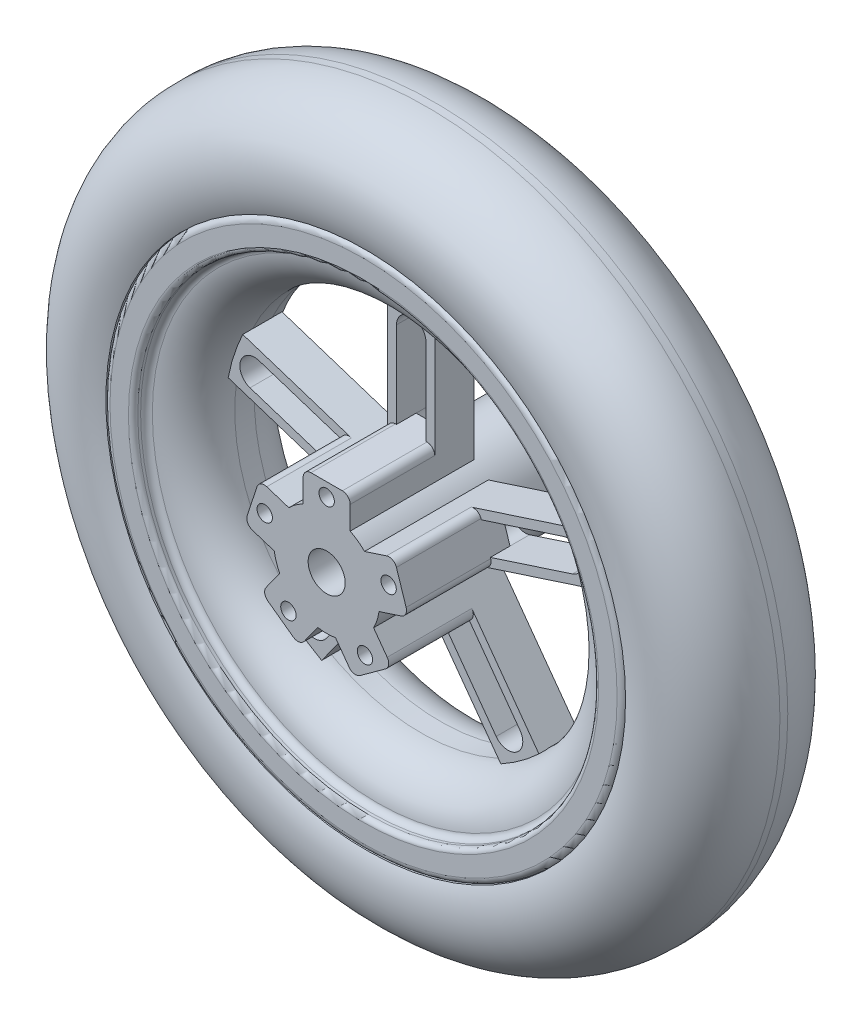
ISO-10303-21;
HEADER;
FILE_DESCRIPTION(('STEP AP214'),'2;1');
FILE_NAME('part.step','',(''),(''),'','','');
FILE_SCHEMA(('AUTOMOTIVE_DESIGN { 1 0 10303 214 1 1 1 1 }'));
ENDSEC;
DATA;
#1=APPLICATION_CONTEXT('core data for automotive mechanical design processes');
#2=APPLICATION_PROTOCOL_DEFINITION('international standard','automotive_design',2000,#1);
#3=PRODUCT_CONTEXT('',#1,'mechanical');
#4=PRODUCT('Part','Part','',(#3));
#5=PRODUCT_RELATED_PRODUCT_CATEGORY('part','',(#4));
#6=PRODUCT_DEFINITION_FORMATION('','',#4);
#7=PRODUCT_DEFINITION_CONTEXT('part definition',#1,'design');
#8=PRODUCT_DEFINITION('design','',#6,#7);
#9=PRODUCT_DEFINITION_SHAPE('','',#8);
#10=(LENGTH_UNIT() NAMED_UNIT(*) SI_UNIT(.MILLI.,.METRE.));
#11=(NAMED_UNIT(*) PLANE_ANGLE_UNIT() SI_UNIT($,.RADIAN.));
#12=(NAMED_UNIT(*) SI_UNIT($,.STERADIAN.) SOLID_ANGLE_UNIT());
#13=UNCERTAINTY_MEASURE_WITH_UNIT(LENGTH_MEASURE(1.E-05),#10,'distance_accuracy_value','');
#14=(GEOMETRIC_REPRESENTATION_CONTEXT(3) GLOBAL_UNCERTAINTY_ASSIGNED_CONTEXT((#13)) GLOBAL_UNIT_ASSIGNED_CONTEXT((#10,
#11,#12)) REPRESENTATION_CONTEXT('',''));
#15=CARTESIAN_POINT('',(0.,0.,0.));
#16=DIRECTION('',(0.,0.,1.));
#17=DIRECTION('',(1.,0.,0.));
#18=AXIS2_PLACEMENT_3D('',#15,#16,#17);
#19=CARTESIAN_POINT('',(0.,0.,33.7312));
#20=DIRECTION('',(0.,0.,-1.));
#21=DIRECTION('',(-1.,0.,0.));
#22=AXIS2_PLACEMENT_3D('',#19,#20,#21);
#23=CYLINDRICAL_SURFACE('',#22,17.145);
#24=CARTESIAN_POINT('',(0.,0.,-32.9692));
#25=DIRECTION('',(0.,0.,1.));
#26=DIRECTION('',(1.,0.,0.));
#27=AXIS2_PLACEMENT_3D('',#24,#25,#26);
#28=CIRCLE('',#27,17.145);
#29=CARTESIAN_POINT('',(17.145,0.,-32.9692));
#30=VERTEX_POINT('',#29);
#31=EDGE_CURVE('E1097',#30,#30,#28,.T.);
#32=ORIENTED_EDGE('',*,*,#31,.T.);
#33=EDGE_LOOP('',(#32));
#34=FACE_BOUND('',#33,.T.);
#35=DIRECTION('',(0.,0.,-1.));
#36=VECTOR('',#35,1.);
#37=CARTESIAN_POINT('',(-12.2521880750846,11.9931193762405,6.35));
#38=LINE('',#37,#36);
#39=CARTESIAN_POINT('',(-12.2521880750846,11.9931193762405,33.7312));
#40=VERTEX_POINT('',#39);
#41=CARTESIAN_POINT('',(-12.2521880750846,11.9931193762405,-6.35));
#42=VERTEX_POINT('',#41);
#43=EDGE_CURVE('E1093',#40,#42,#38,.T.);
#44=ORIENTED_EDGE('',*,*,#43,.F.);
#45=CARTESIAN_POINT('',(0.,0.,33.7312));
#46=DIRECTION('',(0.,0.,1.));
#47=DIRECTION('',(1.,0.,0.));
#48=AXIS2_PLACEMENT_3D('',#45,#46,#47);
#49=CIRCLE('',#48,17.145);
#50=CARTESIAN_POINT('',(-7.62,15.3586010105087,33.7312));
#51=VERTEX_POINT('',#50);
#52=EDGE_CURVE('E540',#51,#40,#49,.T.);
#53=ORIENTED_EDGE('',*,*,#52,.F.);
#54=DIRECTION('',(0.,0.,-1.));
#55=VECTOR('',#54,1.);
#56=CARTESIAN_POINT('',(-7.62,15.3586010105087,6.35));
#57=LINE('',#56,#55);
#58=CARTESIAN_POINT('',(-7.62,15.3586010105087,-6.35));
#59=VERTEX_POINT('',#58);
#60=EDGE_CURVE('E1039',#51,#59,#57,.T.);
#61=ORIENTED_EDGE('',*,*,#60,.T.);
#62=CARTESIAN_POINT('',(0.,0.,-6.35));
#63=DIRECTION('',(0.,0.,-1.));
#64=DIRECTION('',(1.,0.,0.));
#65=AXIS2_PLACEMENT_3D('',#62,#63,#64);
#66=CIRCLE('',#65,17.145);
#67=CARTESIAN_POINT('',(7.62,15.3586010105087,-6.35));
#68=VERTEX_POINT('',#67);
#69=EDGE_CURVE('E1031',#59,#68,#66,.T.);
#70=ORIENTED_EDGE('',*,*,#69,.T.);
#71=DIRECTION('',(0.,0.,-1.));
#72=VECTOR('',#71,1.);
#73=CARTESIAN_POINT('',(7.62,15.3586010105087,6.35));
#74=LINE('',#73,#72);
#75=CARTESIAN_POINT('',(7.62,15.3586010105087,33.7312));
#76=VERTEX_POINT('',#75);
#77=EDGE_CURVE('E1037',#76,#68,#74,.T.);
#78=ORIENTED_EDGE('',*,*,#77,.F.);
#79=CARTESIAN_POINT('',(12.2521880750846,11.9931193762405,33.7312));
#80=VERTEX_POINT('',#79);
#81=EDGE_CURVE('E545',#80,#76,#49,.T.);
#82=ORIENTED_EDGE('',*,*,#81,.F.);
#83=DIRECTION('',(0.,0.,-1.));
#84=VECTOR('',#83,1.);
#85=CARTESIAN_POINT('',(12.2521880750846,11.9931193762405,6.35));
#86=LINE('',#85,#84);
#87=CARTESIAN_POINT('',(12.2521880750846,11.9931193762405,-6.34999999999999));
#88=VERTEX_POINT('',#87);
#89=EDGE_CURVE('E965',#80,#88,#86,.T.);
#90=ORIENTED_EDGE('',*,*,#89,.T.);
#91=CARTESIAN_POINT('',(0.,0.,-6.35));
#92=DIRECTION('',(0.,0.,-1.));
#93=DIRECTION('',(1.,0.,0.));
#94=AXIS2_PLACEMENT_3D('',#91,#92,#93);
#95=CIRCLE('',#94,17.145);
#96=CARTESIAN_POINT('',(16.9616070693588,-2.50098193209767,-6.35));
#97=VERTEX_POINT('',#96);
#98=EDGE_CURVE('E957',#88,#97,#95,.T.);
#99=ORIENTED_EDGE('',*,*,#98,.T.);
#100=DIRECTION('',(0.,0.,-1.));
#101=VECTOR('',#100,1.);
#102=CARTESIAN_POINT('',(16.9616070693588,-2.50098193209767,6.35));
#103=LINE('',#102,#101);
#104=CARTESIAN_POINT('',(16.9616070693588,-2.50098193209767,33.7312));
#105=VERTEX_POINT('',#104);
#106=EDGE_CURVE('E981',#105,#97,#103,.T.);
#107=ORIENTED_EDGE('',*,*,#106,.F.);
#108=CARTESIAN_POINT('',(15.1922686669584,-7.94644560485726,33.7312));
#109=VERTEX_POINT('',#108);
#110=EDGE_CURVE('E546',#109,#105,#49,.T.);
#111=ORIENTED_EDGE('',*,*,#110,.F.);
#112=DIRECTION('',(0.,0.,-1.));
#113=VECTOR('',#112,1.);
#114=CARTESIAN_POINT('',(15.1922686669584,-7.94644560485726,6.35));
#115=LINE('',#114,#113);
#116=CARTESIAN_POINT('',(15.1922686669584,-7.94644560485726,-6.34999999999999));
#117=VERTEX_POINT('',#116);
#118=EDGE_CURVE('E905',#109,#117,#115,.T.);
#119=ORIENTED_EDGE('',*,*,#118,.T.);
#120=CARTESIAN_POINT('',(0.,0.,-6.35));
#121=DIRECTION('',(0.,0.,-1.));
#122=DIRECTION('',(1.,0.,0.));
#123=AXIS2_PLACEMENT_3D('',#120,#121,#122);
#124=CIRCLE('',#123,17.145);
#125=CARTESIAN_POINT('',(2.86284967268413,-16.9042928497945,-6.35));
#126=VERTEX_POINT('',#125);
#127=EDGE_CURVE('E897',#117,#126,#124,.T.);
#128=ORIENTED_EDGE('',*,*,#127,.T.);
#129=DIRECTION('',(0.,0.,-1.));
#130=VECTOR('',#129,1.);
#131=CARTESIAN_POINT('',(2.86284967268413,-16.9042928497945,6.35));
#132=LINE('',#131,#130);
#133=CARTESIAN_POINT('',(2.86284967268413,-16.9042928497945,33.7312));
#134=VERTEX_POINT('',#133);
#135=EDGE_CURVE('E921',#134,#126,#132,.T.);
#136=ORIENTED_EDGE('',*,*,#135,.F.);
#137=CARTESIAN_POINT('',(-2.86284967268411,-16.9042928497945,33.7312));
#138=VERTEX_POINT('',#137);
#139=EDGE_CURVE('E541',#138,#134,#49,.T.);
#140=ORIENTED_EDGE('',*,*,#139,.F.);
#141=DIRECTION('',(0.,0.,-1.));
#142=VECTOR('',#141,1.);
#143=CARTESIAN_POINT('',(-2.86284967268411,-16.9042928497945,6.35));
#144=LINE('',#143,#142);
#145=CARTESIAN_POINT('',(-2.86284967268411,-16.9042928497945,-6.34999999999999));
#146=VERTEX_POINT('',#145);
#147=EDGE_CURVE('E845',#138,#146,#144,.T.);
#148=ORIENTED_EDGE('',*,*,#147,.T.);
#149=CARTESIAN_POINT('',(0.,0.,-6.35));
#150=DIRECTION('',(0.,0.,-1.));
#151=DIRECTION('',(1.,0.,0.));
#152=AXIS2_PLACEMENT_3D('',#149,#150,#151);
#153=CIRCLE('',#152,17.145);
#154=CARTESIAN_POINT('',(-15.1922686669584,-7.94644560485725,-6.35));
#155=VERTEX_POINT('',#154);
#156=EDGE_CURVE('E837',#146,#155,#153,.T.);
#157=ORIENTED_EDGE('',*,*,#156,.T.);
#158=DIRECTION('',(0.,0.,-1.));
#159=VECTOR('',#158,1.);
#160=CARTESIAN_POINT('',(-15.1922686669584,-7.94644560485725,6.35));
#161=LINE('',#160,#159);
#162=CARTESIAN_POINT('',(-15.1922686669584,-7.94644560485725,33.7312));
#163=VERTEX_POINT('',#162);
#164=EDGE_CURVE('E538',#163,#155,#161,.T.);
#165=ORIENTED_EDGE('',*,*,#164,.F.);
#166=CARTESIAN_POINT('',(-16.9616070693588,-2.50098193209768,33.7312));
#167=VERTEX_POINT('',#166);
#168=EDGE_CURVE('E514',#167,#163,#49,.T.);
#169=ORIENTED_EDGE('',*,*,#168,.F.);
#170=DIRECTION('',(0.,0.,-1.));
#171=VECTOR('',#170,1.);
#172=CARTESIAN_POINT('',(-16.9616070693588,-2.50098193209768,6.35));
#173=LINE('',#172,#171);
#174=CARTESIAN_POINT('',(-16.9616070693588,-2.50098193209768,-6.34999999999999));
#175=VERTEX_POINT('',#174);
#176=EDGE_CURVE('E526',#167,#175,#173,.T.);
#177=ORIENTED_EDGE('',*,*,#176,.T.);
#178=CARTESIAN_POINT('',(0.,0.,-6.35));
#179=DIRECTION('',(0.,0.,-1.));
#180=DIRECTION('',(1.,0.,0.));
#181=AXIS2_PLACEMENT_3D('',#178,#179,#180);
#182=CIRCLE('',#181,17.145);
#183=EDGE_CURVE('E1078',#175,#42,#182,.T.);
#184=ORIENTED_EDGE('',*,*,#183,.T.);
#185=EDGE_LOOP('',(#44,#53,#61,#70,#78,#82,#90,#99,#107,#111,#119,#128,#136,#140,#148,#157,#165,
#169,#177,#184));
#186=FACE_BOUND('',#185,.T.);
#187=ADVANCED_FACE('F43',(#34,#186),#23,.T.);
#188=CARTESIAN_POINT('',(0.,0.,6.35));
#189=DIRECTION('',(0.,0.,1.));
#190=DIRECTION('',(1.,0.,0.));
#191=AXIS2_PLACEMENT_3D('',#188,#189,#190);
#192=PLANE('',#191);
#193=DIRECTION('',(0.951056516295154,-0.309016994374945,0.));
#194=VECTOR('',#193,1.);
#195=CARTESIAN_POINT('',(-16.9616070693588,-2.50098193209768,6.35));
#196=LINE('',#195,#194);
#197=CARTESIAN_POINT('',(-59.2676449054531,11.2450830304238,6.35));
#198=VERTEX_POINT('',#197);
#199=CARTESIAN_POINT('',(-24.0958614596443,-0.182922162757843,6.35));
#200=VERTEX_POINT('',#199);
#201=EDGE_CURVE('E535',#198,#200,#196,.T.);
#202=ORIENTED_EDGE('',*,*,#201,.T.);
#203=CARTESIAN_POINT('',(-23.3109582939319,2.23276138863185,6.35));
#204=DIRECTION('',(0.,0.,1.));
#205=DIRECTION('',(1.,0.,0.));
#206=AXIS2_PLACEMENT_3D('',#203,#204,#205);
#207=CIRCLE('',#206,2.54);
#208=CARTESIAN_POINT('',(-25.7266418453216,3.01766455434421,6.35));
#209=VERTEX_POINT('',#208);
#210=EDGE_CURVE('E661',#200,#209,#207,.F.);
#211=ORIENTED_EDGE('',*,*,#210,.T.);
#212=DIRECTION('',(0.309016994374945,0.951056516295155,0.));
#213=VECTOR('',#212,1.);
#214=CARTESIAN_POINT('',(-24.1568355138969,7.84903165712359,6.35));
#215=LINE('',#214,#213);
#216=CARTESIAN_POINT('',(-25.6285289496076,3.31962499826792,6.35));
#217=VERTEX_POINT('',#216);
#218=EDGE_CURVE('E698',#209,#217,#215,.T.);
#219=ORIENTED_EDGE('',*,*,#218,.T.);
#220=DIRECTION('',(0.951056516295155,-0.309016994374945,0.));
#221=VECTOR('',#220,1.);
#222=CARTESIAN_POINT('',(-25.6285289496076,3.31962499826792,6.35));
#223=LINE('',#222,#221);
#224=CARTESIAN_POINT('',(-52.2010480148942,11.9535598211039,6.35));
#225=VERTEX_POINT('',#224);
#226=EDGE_CURVE('E1054',#225,#217,#223,.T.);
#227=ORIENTED_EDGE('',*,*,#226,.F.);
#228=CARTESIAN_POINT('',(-50.7293545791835,16.4829664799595,6.35));
#229=DIRECTION('',(0.,0.,1.));
#230=DIRECTION('',(1.,0.,0.));
#231=AXIS2_PLACEMENT_3D('',#228,#229,#230);
#232=CIRCLE('',#231,4.7625);
#233=CARTESIAN_POINT('',(-49.2576611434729,21.0123731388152,6.35));
#234=VERTEX_POINT('',#233);
#235=EDGE_CURVE('E1051',#234,#225,#232,.T.);
#236=ORIENTED_EDGE('',*,*,#235,.F.);
#237=DIRECTION('',(-0.951056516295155,0.309016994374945,0.));
#238=VECTOR('',#237,1.);
#239=CARTESIAN_POINT('',(-22.6851420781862,12.3784383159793,6.35));
#240=LINE('',#239,#238);
#241=CARTESIAN_POINT('',(-22.6851420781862,12.3784383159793,6.35));
#242=VERTEX_POINT('',#241);
#243=EDGE_CURVE('E1048',#242,#234,#240,.T.);
#244=ORIENTED_EDGE('',*,*,#243,.F.);
#245=CARTESIAN_POINT('',(-22.5870291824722,12.680398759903,6.35));
#246=VERTEX_POINT('',#245);
#247=EDGE_CURVE('E672',#242,#246,#215,.T.);
#248=ORIENTED_EDGE('',*,*,#247,.T.);
#249=CARTESIAN_POINT('',(-20.1713456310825,11.8954955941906,6.35));
#250=DIRECTION('',(0.,0.,1.));
#251=DIRECTION('',(1.,0.,0.));
#252=AXIS2_PLACEMENT_3D('',#249,#250,#251);
#253=CIRCLE('',#252,2.54);
#254=CARTESIAN_POINT('',(-19.3864424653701,14.3111791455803,6.35));
#255=VERTEX_POINT('',#254);
#256=EDGE_CURVE('E663',#246,#255,#253,.F.);
#257=ORIENTED_EDGE('',*,*,#256,.T.);
#258=DIRECTION('',(-0.951056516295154,0.309016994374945,0.));
#259=VECTOR('',#258,1.);
#260=CARTESIAN_POINT('',(-12.2521880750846,11.9931193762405,6.35));
#261=LINE('',#260,#259);
#262=CARTESIAN_POINT('',(-54.5582259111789,25.7391843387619,6.35));
#263=VERTEX_POINT('',#262);
#264=EDGE_CURVE('E669',#255,#263,#261,.T.);
#265=ORIENTED_EDGE('',*,*,#264,.T.);
#266=CARTESIAN_POINT('',(0.,0.,6.35));
#267=DIRECTION('',(0.,0.,1.));
#268=DIRECTION('',(1.,0.,0.));
#269=AXIS2_PLACEMENT_3D('',#266,#267,#268);
#270=CIRCLE('',#269,60.325);
#271=EDGE_CURVE('E1080',#263,#198,#270,.T.);
#272=ORIENTED_EDGE('',*,*,#271,.T.);
#273=EDGE_LOOP('',(#202,#211,#219,#227,#236,#244,#248,#257,#265,#272));
#274=FACE_BOUND('',#273,.T.);
#275=ADVANCED_FACE('F668',(#274),#192,.T.);
#276=CARTESIAN_POINT('',(-24.1568355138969,7.84903165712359,6.35));
#277=DIRECTION('',(0.,0.,-1.));
#278=DIRECTION('',(-1.,0.,0.));
#279=AXIS2_PLACEMENT_3D('',#276,#277,#278);
#280=CYLINDRICAL_SURFACE('',#279,4.7625);
#281=DIRECTION('',(0.,0.,-1.));
#282=VECTOR('',#281,1.);
#283=CARTESIAN_POINT('',(-25.6285289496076,3.31962499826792,6.35));
#284=LINE('',#283,#282);
#285=CARTESIAN_POINT('',(-25.6285289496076,3.31962499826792,0.));
#286=VERTEX_POINT('',#285);
#287=CARTESIAN_POINT('',(-25.6285289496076,3.31962499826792,-6.35));
#288=VERTEX_POINT('',#287);
#289=EDGE_CURVE('E1057',#286,#288,#284,.T.);
#290=ORIENTED_EDGE('',*,*,#289,.F.);
#291=CARTESIAN_POINT('',(-24.1568355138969,7.84903165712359,0.));
#292=DIRECTION('',(0.,0.,1.));
#293=DIRECTION('',(1.,0.,0.));
#294=AXIS2_PLACEMENT_3D('',#291,#292,#293);
#295=CIRCLE('',#294,4.7625);
#296=CARTESIAN_POINT('',(-21.0533422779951,4.23658982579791,0.));
#297=VERTEX_POINT('',#296);
#298=EDGE_CURVE('E693',#286,#297,#295,.T.);
#299=ORIENTED_EDGE('',*,*,#298,.T.);
#300=DIRECTION('',(0.,0.,-1.));
#301=VECTOR('',#300,1.);
#302=CARTESIAN_POINT('',(-21.0533422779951,4.23658982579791,16.8656));
#303=LINE('',#302,#301);
#304=CARTESIAN_POINT('',(-21.0533422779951,4.23658982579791,6.35));
#305=VERTEX_POINT('',#304);
#306=EDGE_CURVE('E576',#305,#297,#303,.T.);
#307=ORIENTED_EDGE('',*,*,#306,.F.);
#308=CARTESIAN_POINT('',(-24.1568355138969,7.84903165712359,6.35));
#309=DIRECTION('',(0.,0.,1.));
#310=DIRECTION('',(1.,0.,0.));
#311=AXIS2_PLACEMENT_3D('',#308,#309,#310);
#312=CIRCLE('',#311,4.7625);
#313=CARTESIAN_POINT('',(-19.522716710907,8.94737093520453,6.35));
#314=VERTEX_POINT('',#313);
#315=EDGE_CURVE('E1045',#305,#314,#312,.T.);
#316=ORIENTED_EDGE('',*,*,#315,.T.);
#317=DIRECTION('',(0.,0.,-1.));
#318=VECTOR('',#317,1.);
#319=CARTESIAN_POINT('',(-19.522716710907,8.94737093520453,16.8656));
#320=LINE('',#319,#318);
#321=CARTESIAN_POINT('',(-19.522716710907,8.94737093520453,0.));
#322=VERTEX_POINT('',#321);
#323=EDGE_CURVE('E574',#322,#314,#320,.F.);
#324=ORIENTED_EDGE('',*,*,#323,.F.);
#325=CARTESIAN_POINT('',(-22.6851420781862,12.3784383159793,0.));
#326=VERTEX_POINT('',#325);
#327=EDGE_CURVE('E697',#322,#326,#295,.T.);
#328=ORIENTED_EDGE('',*,*,#327,.T.);
#329=DIRECTION('',(0.,0.,-1.));
#330=VECTOR('',#329,1.);
#331=CARTESIAN_POINT('',(-22.6851420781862,12.3784383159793,6.35));
#332=LINE('',#331,#330);
#333=CARTESIAN_POINT('',(-22.6851420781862,12.3784383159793,-6.35));
#334=VERTEX_POINT('',#333);
#335=EDGE_CURVE('E1075',#326,#334,#332,.T.);
#336=ORIENTED_EDGE('',*,*,#335,.T.);
#337=CARTESIAN_POINT('',(-24.1568355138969,7.84903165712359,-6.35));
#338=DIRECTION('',(0.,0.,1.));
#339=DIRECTION('',(1.,0.,0.));
#340=AXIS2_PLACEMENT_3D('',#337,#338,#339);
#341=CIRCLE('',#340,4.7625);
#342=EDGE_CURVE('E1044',#288,#334,#341,.T.);
#343=ORIENTED_EDGE('',*,*,#342,.F.);
#344=EDGE_LOOP('',(#290,#299,#307,#316,#324,#328,#336,#343));
#345=FACE_BOUND('',#344,.T.);
#346=ADVANCED_FACE('F1207',(#345),#280,.F.);
#347=CARTESIAN_POINT('',(0.,0.,6.35));
#348=DIRECTION('',(0.,0.,1.));
#349=DIRECTION('',(1.,0.,0.));
#350=AXIS2_PLACEMENT_3D('',#347,#348,#349);
#351=PLANE('',#350);
#352=DIRECTION('',(0.587785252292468,0.809016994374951,0.));
#353=VECTOR('',#352,1.);
#354=CARTESIAN_POINT('',(-2.86284967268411,-16.9042928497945,6.35));
#355=LINE('',#354,#353);
#356=CARTESIAN_POINT('',(-29.0094189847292,-52.8919581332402,6.35));
#357=VERTEX_POINT('',#356);
#358=CARTESIAN_POINT('',(-7.27206137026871,-22.97305211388,6.35));
#359=VERTEX_POINT('',#358);
#360=EDGE_CURVE('E843',#357,#359,#355,.T.);
#361=ORIENTED_EDGE('',*,*,#360,.T.);
#362=CARTESIAN_POINT('',(-9.32696453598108,-21.4800775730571,6.35));
#363=DIRECTION('',(0.,0.,1.));
#364=DIRECTION('',(1.,0.,0.));
#365=AXIS2_PLACEMENT_3D('',#362,#363,#364);
#366=CIRCLE('',#365,2.54);
#367=CARTESIAN_POINT('',(-10.819939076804,-23.5349807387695,6.35));
#368=VERTEX_POINT('',#367);
#369=EDGE_CURVE('E656',#359,#368,#366,.F.);
#370=ORIENTED_EDGE('',*,*,#369,.T.);
#371=DIRECTION('',(-0.809016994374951,0.587785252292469,0.));
#372=VECTOR('',#371,1.);
#373=CARTESIAN_POINT('',(-14.9297454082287,-20.5490316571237,6.35));
#374=LINE('',#373,#372);
#375=CARTESIAN_POINT('',(-11.076801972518,-23.3483589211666,6.35));
#376=VERTEX_POINT('',#375);
#377=EDGE_CURVE('E724',#368,#376,#374,.T.);
#378=ORIENTED_EDGE('',*,*,#377,.T.);
#379=DIRECTION('',(0.587785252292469,0.809016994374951,0.));
#380=VECTOR('',#379,1.);
#381=CARTESIAN_POINT('',(-27.4995219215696,-45.9522937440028,6.35));
#382=LINE('',#381,#380);
#383=CARTESIAN_POINT('',(-27.4995219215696,-45.9522937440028,6.35));
#384=VERTEX_POINT('',#383);
#385=EDGE_CURVE('E804',#384,#376,#382,.T.);
#386=ORIENTED_EDGE('',*,*,#385,.F.);
#387=CARTESIAN_POINT('',(-31.3524653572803,-43.1529664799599,6.35));
#388=DIRECTION('',(0.,0.,1.));
#389=DIRECTION('',(1.,0.,0.));
#390=AXIS2_PLACEMENT_3D('',#387,#388,#389);
#391=CIRCLE('',#390,4.76249999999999);
#392=CARTESIAN_POINT('',(-35.205408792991,-40.353639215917,6.35));
#393=VERTEX_POINT('',#392);
#394=EDGE_CURVE('E802',#393,#384,#391,.T.);
#395=ORIENTED_EDGE('',*,*,#394,.F.);
#396=DIRECTION('',(-0.587785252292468,-0.809016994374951,0.));
#397=VECTOR('',#396,1.);
#398=CARTESIAN_POINT('',(-35.205408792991,-40.353639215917,6.35));
#399=LINE('',#398,#397);
#400=CARTESIAN_POINT('',(-18.7826888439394,-17.7497043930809,6.35));
#401=VERTEX_POINT('',#400);
#402=EDGE_CURVE('E811',#401,#393,#399,.T.);
#403=ORIENTED_EDGE('',*,*,#402,.F.);
#404=CARTESIAN_POINT('',(-19.0395517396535,-17.563082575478,6.35));
#405=VERTEX_POINT('',#404);
#406=EDGE_CURVE('E721',#401,#405,#374,.T.);
#407=ORIENTED_EDGE('',*,*,#406,.T.);
#408=CARTESIAN_POINT('',(-17.5465771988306,-15.5081794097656,6.35));
#409=DIRECTION('',(0.,0.,1.));
#410=DIRECTION('',(1.,0.,0.));
#411=AXIS2_PLACEMENT_3D('',#408,#409,#410);
#412=CIRCLE('',#411,2.54);
#413=CARTESIAN_POINT('',(-19.601480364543,-14.0152048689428,6.35));
#414=VERTEX_POINT('',#413);
#415=EDGE_CURVE('E658',#405,#414,#412,.F.);
#416=ORIENTED_EDGE('',*,*,#415,.T.);
#417=DIRECTION('',(-0.587785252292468,-0.809016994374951,0.));
#418=VECTOR('',#417,1.);
#419=CARTESIAN_POINT('',(-15.1922686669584,-7.94644560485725,6.35));
#420=LINE('',#419,#418);
#421=CARTESIAN_POINT('',(-41.3388379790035,-43.934110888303,6.35));
#422=VERTEX_POINT('',#421);
#423=EDGE_CURVE('E838',#414,#422,#420,.T.);
#424=ORIENTED_EDGE('',*,*,#423,.T.);
#425=CARTESIAN_POINT('',(0.,0.,6.35));
#426=DIRECTION('',(0.,0.,1.));
#427=DIRECTION('',(1.,0.,0.));
#428=AXIS2_PLACEMENT_3D('',#425,#426,#427);
#429=CIRCLE('',#428,60.325);
#430=EDGE_CURVE('E840',#422,#357,#429,.T.);
#431=ORIENTED_EDGE('',*,*,#430,.T.);
#432=EDGE_LOOP('',(#361,#370,#378,#386,#395,#403,#407,#416,#424,#431));
#433=FACE_BOUND('',#432,.T.);
#434=ADVANCED_FACE('F1407',(#433),#351,.T.);
#435=CARTESIAN_POINT('',(-14.9297454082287,-20.5490316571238,6.35));
#436=DIRECTION('',(0.,0.,-1.));
#437=DIRECTION('',(-1.,0.,0.));
#438=AXIS2_PLACEMENT_3D('',#435,#436,#437);
#439=CYLINDRICAL_SURFACE('',#438,4.7625);
#440=DIRECTION('',(0.,0.,-1.));
#441=VECTOR('',#440,1.);
#442=CARTESIAN_POINT('',(-11.076801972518,-23.3483589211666,6.35));
#443=LINE('',#442,#441);
#444=CARTESIAN_POINT('',(-11.076801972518,-23.3483589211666,0.));
#445=VERTEX_POINT('',#444);
#446=CARTESIAN_POINT('',(-11.076801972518,-23.3483589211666,-6.35));
#447=VERTEX_POINT('',#446);
#448=EDGE_CURVE('E830',#445,#447,#443,.T.);
#449=ORIENTED_EDGE('',*,*,#448,.F.);
#450=CARTESIAN_POINT('',(-14.9297454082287,-20.5490316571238,0.));
#451=DIRECTION('',(0.,0.,1.));
#452=DIRECTION('',(1.,0.,0.));
#453=AXIS2_PLACEMENT_3D('',#450,#451,#452);
#454=CIRCLE('',#453,4.7625);
#455=CARTESIAN_POINT('',(-10.5350769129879,-18.713740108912,0.));
#456=VERTEX_POINT('',#455);
#457=EDGE_CURVE('E716',#445,#456,#454,.T.);
#458=ORIENTED_EDGE('',*,*,#457,.T.);
#459=DIRECTION('',(0.,0.,-1.));
#460=VECTOR('',#459,1.);
#461=CARTESIAN_POINT('',(-10.5350769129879,-18.713740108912,16.8656));
#462=LINE('',#461,#460);
#463=CARTESIAN_POINT('',(-10.5350769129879,-18.713740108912,6.35));
#464=VERTEX_POINT('',#463);
#465=EDGE_CURVE('E571',#464,#456,#462,.T.);
#466=ORIENTED_EDGE('',*,*,#465,.F.);
#467=CARTESIAN_POINT('',(-14.9297454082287,-20.5490316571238,6.35));
#468=DIRECTION('',(0.,0.,1.));
#469=DIRECTION('',(1.,0.,0.));
#470=AXIS2_PLACEMENT_3D('',#467,#468,#469);
#471=CIRCLE('',#470,4.7625);
#472=CARTESIAN_POINT('',(-14.5423066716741,-15.8023172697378,6.35));
#473=VERTEX_POINT('',#472);
#474=EDGE_CURVE('E808',#464,#473,#471,.T.);
#475=ORIENTED_EDGE('',*,*,#474,.T.);
#476=DIRECTION('',(0.,0.,-1.));
#477=VECTOR('',#476,1.);
#478=CARTESIAN_POINT('',(-14.5423066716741,-15.8023172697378,16.8656));
#479=LINE('',#478,#477);
#480=CARTESIAN_POINT('',(-14.5423066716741,-15.8023172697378,0.));
#481=VERTEX_POINT('',#480);
#482=EDGE_CURVE('E568',#481,#473,#479,.F.);
#483=ORIENTED_EDGE('',*,*,#482,.F.);
#484=CARTESIAN_POINT('',(-18.7826888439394,-17.7497043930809,0.));
#485=VERTEX_POINT('',#484);
#486=EDGE_CURVE('E720',#481,#485,#454,.T.);
#487=ORIENTED_EDGE('',*,*,#486,.T.);
#488=DIRECTION('',(0.,0.,-1.));
#489=VECTOR('',#488,1.);
#490=CARTESIAN_POINT('',(-18.7826888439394,-17.7497043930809,6.35));
#491=LINE('',#490,#489);
#492=CARTESIAN_POINT('',(-18.7826888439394,-17.7497043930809,-6.35));
#493=VERTEX_POINT('',#492);
#494=EDGE_CURVE('E826',#485,#493,#491,.T.);
#495=ORIENTED_EDGE('',*,*,#494,.T.);
#496=CARTESIAN_POINT('',(-14.9297454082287,-20.5490316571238,-6.35));
#497=DIRECTION('',(0.,0.,1.));
#498=DIRECTION('',(1.,0.,0.));
#499=AXIS2_PLACEMENT_3D('',#496,#497,#498);
#500=CIRCLE('',#499,4.7625);
#501=EDGE_CURVE('E819',#447,#493,#500,.T.);
#502=ORIENTED_EDGE('',*,*,#501,.F.);
#503=EDGE_LOOP('',(#449,#458,#466,#475,#483,#487,#495,#502));
#504=FACE_BOUND('',#503,.T.);
#505=ADVANCED_FACE('F1416',(#504),#439,.F.);
#506=CARTESIAN_POINT('',(0.,0.,6.35));
#507=DIRECTION('',(0.,0.,1.));
#508=DIRECTION('',(1.,0.,0.));
#509=AXIS2_PLACEMENT_3D('',#506,#507,#508);
#510=PLANE('',#509);
#511=DIRECTION('',(-0.587785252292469,0.809016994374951,0.));
#512=VECTOR('',#511,1.);
#513=CARTESIAN_POINT('',(15.1922686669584,-7.94644560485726,6.35));
#514=LINE('',#513,#512);
#515=CARTESIAN_POINT('',(41.3388379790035,-43.934110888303,6.35));
#516=VERTEX_POINT('',#515);
#517=CARTESIAN_POINT('',(19.6014803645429,-14.0152048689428,6.35));
#518=VERTEX_POINT('',#517);
#519=EDGE_CURVE('E903',#516,#518,#514,.T.);
#520=ORIENTED_EDGE('',*,*,#519,.T.);
#521=CARTESIAN_POINT('',(17.5465771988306,-15.5081794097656,6.35));
#522=DIRECTION('',(0.,0.,1.));
#523=DIRECTION('',(1.,0.,0.));
#524=AXIS2_PLACEMENT_3D('',#521,#522,#523);
#525=CIRCLE('',#524,2.54);
#526=CARTESIAN_POINT('',(19.0395517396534,-17.563082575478,6.35));
#527=VERTEX_POINT('',#526);
#528=EDGE_CURVE('E651',#518,#527,#525,.F.);
#529=ORIENTED_EDGE('',*,*,#528,.T.);
#530=DIRECTION('',(-0.809016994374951,-0.587785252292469,0.));
#531=VECTOR('',#530,1.);
#532=CARTESIAN_POINT('',(14.9297454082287,-20.5490316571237,6.35));
#533=LINE('',#532,#531);
#534=CARTESIAN_POINT('',(18.7826888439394,-17.7497043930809,6.35));
#535=VERTEX_POINT('',#534);
#536=EDGE_CURVE('E752',#527,#535,#533,.T.);
#537=ORIENTED_EDGE('',*,*,#536,.T.);
#538=DIRECTION('',(-0.587785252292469,0.809016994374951,0.));
#539=VECTOR('',#538,1.);
#540=CARTESIAN_POINT('',(35.205408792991,-40.353639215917,6.35));
#541=LINE('',#540,#539);
#542=CARTESIAN_POINT('',(35.205408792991,-40.353639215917,6.35));
#543=VERTEX_POINT('',#542);
#544=EDGE_CURVE('E864',#543,#535,#541,.T.);
#545=ORIENTED_EDGE('',*,*,#544,.F.);
#546=CARTESIAN_POINT('',(31.3524653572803,-43.1529664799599,6.35));
#547=DIRECTION('',(0.,0.,1.));
#548=DIRECTION('',(1.,0.,0.));
#549=AXIS2_PLACEMENT_3D('',#546,#547,#548);
#550=CIRCLE('',#549,4.76250000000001);
#551=CARTESIAN_POINT('',(27.4995219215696,-45.9522937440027,6.35));
#552=VERTEX_POINT('',#551);
#553=EDGE_CURVE('E862',#552,#543,#550,.T.);
#554=ORIENTED_EDGE('',*,*,#553,.F.);
#555=DIRECTION('',(0.587785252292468,-0.809016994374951,0.));
#556=VECTOR('',#555,1.);
#557=CARTESIAN_POINT('',(27.4995219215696,-45.9522937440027,6.35));
#558=LINE('',#557,#556);
#559=CARTESIAN_POINT('',(11.076801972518,-23.3483589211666,6.35));
#560=VERTEX_POINT('',#559);
#561=EDGE_CURVE('E871',#560,#552,#558,.T.);
#562=ORIENTED_EDGE('',*,*,#561,.F.);
#563=CARTESIAN_POINT('',(10.819939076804,-23.5349807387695,6.35));
#564=VERTEX_POINT('',#563);
#565=EDGE_CURVE('E749',#560,#564,#533,.T.);
#566=ORIENTED_EDGE('',*,*,#565,.T.);
#567=CARTESIAN_POINT('',(9.32696453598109,-21.4800775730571,6.35));
#568=DIRECTION('',(0.,0.,1.));
#569=DIRECTION('',(1.,0.,0.));
#570=AXIS2_PLACEMENT_3D('',#567,#568,#569);
#571=CIRCLE('',#570,2.54);
#572=CARTESIAN_POINT('',(7.27206137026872,-22.97305211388,6.35));
#573=VERTEX_POINT('',#572);
#574=EDGE_CURVE('E653',#564,#573,#571,.F.);
#575=ORIENTED_EDGE('',*,*,#574,.T.);
#576=DIRECTION('',(0.587785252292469,-0.809016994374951,0.));
#577=VECTOR('',#576,1.);
#578=CARTESIAN_POINT('',(2.86284967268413,-16.9042928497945,6.35));
#579=LINE('',#578,#577);
#580=CARTESIAN_POINT('',(29.0094189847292,-52.8919581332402,6.35));
#581=VERTEX_POINT('',#580);
#582=EDGE_CURVE('E898',#573,#581,#579,.T.);
#583=ORIENTED_EDGE('',*,*,#582,.T.);
#584=CARTESIAN_POINT('',(0.,0.,6.35));
#585=DIRECTION('',(0.,0.,1.));
#586=DIRECTION('',(1.,0.,0.));
#587=AXIS2_PLACEMENT_3D('',#584,#585,#586);
#588=CIRCLE('',#587,60.325);
#589=EDGE_CURVE('E900',#581,#516,#588,.T.);
#590=ORIENTED_EDGE('',*,*,#589,.T.);
#591=EDGE_LOOP('',(#520,#529,#537,#545,#554,#562,#566,#575,#583,#590));
#592=FACE_BOUND('',#591,.T.);
#593=ADVANCED_FACE('F1370',(#592),#510,.T.);
#594=CARTESIAN_POINT('',(14.9297454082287,-20.5490316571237,6.35));
#595=DIRECTION('',(0.,0.,-1.));
#596=DIRECTION('',(-1.,0.,0.));
#597=AXIS2_PLACEMENT_3D('',#594,#595,#596);
#598=CYLINDRICAL_SURFACE('',#597,4.7625);
#599=DIRECTION('',(0.,0.,-1.));
#600=VECTOR('',#599,1.);
#601=CARTESIAN_POINT('',(18.7826888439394,-17.7497043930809,6.35));
#602=LINE('',#601,#600);
#603=CARTESIAN_POINT('',(18.7826888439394,-17.7497043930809,0.));
#604=VERTEX_POINT('',#603);
#605=CARTESIAN_POINT('',(18.7826888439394,-17.7497043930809,-6.35));
#606=VERTEX_POINT('',#605);
#607=EDGE_CURVE('E890',#604,#606,#602,.T.);
#608=ORIENTED_EDGE('',*,*,#607,.F.);
#609=CARTESIAN_POINT('',(14.9297454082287,-20.5490316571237,0.));
#610=DIRECTION('',(0.,0.,1.));
#611=DIRECTION('',(1.,0.,0.));
#612=AXIS2_PLACEMENT_3D('',#609,#610,#611);
#613=CIRCLE('',#612,4.7625);
#614=CARTESIAN_POINT('',(14.5423066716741,-15.8023172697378,0.));
#615=VERTEX_POINT('',#614);
#616=EDGE_CURVE('E748',#604,#615,#613,.T.);
#617=ORIENTED_EDGE('',*,*,#616,.T.);
#618=DIRECTION('',(0.,0.,-1.));
#619=VECTOR('',#618,1.);
#620=CARTESIAN_POINT('',(14.5423066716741,-15.8023172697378,16.8656));
#621=LINE('',#620,#619);
#622=CARTESIAN_POINT('',(14.5423066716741,-15.8023172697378,6.35));
#623=VERTEX_POINT('',#622);
#624=EDGE_CURVE('E565',#623,#615,#621,.T.);
#625=ORIENTED_EDGE('',*,*,#624,.F.);
#626=CARTESIAN_POINT('',(14.9297454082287,-20.5490316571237,6.35));
#627=DIRECTION('',(0.,0.,1.));
#628=DIRECTION('',(1.,0.,0.));
#629=AXIS2_PLACEMENT_3D('',#626,#627,#628);
#630=CIRCLE('',#629,4.7625);
#631=CARTESIAN_POINT('',(10.5350769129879,-18.713740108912,6.35));
#632=VERTEX_POINT('',#631);
#633=EDGE_CURVE('E868',#623,#632,#630,.T.);
#634=ORIENTED_EDGE('',*,*,#633,.T.);
#635=DIRECTION('',(0.,0.,-1.));
#636=VECTOR('',#635,1.);
#637=CARTESIAN_POINT('',(10.5350769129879,-18.713740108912,16.8656));
#638=LINE('',#637,#636);
#639=CARTESIAN_POINT('',(10.5350769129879,-18.713740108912,0.));
#640=VERTEX_POINT('',#639);
#641=EDGE_CURVE('E562',#640,#632,#638,.F.);
#642=ORIENTED_EDGE('',*,*,#641,.F.);
#643=CARTESIAN_POINT('',(11.076801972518,-23.3483589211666,0.));
#644=VERTEX_POINT('',#643);
#645=EDGE_CURVE('E743',#640,#644,#613,.T.);
#646=ORIENTED_EDGE('',*,*,#645,.T.);
#647=DIRECTION('',(0.,0.,-1.));
#648=VECTOR('',#647,1.);
#649=CARTESIAN_POINT('',(11.076801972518,-23.3483589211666,6.35));
#650=LINE('',#649,#648);
#651=CARTESIAN_POINT('',(11.076801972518,-23.3483589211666,-6.35));
#652=VERTEX_POINT('',#651);
#653=EDGE_CURVE('E886',#644,#652,#650,.T.);
#654=ORIENTED_EDGE('',*,*,#653,.T.);
#655=CARTESIAN_POINT('',(14.9297454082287,-20.5490316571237,-6.35));
#656=DIRECTION('',(0.,0.,1.));
#657=DIRECTION('',(1.,0.,0.));
#658=AXIS2_PLACEMENT_3D('',#655,#656,#657);
#659=CIRCLE('',#658,4.7625);
#660=EDGE_CURVE('E879',#606,#652,#659,.T.);
#661=ORIENTED_EDGE('',*,*,#660,.F.);
#662=EDGE_LOOP('',(#608,#617,#625,#634,#642,#646,#654,#661));
#663=FACE_BOUND('',#662,.T.);
#664=ADVANCED_FACE('F1379',(#663),#598,.F.);
#665=CARTESIAN_POINT('',(0.,0.,6.35));
#666=DIRECTION('',(0.,0.,1.));
#667=DIRECTION('',(1.,0.,0.));
#668=AXIS2_PLACEMENT_3D('',#665,#666,#667);
#669=PLANE('',#668);
#670=DIRECTION('',(-0.951056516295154,-0.309016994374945,0.));
#671=VECTOR('',#670,1.);
#672=CARTESIAN_POINT('',(12.2521880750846,11.9931193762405,6.35));
#673=LINE('',#672,#671);
#674=CARTESIAN_POINT('',(54.5582259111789,25.7391843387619,6.35));
#675=VERTEX_POINT('',#674);
#676=CARTESIAN_POINT('',(19.3864424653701,14.3111791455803,6.35));
#677=VERTEX_POINT('',#676);
#678=EDGE_CURVE('E963',#675,#677,#673,.T.);
#679=ORIENTED_EDGE('',*,*,#678,.T.);
#680=CARTESIAN_POINT('',(20.1713456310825,11.8954955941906,6.35));
#681=DIRECTION('',(0.,0.,1.));
#682=DIRECTION('',(1.,0.,0.));
#683=AXIS2_PLACEMENT_3D('',#680,#681,#682);
#684=CIRCLE('',#683,2.54);
#685=CARTESIAN_POINT('',(22.5870291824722,12.680398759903,6.35));
#686=VERTEX_POINT('',#685);
#687=EDGE_CURVE('E646',#677,#686,#684,.F.);
#688=ORIENTED_EDGE('',*,*,#687,.T.);
#689=DIRECTION('',(0.309016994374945,-0.951056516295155,0.));
#690=VECTOR('',#689,1.);
#691=CARTESIAN_POINT('',(24.1568355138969,7.8490316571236,6.35));
#692=LINE('',#691,#690);
#693=CARTESIAN_POINT('',(22.6851420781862,12.3784383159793,6.35));
#694=VERTEX_POINT('',#693);
#695=EDGE_CURVE('E775',#686,#694,#692,.T.);
#696=ORIENTED_EDGE('',*,*,#695,.T.);
#697=DIRECTION('',(-0.951056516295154,-0.309016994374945,0.));
#698=VECTOR('',#697,1.);
#699=CARTESIAN_POINT('',(22.6851420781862,12.3784383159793,6.35));
#700=LINE('',#699,#698);
#701=CARTESIAN_POINT('',(49.2576611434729,21.0123731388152,6.35));
#702=VERTEX_POINT('',#701);
#703=EDGE_CURVE('E933',#702,#694,#700,.T.);
#704=ORIENTED_EDGE('',*,*,#703,.F.);
#705=CARTESIAN_POINT('',(50.7293545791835,16.4829664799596,6.35));
#706=DIRECTION('',(0.,0.,1.));
#707=DIRECTION('',(1.,0.,0.));
#708=AXIS2_PLACEMENT_3D('',#705,#706,#707);
#709=CIRCLE('',#708,4.7625);
#710=CARTESIAN_POINT('',(52.2010480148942,11.9535598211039,6.35));
#711=VERTEX_POINT('',#710);
#712=EDGE_CURVE('E930',#711,#702,#709,.T.);
#713=ORIENTED_EDGE('',*,*,#712,.F.);
#714=DIRECTION('',(0.951056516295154,0.309016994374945,0.));
#715=VECTOR('',#714,1.);
#716=CARTESIAN_POINT('',(25.6285289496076,3.31962499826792,6.35));
#717=LINE('',#716,#715);
#718=CARTESIAN_POINT('',(25.6285289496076,3.31962499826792,6.35));
#719=VERTEX_POINT('',#718);
#720=EDGE_CURVE('E927',#719,#711,#717,.T.);
#721=ORIENTED_EDGE('',*,*,#720,.F.);
#722=CARTESIAN_POINT('',(25.7266418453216,3.01766455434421,6.35));
#723=VERTEX_POINT('',#722);
#724=EDGE_CURVE('E777',#719,#723,#692,.T.);
#725=ORIENTED_EDGE('',*,*,#724,.T.);
#726=CARTESIAN_POINT('',(23.3109582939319,2.23276138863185,6.35));
#727=DIRECTION('',(0.,0.,1.));
#728=DIRECTION('',(1.,0.,0.));
#729=AXIS2_PLACEMENT_3D('',#726,#727,#728);
#730=CIRCLE('',#729,2.54);
#731=CARTESIAN_POINT('',(24.0958614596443,-0.182922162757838,6.35));
#732=VERTEX_POINT('',#731);
#733=EDGE_CURVE('E648',#723,#732,#730,.F.);
#734=ORIENTED_EDGE('',*,*,#733,.T.);
#735=DIRECTION('',(0.951056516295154,0.309016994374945,0.));
#736=VECTOR('',#735,1.);
#737=CARTESIAN_POINT('',(16.9616070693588,-2.50098193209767,6.35));
#738=LINE('',#737,#736);
#739=CARTESIAN_POINT('',(59.2676449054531,11.2450830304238,6.35));
#740=VERTEX_POINT('',#739);
#741=EDGE_CURVE('E958',#732,#740,#738,.T.);
#742=ORIENTED_EDGE('',*,*,#741,.T.);
#743=CARTESIAN_POINT('',(0.,0.,6.35));
#744=DIRECTION('',(0.,0.,1.));
#745=DIRECTION('',(1.,0.,0.));
#746=AXIS2_PLACEMENT_3D('',#743,#744,#745);
#747=CIRCLE('',#746,60.325);
#748=EDGE_CURVE('E960',#740,#675,#747,.T.);
#749=ORIENTED_EDGE('',*,*,#748,.T.);
#750=EDGE_LOOP('',(#679,#688,#696,#704,#713,#721,#725,#734,#742,#749));
#751=FACE_BOUND('',#750,.T.);
#752=ADVANCED_FACE('F1334',(#751),#669,.T.);
#753=CARTESIAN_POINT('',(24.1568355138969,7.8490316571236,6.35));
#754=DIRECTION('',(0.,0.,-1.));
#755=DIRECTION('',(-1.,0.,0.));
#756=AXIS2_PLACEMENT_3D('',#753,#754,#755);
#757=CYLINDRICAL_SURFACE('',#756,4.7625);
#758=DIRECTION('',(0.,0.,-1.));
#759=VECTOR('',#758,1.);
#760=CARTESIAN_POINT('',(22.6851420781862,12.3784383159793,6.35));
#761=LINE('',#760,#759);
#762=CARTESIAN_POINT('',(22.6851420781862,12.3784383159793,0.));
#763=VERTEX_POINT('',#762);
#764=CARTESIAN_POINT('',(22.6851420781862,12.3784383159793,-6.35));
#765=VERTEX_POINT('',#764);
#766=EDGE_CURVE('E936',#763,#765,#761,.T.);
#767=ORIENTED_EDGE('',*,*,#766,.F.);
#768=CARTESIAN_POINT('',(24.1568355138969,7.8490316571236,0.));
#769=DIRECTION('',(0.,0.,1.));
#770=DIRECTION('',(1.,0.,0.));
#771=AXIS2_PLACEMENT_3D('',#768,#769,#770);
#772=CIRCLE('',#771,4.7625);
#773=CARTESIAN_POINT('',(19.522716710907,8.94737093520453,0.));
#774=VERTEX_POINT('',#773);
#775=EDGE_CURVE('E774',#763,#774,#772,.T.);
#776=ORIENTED_EDGE('',*,*,#775,.T.);
#777=DIRECTION('',(0.,0.,-1.));
#778=VECTOR('',#777,1.);
#779=CARTESIAN_POINT('',(19.522716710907,8.94737093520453,16.8656));
#780=LINE('',#779,#778);
#781=CARTESIAN_POINT('',(19.522716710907,8.94737093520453,6.35));
#782=VERTEX_POINT('',#781);
#783=EDGE_CURVE('E560',#782,#774,#780,.T.);
#784=ORIENTED_EDGE('',*,*,#783,.F.);
#785=CARTESIAN_POINT('',(24.1568355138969,7.8490316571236,6.35));
#786=DIRECTION('',(0.,0.,1.));
#787=DIRECTION('',(1.,0.,0.));
#788=AXIS2_PLACEMENT_3D('',#785,#786,#787);
#789=CIRCLE('',#788,4.7625);
#790=CARTESIAN_POINT('',(21.0533422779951,4.23658982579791,6.35));
#791=VERTEX_POINT('',#790);
#792=EDGE_CURVE('E924',#782,#791,#789,.T.);
#793=ORIENTED_EDGE('',*,*,#792,.T.);
#794=DIRECTION('',(0.,0.,-1.));
#795=VECTOR('',#794,1.);
#796=CARTESIAN_POINT('',(21.0533422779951,4.23658982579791,16.8656));
#797=LINE('',#796,#795);
#798=CARTESIAN_POINT('',(21.0533422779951,4.23658982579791,0.));
#799=VERTEX_POINT('',#798);
#800=EDGE_CURVE('E558',#799,#791,#797,.F.);
#801=ORIENTED_EDGE('',*,*,#800,.F.);
#802=CARTESIAN_POINT('',(25.6285289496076,3.31962499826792,0.));
#803=VERTEX_POINT('',#802);
#804=EDGE_CURVE('E769',#799,#803,#772,.T.);
#805=ORIENTED_EDGE('',*,*,#804,.T.);
#806=DIRECTION('',(0.,0.,-1.));
#807=VECTOR('',#806,1.);
#808=CARTESIAN_POINT('',(25.6285289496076,3.31962499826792,6.35));
#809=LINE('',#808,#807);
#810=CARTESIAN_POINT('',(25.6285289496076,3.31962499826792,-6.35));
#811=VERTEX_POINT('',#810);
#812=EDGE_CURVE('E954',#803,#811,#809,.T.);
#813=ORIENTED_EDGE('',*,*,#812,.T.);
#814=CARTESIAN_POINT('',(24.1568355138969,7.8490316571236,-6.35));
#815=DIRECTION('',(0.,0.,1.));
#816=DIRECTION('',(1.,0.,0.));
#817=AXIS2_PLACEMENT_3D('',#814,#815,#816);
#818=CIRCLE('',#817,4.7625);
#819=EDGE_CURVE('E923',#765,#811,#818,.T.);
#820=ORIENTED_EDGE('',*,*,#819,.F.);
#821=EDGE_LOOP('',(#767,#776,#784,#793,#801,#805,#813,#820));
#822=FACE_BOUND('',#821,.T.);
#823=ADVANCED_FACE('F1201',(#822),#757,.F.);
#824=CARTESIAN_POINT('',(0.,0.,6.35));
#825=DIRECTION('',(0.,0.,1.));
#826=DIRECTION('',(1.,0.,0.));
#827=AXIS2_PLACEMENT_3D('',#824,#825,#826);
#828=PLANE('',#827);
#829=DIRECTION('',(0.,-1.,0.));
#830=VECTOR('',#829,1.);
#831=CARTESIAN_POINT('',(-7.62,59.8418016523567,6.35));
#832=LINE('',#831,#830);
#833=CARTESIAN_POINT('',(-7.62,59.8418016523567,6.35));
#834=VERTEX_POINT('',#833);
#835=CARTESIAN_POINT('',(-7.62,22.86,6.35));
#836=VERTEX_POINT('',#835);
#837=EDGE_CURVE('E1021',#834,#836,#832,.T.);
#838=ORIENTED_EDGE('',*,*,#837,.T.);
#839=CARTESIAN_POINT('',(-5.08,22.86,6.35));
#840=DIRECTION('',(0.,0.,1.));
#841=DIRECTION('',(1.,0.,0.));
#842=AXIS2_PLACEMENT_3D('',#839,#840,#841);
#843=CIRCLE('',#842,2.54);
#844=CARTESIAN_POINT('',(-5.08,25.4,6.35));
#845=VERTEX_POINT('',#844);
#846=EDGE_CURVE('E51',#836,#845,#843,.F.);
#847=ORIENTED_EDGE('',*,*,#846,.T.);
#848=DIRECTION('',(1.,0.,0.));
#849=VECTOR('',#848,1.);
#850=CARTESIAN_POINT('',(0.,25.4,6.35));
#851=LINE('',#850,#849);
#852=CARTESIAN_POINT('',(-4.7625,25.4,6.35));
#853=VERTEX_POINT('',#852);
#854=EDGE_CURVE('E794',#845,#853,#851,.T.);
#855=ORIENTED_EDGE('',*,*,#854,.T.);
#856=DIRECTION('',(0.,-1.,0.));
#857=VECTOR('',#856,1.);
#858=CARTESIAN_POINT('',(-4.7625,25.4,6.35));
#859=LINE('',#858,#857);
#860=CARTESIAN_POINT('',(-4.7625,53.34,6.35));
#861=VERTEX_POINT('',#860);
#862=EDGE_CURVE('E993',#861,#853,#859,.T.);
#863=ORIENTED_EDGE('',*,*,#862,.F.);
#864=CARTESIAN_POINT('',(0.,53.34,6.35));
#865=DIRECTION('',(0.,0.,1.));
#866=DIRECTION('',(1.,0.,0.));
#867=AXIS2_PLACEMENT_3D('',#864,#865,#866);
#868=CIRCLE('',#867,4.7625);
#869=CARTESIAN_POINT('',(4.7625,53.34,6.35));
#870=VERTEX_POINT('',#869);
#871=EDGE_CURVE('E990',#870,#861,#868,.T.);
#872=ORIENTED_EDGE('',*,*,#871,.F.);
#873=DIRECTION('',(0.,1.,0.));
#874=VECTOR('',#873,1.);
#875=CARTESIAN_POINT('',(4.7625,25.4,6.35));
#876=LINE('',#875,#874);
#877=CARTESIAN_POINT('',(4.7625,25.4,6.35));
#878=VERTEX_POINT('',#877);
#879=EDGE_CURVE('E987',#878,#870,#876,.T.);
#880=ORIENTED_EDGE('',*,*,#879,.F.);
#881=CARTESIAN_POINT('',(5.08,25.4,6.35));
#882=VERTEX_POINT('',#881);
#883=EDGE_CURVE('E798',#878,#882,#851,.T.);
#884=ORIENTED_EDGE('',*,*,#883,.T.);
#885=CARTESIAN_POINT('',(5.08,22.86,6.35));
#886=DIRECTION('',(0.,0.,1.));
#887=DIRECTION('',(1.,0.,0.));
#888=AXIS2_PLACEMENT_3D('',#885,#886,#887);
#889=CIRCLE('',#888,2.54);
#890=CARTESIAN_POINT('',(7.62,22.86,6.35));
#891=VERTEX_POINT('',#890);
#892=EDGE_CURVE('E12',#882,#891,#889,.F.);
#893=ORIENTED_EDGE('',*,*,#892,.T.);
#894=DIRECTION('',(0.,1.,0.));
#895=VECTOR('',#894,1.);
#896=CARTESIAN_POINT('',(7.62,15.3586010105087,6.35));
#897=LINE('',#896,#895);
#898=CARTESIAN_POINT('',(7.62,59.8418016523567,6.35));
#899=VERTEX_POINT('',#898);
#900=EDGE_CURVE('E58',#891,#899,#897,.T.);
#901=ORIENTED_EDGE('',*,*,#900,.T.);
#902=CARTESIAN_POINT('',(0.,0.,6.35));
#903=DIRECTION('',(0.,0.,1.));
#904=DIRECTION('',(1.,0.,0.));
#905=AXIS2_PLACEMENT_3D('',#902,#903,#904);
#906=CIRCLE('',#905,60.325);
#907=EDGE_CURVE('E1018',#899,#834,#906,.T.);
#908=ORIENTED_EDGE('',*,*,#907,.T.);
#909=EDGE_LOOP('',(#838,#847,#855,#863,#872,#880,#884,#893,#901,#908));
#910=FACE_BOUND('',#909,.T.);
#911=ADVANCED_FACE('F1153',(#910),#828,.T.);
#912=CARTESIAN_POINT('',(0.,25.4,6.35));
#913=DIRECTION('',(0.,0.,-1.));
#914=DIRECTION('',(-1.,0.,0.));
#915=AXIS2_PLACEMENT_3D('',#912,#913,#914);
#916=CYLINDRICAL_SURFACE('',#915,4.7625);
#917=DIRECTION('',(0.,0.,-1.));
#918=VECTOR('',#917,1.);
#919=CARTESIAN_POINT('',(-4.7625,25.4,6.35));
#920=LINE('',#919,#918);
#921=CARTESIAN_POINT('',(-4.7625,25.4,0.));
#922=VERTEX_POINT('',#921);
#923=CARTESIAN_POINT('',(-4.7625,25.4,-6.35));
#924=VERTEX_POINT('',#923);
#925=EDGE_CURVE('E996',#922,#924,#920,.T.);
#926=ORIENTED_EDGE('',*,*,#925,.F.);
#927=CARTESIAN_POINT('',(0.,25.4,0.));
#928=DIRECTION('',(0.,0.,1.));
#929=DIRECTION('',(1.,0.,0.));
#930=AXIS2_PLACEMENT_3D('',#927,#928,#929);
#931=CIRCLE('',#930,4.7625);
#932=CARTESIAN_POINT('',(-2.47660419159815,21.3320966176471,0.));
#933=VERTEX_POINT('',#932);
#934=EDGE_CURVE('E556',#922,#933,#931,.T.);
#935=ORIENTED_EDGE('',*,*,#934,.T.);
#936=DIRECTION('',(0.,0.,-1.));
#937=VECTOR('',#936,1.);
#938=CARTESIAN_POINT('',(-2.47660419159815,21.3320966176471,16.8656));
#939=LINE('',#938,#937);
#940=CARTESIAN_POINT('',(-2.47660419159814,21.3320966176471,6.35));
#941=VERTEX_POINT('',#940);
#942=EDGE_CURVE('E555',#941,#933,#939,.T.);
#943=ORIENTED_EDGE('',*,*,#942,.F.);
#944=CARTESIAN_POINT('',(0.,25.4,6.35));
#945=DIRECTION('',(0.,0.,1.));
#946=DIRECTION('',(1.,0.,0.));
#947=AXIS2_PLACEMENT_3D('',#944,#945,#946);
#948=CIRCLE('',#947,4.7625);
#949=CARTESIAN_POINT('',(2.47660419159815,21.3320966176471,6.35));
#950=VERTEX_POINT('',#949);
#951=EDGE_CURVE('E984',#941,#950,#948,.T.);
#952=ORIENTED_EDGE('',*,*,#951,.T.);
#953=DIRECTION('',(0.,0.,-1.));
#954=VECTOR('',#953,1.);
#955=CARTESIAN_POINT('',(2.47660419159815,21.3320966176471,16.8656));
#956=LINE('',#955,#954);
#957=CARTESIAN_POINT('',(2.47660419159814,21.3320966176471,0.));
#958=VERTEX_POINT('',#957);
#959=EDGE_CURVE('E544',#958,#950,#956,.F.);
#960=ORIENTED_EDGE('',*,*,#959,.F.);
#961=CARTESIAN_POINT('',(4.7625,25.4,0.));
#962=VERTEX_POINT('',#961);
#963=EDGE_CURVE('E552',#958,#962,#931,.T.);
#964=ORIENTED_EDGE('',*,*,#963,.T.);
#965=DIRECTION('',(0.,0.,-1.));
#966=VECTOR('',#965,1.);
#967=CARTESIAN_POINT('',(4.7625,25.4,6.35));
#968=LINE('',#967,#966);
#969=CARTESIAN_POINT('',(4.7625,25.4,-6.35));
#970=VERTEX_POINT('',#969);
#971=EDGE_CURVE('E1014',#962,#970,#968,.T.);
#972=ORIENTED_EDGE('',*,*,#971,.T.);
#973=CARTESIAN_POINT('',(0.,25.4,-6.35));
#974=DIRECTION('',(0.,0.,1.));
#975=DIRECTION('',(1.,0.,0.));
#976=AXIS2_PLACEMENT_3D('',#973,#974,#975);
#977=CIRCLE('',#976,4.7625);
#978=EDGE_CURVE('E983',#924,#970,#977,.T.);
#979=ORIENTED_EDGE('',*,*,#978,.F.);
#980=EDGE_LOOP('',(#926,#935,#943,#952,#960,#964,#972,#979));
#981=FACE_BOUND('',#980,.T.);
#982=ADVANCED_FACE('F1170',(#981),#916,.F.);
#983=CARTESIAN_POINT('',(0.,0.,33.7312));
#984=DIRECTION('',(0.,0.,1.));
#985=DIRECTION('',(1.,0.,0.));
#986=AXIS2_PLACEMENT_3D('',#983,#984,#985);
#987=PLANE('',#986);
#988=DIRECTION('',(-0.309016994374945,0.951056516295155,0.));
#989=VECTOR('',#988,1.);
#990=CARTESIAN_POINT('',(24.1568355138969,7.8490316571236,33.7312));
#991=LINE('',#990,#989);
#992=CARTESIAN_POINT('',(25.7266418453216,3.01766455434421,33.7312));
#993=VERTEX_POINT('',#992);
#994=CARTESIAN_POINT('',(22.5870291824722,12.680398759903,33.7312));
#995=VERTEX_POINT('',#994);
#996=EDGE_CURVE('E762',#993,#995,#991,.T.);
#997=ORIENTED_EDGE('',*,*,#996,.T.);
#998=CARTESIAN_POINT('',(20.1713456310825,11.8954955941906,33.7312));
#999=DIRECTION('',(0.,0.,1.));
#1000=DIRECTION('',(1.,0.,0.));
#1001=AXIS2_PLACEMENT_3D('',#998,#999,#1000);
#1002=CIRCLE('',#1001,2.54);
#1003=CARTESIAN_POINT('',(19.3864424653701,14.3111791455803,33.7312));
#1004=VERTEX_POINT('',#1003);
#1005=EDGE_CURVE('E603',#995,#1004,#1002,.T.);
#1006=ORIENTED_EDGE('',*,*,#1005,.T.);
#1007=DIRECTION('',(-0.951056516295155,-0.309016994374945,0.));
#1008=VECTOR('',#1007,1.);
#1009=CARTESIAN_POINT('',(12.2521880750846,11.9931193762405,33.7312));
#1010=LINE('',#1009,#1008);
#1011=EDGE_CURVE('E760',#1004,#80,#1010,.T.);
#1012=ORIENTED_EDGE('',*,*,#1011,.T.);
#1013=ORIENTED_EDGE('',*,*,#81,.T.);
#1014=DIRECTION('',(0.,1.,0.));
#1015=VECTOR('',#1014,1.);
#1016=CARTESIAN_POINT('',(7.62,15.3586010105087,33.7312));
#1017=LINE('',#1016,#1015);
#1018=CARTESIAN_POINT('',(7.62,22.86,33.7312));
#1019=VERTEX_POINT('',#1018);
#1020=EDGE_CURVE('E784',#76,#1019,#1017,.T.);
#1021=ORIENTED_EDGE('',*,*,#1020,.T.);
#1022=CARTESIAN_POINT('',(5.08,22.86,33.7312));
#1023=DIRECTION('',(0.,0.,1.));
#1024=DIRECTION('',(1.,0.,0.));
#1025=AXIS2_PLACEMENT_3D('',#1022,#1023,#1024);
#1026=CIRCLE('',#1025,2.54);
#1027=CARTESIAN_POINT('',(5.08,25.4,33.7312));
#1028=VERTEX_POINT('',#1027);
#1029=EDGE_CURVE('E586',#1019,#1028,#1026,.T.);
#1030=ORIENTED_EDGE('',*,*,#1029,.T.);
#1031=DIRECTION('',(-1.,0.,0.));
#1032=VECTOR('',#1031,1.);
#1033=CARTESIAN_POINT('',(0.,25.4,33.7312));
#1034=LINE('',#1033,#1032);
#1035=CARTESIAN_POINT('',(-5.08,25.4,33.7312));
#1036=VERTEX_POINT('',#1035);
#1037=EDGE_CURVE('E781',#1028,#1036,#1034,.T.);
#1038=ORIENTED_EDGE('',*,*,#1037,.T.);
#1039=CARTESIAN_POINT('',(-5.08,22.86,33.7312));
#1040=DIRECTION('',(0.,0.,1.));
#1041=DIRECTION('',(1.,0.,0.));
#1042=AXIS2_PLACEMENT_3D('',#1039,#1040,#1041);
#1043=CIRCLE('',#1042,2.54);
#1044=CARTESIAN_POINT('',(-7.62,22.86,33.7312));
#1045=VERTEX_POINT('',#1044);
#1046=EDGE_CURVE('E588',#1036,#1045,#1043,.T.);
#1047=ORIENTED_EDGE('',*,*,#1046,.T.);
#1048=DIRECTION('',(0.,-1.,0.));
#1049=VECTOR('',#1048,1.);
#1050=CARTESIAN_POINT('',(-7.62,25.4,33.7312));
#1051=LINE('',#1050,#1049);
#1052=EDGE_CURVE('E787',#1045,#51,#1051,.T.);
#1053=ORIENTED_EDGE('',*,*,#1052,.T.);
#1054=ORIENTED_EDGE('',*,*,#52,.T.);
#1055=DIRECTION('',(-0.951056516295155,0.309016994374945,0.));
#1056=VECTOR('',#1055,1.);
#1057=CARTESIAN_POINT('',(-12.2521880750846,11.9931193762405,33.7312));
#1058=LINE('',#1057,#1056);
#1059=CARTESIAN_POINT('',(-19.3864424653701,14.3111791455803,33.7312));
#1060=VERTEX_POINT('',#1059);
#1061=EDGE_CURVE('E523',#40,#1060,#1058,.T.);
#1062=ORIENTED_EDGE('',*,*,#1061,.T.);
#1063=CARTESIAN_POINT('',(-20.1713456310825,11.8954955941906,33.7312));
#1064=DIRECTION('',(0.,0.,1.));
#1065=DIRECTION('',(1.,0.,0.));
#1066=AXIS2_PLACEMENT_3D('',#1063,#1064,#1065);
#1067=CIRCLE('',#1066,2.54);
#1068=CARTESIAN_POINT('',(-22.5870291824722,12.680398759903,33.7312));
#1069=VERTEX_POINT('',#1068);
#1070=EDGE_CURVE('E590',#1060,#1069,#1067,.T.);
#1071=ORIENTED_EDGE('',*,*,#1070,.T.);
#1072=DIRECTION('',(-0.309016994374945,-0.951056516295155,0.));
#1073=VECTOR('',#1072,1.);
#1074=CARTESIAN_POINT('',(-24.1568355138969,7.84903165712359,33.7312));
#1075=LINE('',#1074,#1073);
#1076=CARTESIAN_POINT('',(-25.7266418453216,3.01766455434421,33.7312));
#1077=VERTEX_POINT('',#1076);
#1078=EDGE_CURVE('E522',#1069,#1077,#1075,.T.);
#1079=ORIENTED_EDGE('',*,*,#1078,.T.);
#1080=CARTESIAN_POINT('',(-23.3109582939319,2.23276138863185,33.7312));
#1081=DIRECTION('',(0.,0.,1.));
#1082=DIRECTION('',(1.,0.,0.));
#1083=AXIS2_PLACEMENT_3D('',#1080,#1081,#1082);
#1084=CIRCLE('',#1083,2.54);
#1085=CARTESIAN_POINT('',(-24.0958614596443,-0.182922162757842,33.7312));
#1086=VERTEX_POINT('',#1085);
#1087=EDGE_CURVE('E518',#1077,#1086,#1084,.T.);
#1088=ORIENTED_EDGE('',*,*,#1087,.T.);
#1089=DIRECTION('',(0.951056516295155,-0.309016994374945,0.));
#1090=VECTOR('',#1089,1.);
#1091=CARTESIAN_POINT('',(-16.9616070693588,-2.50098193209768,33.7312));
#1092=LINE('',#1091,#1090);
#1093=EDGE_CURVE('E507',#1086,#167,#1092,.T.);
#1094=ORIENTED_EDGE('',*,*,#1093,.T.);
#1095=ORIENTED_EDGE('',*,*,#168,.T.);
#1096=DIRECTION('',(-0.587785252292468,-0.809016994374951,0.));
#1097=VECTOR('',#1096,1.);
#1098=CARTESIAN_POINT('',(-15.1922686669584,-7.94644560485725,33.7312));
#1099=LINE('',#1098,#1097);
#1100=CARTESIAN_POINT('',(-19.601480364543,-14.0152048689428,33.7312));
#1101=VERTEX_POINT('',#1100);
#1102=EDGE_CURVE('E703',#163,#1101,#1099,.T.);
#1103=ORIENTED_EDGE('',*,*,#1102,.T.);
#1104=CARTESIAN_POINT('',(-17.5465771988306,-15.5081794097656,33.7312));
#1105=DIRECTION('',(0.,0.,1.));
#1106=DIRECTION('',(1.,0.,0.));
#1107=AXIS2_PLACEMENT_3D('',#1104,#1105,#1106);
#1108=CIRCLE('',#1107,2.54);
#1109=CARTESIAN_POINT('',(-19.0395517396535,-17.563082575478,33.7312));
#1110=VERTEX_POINT('',#1109);
#1111=EDGE_CURVE('E593',#1101,#1110,#1108,.T.);
#1112=ORIENTED_EDGE('',*,*,#1111,.T.);
#1113=DIRECTION('',(0.809016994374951,-0.587785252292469,0.));
#1114=VECTOR('',#1113,1.);
#1115=CARTESIAN_POINT('',(-14.9297454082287,-20.5490316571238,33.7312));
#1116=LINE('',#1115,#1114);
#1117=CARTESIAN_POINT('',(-10.8199390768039,-23.5349807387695,33.7312));
#1118=VERTEX_POINT('',#1117);
#1119=EDGE_CURVE('E707',#1110,#1118,#1116,.T.);
#1120=ORIENTED_EDGE('',*,*,#1119,.T.);
#1121=CARTESIAN_POINT('',(-9.32696453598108,-21.4800775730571,33.7312));
#1122=DIRECTION('',(0.,0.,1.));
#1123=DIRECTION('',(1.,0.,0.));
#1124=AXIS2_PLACEMENT_3D('',#1121,#1122,#1123);
#1125=CIRCLE('',#1124,2.54);
#1126=CARTESIAN_POINT('',(-7.27206137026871,-22.97305211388,33.7312));
#1127=VERTEX_POINT('',#1126);
#1128=EDGE_CURVE('E595',#1118,#1127,#1125,.T.);
#1129=ORIENTED_EDGE('',*,*,#1128,.T.);
#1130=DIRECTION('',(0.587785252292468,0.809016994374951,0.));
#1131=VECTOR('',#1130,1.);
#1132=CARTESIAN_POINT('',(-2.86284967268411,-16.9042928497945,33.7312));
#1133=LINE('',#1132,#1131);
#1134=EDGE_CURVE('E705',#1127,#138,#1133,.T.);
#1135=ORIENTED_EDGE('',*,*,#1134,.T.);
#1136=ORIENTED_EDGE('',*,*,#139,.T.);
#1137=DIRECTION('',(0.587785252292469,-0.809016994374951,0.));
#1138=VECTOR('',#1137,1.);
#1139=CARTESIAN_POINT('',(2.86284967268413,-16.9042928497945,33.7312));
#1140=LINE('',#1139,#1138);
#1141=CARTESIAN_POINT('',(7.27206137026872,-22.97305211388,33.7312));
#1142=VERTEX_POINT('',#1141);
#1143=EDGE_CURVE('E732',#134,#1142,#1140,.T.);
#1144=ORIENTED_EDGE('',*,*,#1143,.T.);
#1145=CARTESIAN_POINT('',(9.32696453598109,-21.4800775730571,33.7312));
#1146=DIRECTION('',(0.,0.,1.));
#1147=DIRECTION('',(1.,0.,0.));
#1148=AXIS2_PLACEMENT_3D('',#1145,#1146,#1147);
#1149=CIRCLE('',#1148,2.54);
#1150=CARTESIAN_POINT('',(10.819939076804,-23.5349807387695,33.7312));
#1151=VERTEX_POINT('',#1150);
#1152=EDGE_CURVE('E597',#1142,#1151,#1149,.T.);
#1153=ORIENTED_EDGE('',*,*,#1152,.T.);
#1154=DIRECTION('',(0.809016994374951,0.587785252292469,0.));
#1155=VECTOR('',#1154,1.);
#1156=CARTESIAN_POINT('',(14.9297454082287,-20.5490316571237,33.7312));
#1157=LINE('',#1156,#1155);
#1158=CARTESIAN_POINT('',(19.0395517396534,-17.563082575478,33.7312));
#1159=VERTEX_POINT('',#1158);
#1160=EDGE_CURVE('E729',#1151,#1159,#1157,.T.);
#1161=ORIENTED_EDGE('',*,*,#1160,.T.);
#1162=CARTESIAN_POINT('',(17.5465771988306,-15.5081794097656,33.7312));
#1163=DIRECTION('',(0.,0.,1.));
#1164=DIRECTION('',(1.,0.,0.));
#1165=AXIS2_PLACEMENT_3D('',#1162,#1163,#1164);
#1166=CIRCLE('',#1165,2.54);
#1167=CARTESIAN_POINT('',(19.6014803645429,-14.0152048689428,33.7312));
#1168=VERTEX_POINT('',#1167);
#1169=EDGE_CURVE('E599',#1159,#1168,#1166,.T.);
#1170=ORIENTED_EDGE('',*,*,#1169,.T.);
#1171=DIRECTION('',(-0.587785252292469,0.809016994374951,0.));
#1172=VECTOR('',#1171,1.);
#1173=CARTESIAN_POINT('',(15.1922686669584,-7.94644560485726,33.7312));
#1174=LINE('',#1173,#1172);
#1175=EDGE_CURVE('E735',#1168,#109,#1174,.T.);
#1176=ORIENTED_EDGE('',*,*,#1175,.T.);
#1177=ORIENTED_EDGE('',*,*,#110,.T.);
#1178=DIRECTION('',(0.951056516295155,0.309016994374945,0.));
#1179=VECTOR('',#1178,1.);
#1180=CARTESIAN_POINT('',(16.9616070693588,-2.50098193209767,33.7312));
#1181=LINE('',#1180,#1179);
#1182=CARTESIAN_POINT('',(24.0958614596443,-0.182922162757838,33.7312));
#1183=VERTEX_POINT('',#1182);
#1184=EDGE_CURVE('E757',#105,#1183,#1181,.T.);
#1185=ORIENTED_EDGE('',*,*,#1184,.T.);
#1186=CARTESIAN_POINT('',(23.3109582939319,2.23276138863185,33.7312));
#1187=DIRECTION('',(0.,0.,1.));
#1188=DIRECTION('',(1.,0.,0.));
#1189=AXIS2_PLACEMENT_3D('',#1186,#1187,#1188);
#1190=CIRCLE('',#1189,2.54);
#1191=EDGE_CURVE('E601',#1183,#993,#1190,.T.);
#1192=ORIENTED_EDGE('',*,*,#1191,.T.);
#1193=EDGE_LOOP('',(#997,#1006,#1012,#1013,#1021,#1030,#1038,#1047,#1053,#1054,#1062,#1071,
#1079,#1088,#1094,#1095,#1103,#1112,#1120,#1129,#1135,#1136,#1144,#1153,#1161,#1170,#1176,#1177,
#1185,#1192));
#1194=FACE_BOUND('',#1193,.T.);
#1195=CARTESIAN_POINT('',(0.,0.,33.7312));
#1196=DIRECTION('',(0.,0.,1.));
#1197=DIRECTION('',(1.,0.,0.));
#1198=AXIS2_PLACEMENT_3D('',#1195,#1196,#1197);
#1199=CIRCLE('',#1198,6.);
#1200=CARTESIAN_POINT('',(6.,0.,33.7312));
#1201=VERTEX_POINT('',#1200);
#1202=EDGE_CURVE('E549',#1201,#1201,#1199,.T.);
#1203=ORIENTED_EDGE('',*,*,#1202,.F.);
#1204=EDGE_LOOP('',(#1203));
#1205=FACE_BOUND('',#1204,.T.);
#1206=CARTESIAN_POINT('',(0.,21.082,33.7312));
#1207=DIRECTION('',(0.,0.,1.));
#1208=DIRECTION('',(1.,0.,0.));
#1209=AXIS2_PLACEMENT_3D('',#1206,#1207,#1208);
#1210=CIRCLE('',#1209,2.4892);
#1211=CARTESIAN_POINT('',(2.4892,21.082,33.7312));
#1212=VERTEX_POINT('',#1211);
#1213=EDGE_CURVE('E780',#1212,#1212,#1210,.T.);
#1214=ORIENTED_EDGE('',*,*,#1213,.F.);
#1215=EDGE_LOOP('',(#1214));
#1216=FACE_BOUND('',#1215,.T.);
#1217=CARTESIAN_POINT('',(20.0501734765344,6.51469627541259,33.7312));
#1218=DIRECTION('',(0.,0.,1.));
#1219=DIRECTION('',(1.,0.,0.));
#1220=AXIS2_PLACEMENT_3D('',#1217,#1218,#1219);
#1221=CIRCLE('',#1220,2.4892);
#1222=CARTESIAN_POINT('',(22.5393734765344,6.51469627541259,33.7312));
#1223=VERTEX_POINT('',#1222);
#1224=EDGE_CURVE('E756',#1223,#1223,#1221,.T.);
#1225=ORIENTED_EDGE('',*,*,#1224,.F.);
#1226=EDGE_LOOP('',(#1225));
#1227=FACE_BOUND('',#1226,.T.);
#1228=CARTESIAN_POINT('',(12.3916886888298,-17.0556962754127,33.7312));
#1229=DIRECTION('',(0.,0.,1.));
#1230=DIRECTION('',(1.,0.,0.));
#1231=AXIS2_PLACEMENT_3D('',#1228,#1229,#1230);
#1232=CIRCLE('',#1231,2.4892);
#1233=CARTESIAN_POINT('',(14.8808886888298,-17.0556962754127,33.7312));
#1234=VERTEX_POINT('',#1233);
#1235=EDGE_CURVE('E728',#1234,#1234,#1232,.T.);
#1236=ORIENTED_EDGE('',*,*,#1235,.F.);
#1237=EDGE_LOOP('',(#1236));
#1238=FACE_BOUND('',#1237,.T.);
#1239=CARTESIAN_POINT('',(-12.3916886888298,-17.0556962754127,33.7312));
#1240=DIRECTION('',(0.,0.,1.));
#1241=DIRECTION('',(1.,0.,0.));
#1242=AXIS2_PLACEMENT_3D('',#1239,#1240,#1241);
#1243=CIRCLE('',#1242,2.4892);
#1244=CARTESIAN_POINT('',(-9.90248868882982,-17.0556962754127,33.7312));
#1245=VERTEX_POINT('',#1244);
#1246=EDGE_CURVE('E702',#1245,#1245,#1243,.T.);
#1247=ORIENTED_EDGE('',*,*,#1246,.F.);
#1248=EDGE_LOOP('',(#1247));
#1249=FACE_BOUND('',#1248,.T.);
#1250=CARTESIAN_POINT('',(-20.0501734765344,6.51469627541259,33.7312));
#1251=DIRECTION('',(0.,0.,1.));
#1252=DIRECTION('',(1.,0.,0.));
#1253=AXIS2_PLACEMENT_3D('',#1250,#1251,#1252);
#1254=CIRCLE('',#1253,2.4892);
#1255=CARTESIAN_POINT('',(-17.5609734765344,6.51469627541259,33.7312));
#1256=VERTEX_POINT('',#1255);
#1257=EDGE_CURVE('E683',#1256,#1256,#1254,.T.);
#1258=ORIENTED_EDGE('',*,*,#1257,.F.);
#1259=EDGE_LOOP('',(#1258));
#1260=FACE_BOUND('',#1259,.T.);
#1261=ADVANCED_FACE('F510',(#1194,#1205,#1216,#1227,#1238,#1249,#1260),#987,.T.);
#1262=CARTESIAN_POINT('',(0.,0.,33.7312));
#1263=DIRECTION('',(0.,0.,-1.));
#1264=DIRECTION('',(-1.,0.,0.));
#1265=AXIS2_PLACEMENT_3D('',#1262,#1263,#1264);
#1266=CYLINDRICAL_SURFACE('',#1265,6.);
#1267=ORIENTED_EDGE('',*,*,#1202,.T.);
#1268=EDGE_LOOP('',(#1267));
#1269=FACE_BOUND('',#1268,.T.);
#1270=CARTESIAN_POINT('',(0.,0.,-32.9692));
#1271=DIRECTION('',(0.,0.,1.));
#1272=DIRECTION('',(1.,0.,0.));
#1273=AXIS2_PLACEMENT_3D('',#1270,#1271,#1272);
#1274=CIRCLE('',#1273,6.);
#1275=CARTESIAN_POINT('',(6.,0.,-32.9692));
#1276=VERTEX_POINT('',#1275);
#1277=EDGE_CURVE('E1095',#1276,#1276,#1274,.T.);
#1278=ORIENTED_EDGE('',*,*,#1277,.F.);
#1279=EDGE_LOOP('',(#1278));
#1280=FACE_BOUND('',#1279,.T.);
#1281=ADVANCED_FACE('F1300',(#1269,#1280),#1266,.F.);
#1282=CARTESIAN_POINT('',(0.,0.,-32.9692));
#1283=DIRECTION('',(0.,0.,1.));
#1284=DIRECTION('',(1.,0.,0.));
#1285=AXIS2_PLACEMENT_3D('',#1282,#1283,#1284);
#1286=PLANE('',#1285);
#1287=ORIENTED_EDGE('',*,*,#1277,.T.);
#1288=EDGE_LOOP('',(#1287));
#1289=FACE_BOUND('',#1288,.T.);
#1290=ORIENTED_EDGE('',*,*,#31,.F.);
#1291=EDGE_LOOP('',(#1290));
#1292=FACE_BOUND('',#1291,.T.);
#1293=ADVANCED_FACE('F1305',(#1289,#1292),#1286,.F.);
#1294=CARTESIAN_POINT('',(-20.0501734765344,6.51469627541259,6.35));
#1295=DIRECTION('',(0.,0.,1.));
#1296=DIRECTION('',(1.,0.,0.));
#1297=AXIS2_PLACEMENT_3D('',#1294,#1295,#1296);
#1298=CIRCLE('',#1297,2.4892);
#1299=EDGE_CURVE('E700',#314,#305,#1298,.F.);
#1300=ORIENTED_EDGE('',*,*,#1299,.F.);
#1301=ORIENTED_EDGE('',*,*,#315,.F.);
#1302=EDGE_LOOP('',(#1300,#1301));
#1303=FACE_BOUND('',#1302,.T.);
#1304=ADVANCED_FACE('F1209',(#1303),#192,.T.);
#1305=CARTESIAN_POINT('',(0.,0.,-6.35));
#1306=DIRECTION('',(0.,0.,1.));
#1307=DIRECTION('',(1.,0.,0.));
#1308=AXIS2_PLACEMENT_3D('',#1305,#1306,#1307);
#1309=PLANE('',#1308);
#1310=ORIENTED_EDGE('',*,*,#183,.F.);
#1311=DIRECTION('',(0.951056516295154,-0.309016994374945,0.));
#1312=VECTOR('',#1311,1.);
#1313=CARTESIAN_POINT('',(-16.9616070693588,-2.50098193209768,-6.35));
#1314=LINE('',#1313,#1312);
#1315=CARTESIAN_POINT('',(-59.2676449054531,11.2450830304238,-6.35));
#1316=VERTEX_POINT('',#1315);
#1317=EDGE_CURVE('E530',#1316,#175,#1314,.T.);
#1318=ORIENTED_EDGE('',*,*,#1317,.F.);
#1319=CARTESIAN_POINT('',(0.,0.,-6.35));
#1320=DIRECTION('',(0.,0.,1.));
#1321=DIRECTION('',(1.,0.,0.));
#1322=AXIS2_PLACEMENT_3D('',#1319,#1320,#1321);
#1323=CIRCLE('',#1322,60.325);
#1324=CARTESIAN_POINT('',(-54.5582259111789,25.7391843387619,-6.35));
#1325=VERTEX_POINT('',#1324);
#1326=EDGE_CURVE('E1086',#1325,#1316,#1323,.T.);
#1327=ORIENTED_EDGE('',*,*,#1326,.F.);
#1328=DIRECTION('',(-0.951056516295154,0.309016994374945,0.));
#1329=VECTOR('',#1328,1.);
#1330=CARTESIAN_POINT('',(-12.2521880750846,11.9931193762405,-6.35));
#1331=LINE('',#1330,#1329);
#1332=EDGE_CURVE('E1084',#42,#1325,#1331,.T.);
#1333=ORIENTED_EDGE('',*,*,#1332,.F.);
#1334=EDGE_LOOP('',(#1310,#1318,#1327,#1333));
#1335=FACE_BOUND('',#1334,.T.);
#1336=ORIENTED_EDGE('',*,*,#342,.T.);
#1337=DIRECTION('',(-0.951056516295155,0.309016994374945,0.));
#1338=VECTOR('',#1337,1.);
#1339=CARTESIAN_POINT('',(-22.6851420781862,12.3784383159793,-6.35));
#1340=LINE('',#1339,#1338);
#1341=CARTESIAN_POINT('',(-49.2576611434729,21.0123731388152,-6.35));
#1342=VERTEX_POINT('',#1341);
#1343=EDGE_CURVE('E1060',#334,#1342,#1340,.T.);
#1344=ORIENTED_EDGE('',*,*,#1343,.T.);
#1345=CARTESIAN_POINT('',(-50.7293545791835,16.4829664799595,-6.35));
#1346=DIRECTION('',(0.,0.,1.));
#1347=DIRECTION('',(1.,0.,0.));
#1348=AXIS2_PLACEMENT_3D('',#1345,#1346,#1347);
#1349=CIRCLE('',#1348,4.7625);
#1350=CARTESIAN_POINT('',(-52.2010480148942,11.9535598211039,-6.35));
#1351=VERTEX_POINT('',#1350);
#1352=EDGE_CURVE('E1063',#1342,#1351,#1349,.T.);
#1353=ORIENTED_EDGE('',*,*,#1352,.T.);
#1354=DIRECTION('',(0.951056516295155,-0.309016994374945,0.));
#1355=VECTOR('',#1354,1.);
#1356=CARTESIAN_POINT('',(-25.6285289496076,3.31962499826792,-6.35));
#1357=LINE('',#1356,#1355);
#1358=EDGE_CURVE('E1049',#1351,#288,#1357,.T.);
#1359=ORIENTED_EDGE('',*,*,#1358,.T.);
#1360=EDGE_LOOP('',(#1336,#1344,#1353,#1359));
#1361=FACE_BOUND('',#1360,.T.);
#1362=ADVANCED_FACE('F1259',(#1335,#1361),#1309,.F.);
#1363=CARTESIAN_POINT('',(-12.2521880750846,11.9931193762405,6.35));
#1364=DIRECTION('',(-0.309016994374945,-0.951056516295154,0.));
#1365=DIRECTION('',(0.951056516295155,-0.309016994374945,0.));
#1366=AXIS2_PLACEMENT_3D('',#1363,#1364,#1365);
#1367=PLANE('',#1366);
#1368=ORIENTED_EDGE('',*,*,#264,.F.);
#1369=DIRECTION('',(0.,0.,-1.));
#1370=VECTOR('',#1369,1.);
#1371=CARTESIAN_POINT('',(-19.3864424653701,14.3111791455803,6.35));
#1372=LINE('',#1371,#1370);
#1373=EDGE_CURVE('E634',#255,#1060,#1372,.F.);
#1374=ORIENTED_EDGE('',*,*,#1373,.T.);
#1375=ORIENTED_EDGE('',*,*,#1061,.F.);
#1376=ORIENTED_EDGE('',*,*,#43,.T.);
#1377=ORIENTED_EDGE('',*,*,#1332,.T.);
#1378=DIRECTION('',(0.,0.,-1.));
#1379=VECTOR('',#1378,1.);
#1380=CARTESIAN_POINT('',(-54.5582259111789,25.7391843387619,6.35));
#1381=LINE('',#1380,#1379);
#1382=EDGE_CURVE('E1090',#263,#1325,#1381,.T.);
#1383=ORIENTED_EDGE('',*,*,#1382,.F.);
#1384=EDGE_LOOP('',(#1368,#1374,#1375,#1376,#1377,#1383));
#1385=FACE_BOUND('',#1384,.T.);
#1386=ADVANCED_FACE('F680',(#1385),#1367,.F.);
#1387=CARTESIAN_POINT('',(0.,0.,6.35));
#1388=DIRECTION('',(0.,0.,-1.));
#1389=DIRECTION('',(-1.,0.,0.));
#1390=AXIS2_PLACEMENT_3D('',#1387,#1388,#1389);
#1391=CYLINDRICAL_SURFACE('',#1390,60.325);
#1392=ORIENTED_EDGE('',*,*,#1326,.T.);
#1393=DIRECTION('',(0.,0.,-1.));
#1394=VECTOR('',#1393,1.);
#1395=CARTESIAN_POINT('',(-59.2676449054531,11.2450830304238,6.35));
#1396=LINE('',#1395,#1394);
#1397=EDGE_CURVE('E534',#198,#1316,#1396,.T.);
#1398=ORIENTED_EDGE('',*,*,#1397,.F.);
#1399=ORIENTED_EDGE('',*,*,#271,.F.);
#1400=ORIENTED_EDGE('',*,*,#1382,.T.);
#1401=EDGE_LOOP('',(#1392,#1398,#1399,#1400));
#1402=FACE_BOUND('',#1401,.T.);
#1403=ADVANCED_FACE('F1257',(#1402),#1391,.T.);
#1404=CARTESIAN_POINT('',(-16.9616070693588,-2.50098193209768,6.35));
#1405=DIRECTION('',(0.309016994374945,0.951056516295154,0.));
#1406=DIRECTION('',(-0.951056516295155,0.309016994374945,0.));
#1407=AXIS2_PLACEMENT_3D('',#1404,#1405,#1406);
#1408=PLANE('',#1407);
#1409=ORIENTED_EDGE('',*,*,#1093,.F.);
#1410=DIRECTION('',(0.,0.,-1.));
#1411=VECTOR('',#1410,1.);
#1412=CARTESIAN_POINT('',(-24.0958614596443,-0.182922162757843,6.35));
#1413=LINE('',#1412,#1411);
#1414=EDGE_CURVE('E627',#1086,#200,#1413,.T.);
#1415=ORIENTED_EDGE('',*,*,#1414,.T.);
#1416=ORIENTED_EDGE('',*,*,#201,.F.);
#1417=ORIENTED_EDGE('',*,*,#1397,.T.);
#1418=ORIENTED_EDGE('',*,*,#1317,.T.);
#1419=ORIENTED_EDGE('',*,*,#176,.F.);
#1420=EDGE_LOOP('',(#1409,#1415,#1416,#1417,#1418,#1419));
#1421=FACE_BOUND('',#1420,.T.);
#1422=ADVANCED_FACE('F527',(#1421),#1408,.F.);
#1423=CARTESIAN_POINT('',(-22.6851420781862,12.3784383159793,6.35));
#1424=DIRECTION('',(-0.309016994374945,-0.951056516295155,0.));
#1425=DIRECTION('',(0.951056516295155,-0.309016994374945,0.));
#1426=AXIS2_PLACEMENT_3D('',#1423,#1424,#1425);
#1427=PLANE('',#1426);
#1428=ORIENTED_EDGE('',*,*,#1343,.F.);
#1429=ORIENTED_EDGE('',*,*,#335,.F.);
#1430=EDGE_CURVE('E1076',#242,#326,#332,.T.);
#1431=ORIENTED_EDGE('',*,*,#1430,.F.);
#1432=ORIENTED_EDGE('',*,*,#243,.T.);
#1433=DIRECTION('',(0.,0.,-1.));
#1434=VECTOR('',#1433,1.);
#1435=CARTESIAN_POINT('',(-49.2576611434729,21.0123731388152,6.35));
#1436=LINE('',#1435,#1434);
#1437=EDGE_CURVE('E1073',#234,#1342,#1436,.T.);
#1438=ORIENTED_EDGE('',*,*,#1437,.T.);
#1439=EDGE_LOOP('',(#1428,#1429,#1431,#1432,#1438));
#1440=FACE_BOUND('',#1439,.T.);
#1441=ADVANCED_FACE('F1273',(#1440),#1427,.T.);
#1442=CARTESIAN_POINT('',(-50.7293545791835,16.4829664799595,6.35));
#1443=DIRECTION('',(0.,0.,-1.));
#1444=DIRECTION('',(-1.,0.,0.));
#1445=AXIS2_PLACEMENT_3D('',#1442,#1443,#1444);
#1446=CYLINDRICAL_SURFACE('',#1445,4.7625);
#1447=ORIENTED_EDGE('',*,*,#1352,.F.);
#1448=ORIENTED_EDGE('',*,*,#1437,.F.);
#1449=ORIENTED_EDGE('',*,*,#235,.T.);
#1450=DIRECTION('',(0.,0.,-1.));
#1451=VECTOR('',#1450,1.);
#1452=CARTESIAN_POINT('',(-52.2010480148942,11.9535598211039,6.35));
#1453=LINE('',#1452,#1451);
#1454=EDGE_CURVE('E1071',#225,#1351,#1453,.T.);
#1455=ORIENTED_EDGE('',*,*,#1454,.T.);
#1456=EDGE_LOOP('',(#1447,#1448,#1449,#1455));
#1457=FACE_BOUND('',#1456,.T.);
#1458=ADVANCED_FACE('F1196',(#1457),#1446,.F.);
#1459=CARTESIAN_POINT('',(-25.6285289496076,3.31962499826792,6.35));
#1460=DIRECTION('',(0.309016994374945,0.951056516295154,0.));
#1461=DIRECTION('',(-0.951056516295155,0.309016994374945,0.));
#1462=AXIS2_PLACEMENT_3D('',#1459,#1460,#1461);
#1463=PLANE('',#1462);
#1464=ORIENTED_EDGE('',*,*,#1358,.F.);
#1465=ORIENTED_EDGE('',*,*,#1454,.F.);
#1466=ORIENTED_EDGE('',*,*,#226,.T.);
#1467=EDGE_CURVE('E1068',#217,#286,#284,.T.);
#1468=ORIENTED_EDGE('',*,*,#1467,.T.);
#1469=ORIENTED_EDGE('',*,*,#289,.T.);
#1470=EDGE_LOOP('',(#1464,#1465,#1466,#1468,#1469));
#1471=FACE_BOUND('',#1470,.T.);
#1472=ADVANCED_FACE('F1187',(#1471),#1463,.T.);
#1473=CARTESIAN_POINT('',(0.,21.082,6.35));
#1474=DIRECTION('',(0.,0.,1.));
#1475=DIRECTION('',(1.,0.,0.));
#1476=AXIS2_PLACEMENT_3D('',#1473,#1474,#1475);
#1477=CIRCLE('',#1476,2.4892);
#1478=EDGE_CURVE('E799',#950,#941,#1477,.F.);
#1479=ORIENTED_EDGE('',*,*,#1478,.F.);
#1480=ORIENTED_EDGE('',*,*,#951,.F.);
#1481=EDGE_LOOP('',(#1479,#1480));
#1482=FACE_BOUND('',#1481,.T.);
#1483=ADVANCED_FACE('F1185',(#1482),#828,.T.);
#1484=CARTESIAN_POINT('',(0.,0.,-6.35));
#1485=DIRECTION('',(0.,0.,1.));
#1486=DIRECTION('',(1.,0.,0.));
#1487=AXIS2_PLACEMENT_3D('',#1484,#1485,#1486);
#1488=PLANE('',#1487);
#1489=CARTESIAN_POINT('',(0.,0.,-6.35));
#1490=DIRECTION('',(0.,0.,1.));
#1491=DIRECTION('',(1.,0.,0.));
#1492=AXIS2_PLACEMENT_3D('',#1489,#1490,#1491);
#1493=CIRCLE('',#1492,60.325);
#1494=CARTESIAN_POINT('',(7.62,59.8418016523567,-6.35));
#1495=VERTEX_POINT('',#1494);
#1496=CARTESIAN_POINT('',(-7.62,59.8418016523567,-6.35));
#1497=VERTEX_POINT('',#1496);
#1498=EDGE_CURVE('E1017',#1495,#1497,#1493,.T.);
#1499=ORIENTED_EDGE('',*,*,#1498,.F.);
#1500=DIRECTION('',(0.,1.,0.));
#1501=VECTOR('',#1500,1.);
#1502=CARTESIAN_POINT('',(7.62,15.3586010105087,-6.35));
#1503=LINE('',#1502,#1501);
#1504=EDGE_CURVE('E1022',#68,#1495,#1503,.T.);
#1505=ORIENTED_EDGE('',*,*,#1504,.F.);
#1506=ORIENTED_EDGE('',*,*,#69,.F.);
#1507=DIRECTION('',(0.,-1.,0.));
#1508=VECTOR('',#1507,1.);
#1509=CARTESIAN_POINT('',(-7.62,59.8418016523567,-6.35));
#1510=LINE('',#1509,#1508);
#1511=EDGE_CURVE('E1028',#1497,#59,#1510,.T.);
#1512=ORIENTED_EDGE('',*,*,#1511,.F.);
#1513=EDGE_LOOP('',(#1499,#1505,#1506,#1512));
#1514=FACE_BOUND('',#1513,.T.);
#1515=ORIENTED_EDGE('',*,*,#978,.T.);
#1516=DIRECTION('',(0.,1.,0.));
#1517=VECTOR('',#1516,1.);
#1518=CARTESIAN_POINT('',(4.7625,25.4,-6.35));
#1519=LINE('',#1518,#1517);
#1520=CARTESIAN_POINT('',(4.7625,53.34,-6.35));
#1521=VERTEX_POINT('',#1520);
#1522=EDGE_CURVE('E999',#970,#1521,#1519,.T.);
#1523=ORIENTED_EDGE('',*,*,#1522,.T.);
#1524=CARTESIAN_POINT('',(0.,53.34,-6.35));
#1525=DIRECTION('',(0.,0.,1.));
#1526=DIRECTION('',(1.,0.,0.));
#1527=AXIS2_PLACEMENT_3D('',#1524,#1525,#1526);
#1528=CIRCLE('',#1527,4.7625);
#1529=CARTESIAN_POINT('',(-4.7625,53.34,-6.35));
#1530=VERTEX_POINT('',#1529);
#1531=EDGE_CURVE('E1002',#1521,#1530,#1528,.T.);
#1532=ORIENTED_EDGE('',*,*,#1531,.T.);
#1533=DIRECTION('',(0.,-1.,0.));
#1534=VECTOR('',#1533,1.);
#1535=CARTESIAN_POINT('',(-4.7625,25.4,-6.35));
#1536=LINE('',#1535,#1534);
#1537=EDGE_CURVE('E988',#1530,#924,#1536,.T.);
#1538=ORIENTED_EDGE('',*,*,#1537,.T.);
#1539=EDGE_LOOP('',(#1515,#1523,#1532,#1538));
#1540=FACE_BOUND('',#1539,.T.);
#1541=ADVANCED_FACE('F1166',(#1514,#1540),#1488,.F.);
#1542=CARTESIAN_POINT('',(0.,0.,6.35));
#1543=DIRECTION('',(0.,0.,-1.));
#1544=DIRECTION('',(-1.,0.,0.));
#1545=AXIS2_PLACEMENT_3D('',#1542,#1543,#1544);
#1546=CYLINDRICAL_SURFACE('',#1545,60.325);
#1547=ORIENTED_EDGE('',*,*,#1498,.T.);
#1548=DIRECTION('',(0.,0.,-1.));
#1549=VECTOR('',#1548,1.);
#1550=CARTESIAN_POINT('',(-7.62,59.8418016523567,6.35));
#1551=LINE('',#1550,#1549);
#1552=EDGE_CURVE('E1041',#834,#1497,#1551,.T.);
#1553=ORIENTED_EDGE('',*,*,#1552,.F.);
#1554=ORIENTED_EDGE('',*,*,#907,.F.);
#1555=DIRECTION('',(0.,0.,-1.));
#1556=VECTOR('',#1555,1.);
#1557=CARTESIAN_POINT('',(7.62,59.8418016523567,6.35));
#1558=LINE('',#1557,#1556);
#1559=EDGE_CURVE('E1025',#899,#1495,#1558,.T.);
#1560=ORIENTED_EDGE('',*,*,#1559,.T.);
#1561=EDGE_LOOP('',(#1547,#1553,#1554,#1560));
#1562=FACE_BOUND('',#1561,.T.);
#1563=ADVANCED_FACE('F1193',(#1562),#1546,.T.);
#1564=CARTESIAN_POINT('',(-7.62,59.8418016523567,6.35));
#1565=DIRECTION('',(1.,0.,0.));
#1566=DIRECTION('',(0.,0.,-1.));
#1567=AXIS2_PLACEMENT_3D('',#1564,#1565,#1566);
#1568=PLANE('',#1567);
#1569=ORIENTED_EDGE('',*,*,#1052,.F.);
#1570=DIRECTION('',(0.,0.,-1.));
#1571=VECTOR('',#1570,1.);
#1572=CARTESIAN_POINT('',(-7.62,22.86,6.35));
#1573=LINE('',#1572,#1571);
#1574=EDGE_CURVE('E636',#1045,#836,#1573,.T.);
#1575=ORIENTED_EDGE('',*,*,#1574,.T.);
#1576=ORIENTED_EDGE('',*,*,#837,.F.);
#1577=ORIENTED_EDGE('',*,*,#1552,.T.);
#1578=ORIENTED_EDGE('',*,*,#1511,.T.);
#1579=ORIENTED_EDGE('',*,*,#60,.F.);
#1580=EDGE_LOOP('',(#1569,#1575,#1576,#1577,#1578,#1579));
#1581=FACE_BOUND('',#1580,.T.);
#1582=ADVANCED_FACE('F1251',(#1581),#1568,.F.);
#1583=CARTESIAN_POINT('',(7.62,15.3586010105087,6.35));
#1584=DIRECTION('',(-1.,0.,0.));
#1585=DIRECTION('',(0.,0.,1.));
#1586=AXIS2_PLACEMENT_3D('',#1583,#1584,#1585);
#1587=PLANE('',#1586);
#1588=ORIENTED_EDGE('',*,*,#900,.F.);
#1589=DIRECTION('',(0.,0.,-1.));
#1590=VECTOR('',#1589,1.);
#1591=CARTESIAN_POINT('',(7.62,22.86,6.35));
#1592=LINE('',#1591,#1590);
#1593=EDGE_CURVE('E644',#891,#1019,#1592,.F.);
#1594=ORIENTED_EDGE('',*,*,#1593,.T.);
#1595=ORIENTED_EDGE('',*,*,#1020,.F.);
#1596=ORIENTED_EDGE('',*,*,#77,.T.);
#1597=ORIENTED_EDGE('',*,*,#1504,.T.);
#1598=ORIENTED_EDGE('',*,*,#1559,.F.);
#1599=EDGE_LOOP('',(#1588,#1594,#1595,#1596,#1597,#1598));
#1600=FACE_BOUND('',#1599,.T.);
#1601=ADVANCED_FACE('F1142',(#1600),#1587,.F.);
#1602=CARTESIAN_POINT('',(4.7625,25.4,6.35));
#1603=DIRECTION('',(-1.,0.,0.));
#1604=DIRECTION('',(0.,0.,1.));
#1605=AXIS2_PLACEMENT_3D('',#1602,#1603,#1604);
#1606=PLANE('',#1605);
#1607=ORIENTED_EDGE('',*,*,#1522,.F.);
#1608=ORIENTED_EDGE('',*,*,#971,.F.);
#1609=EDGE_CURVE('E1015',#878,#962,#968,.T.);
#1610=ORIENTED_EDGE('',*,*,#1609,.F.);
#1611=ORIENTED_EDGE('',*,*,#879,.T.);
#1612=DIRECTION('',(0.,0.,-1.));
#1613=VECTOR('',#1612,1.);
#1614=CARTESIAN_POINT('',(4.7625,53.34,6.35));
#1615=LINE('',#1614,#1613);
#1616=EDGE_CURVE('E1012',#870,#1521,#1615,.T.);
#1617=ORIENTED_EDGE('',*,*,#1616,.T.);
#1618=EDGE_LOOP('',(#1607,#1608,#1610,#1611,#1617));
#1619=FACE_BOUND('',#1618,.T.);
#1620=ADVANCED_FACE('F1159',(#1619),#1606,.T.);
#1621=CARTESIAN_POINT('',(0.,53.34,6.35));
#1622=DIRECTION('',(0.,0.,-1.));
#1623=DIRECTION('',(-1.,0.,0.));
#1624=AXIS2_PLACEMENT_3D('',#1621,#1622,#1623);
#1625=CYLINDRICAL_SURFACE('',#1624,4.7625);
#1626=ORIENTED_EDGE('',*,*,#1531,.F.);
#1627=ORIENTED_EDGE('',*,*,#1616,.F.);
#1628=ORIENTED_EDGE('',*,*,#871,.T.);
#1629=DIRECTION('',(0.,0.,-1.));
#1630=VECTOR('',#1629,1.);
#1631=CARTESIAN_POINT('',(-4.7625,53.34,6.35));
#1632=LINE('',#1631,#1630);
#1633=EDGE_CURVE('E1010',#861,#1530,#1632,.T.);
#1634=ORIENTED_EDGE('',*,*,#1633,.T.);
#1635=EDGE_LOOP('',(#1626,#1627,#1628,#1634));
#1636=FACE_BOUND('',#1635,.T.);
#1637=ADVANCED_FACE('F1163',(#1636),#1625,.F.);
#1638=CARTESIAN_POINT('',(-4.7625,25.4,6.35));
#1639=DIRECTION('',(1.,0.,0.));
#1640=DIRECTION('',(0.,0.,-1.));
#1641=AXIS2_PLACEMENT_3D('',#1638,#1639,#1640);
#1642=PLANE('',#1641);
#1643=ORIENTED_EDGE('',*,*,#1537,.F.);
#1644=ORIENTED_EDGE('',*,*,#1633,.F.);
#1645=ORIENTED_EDGE('',*,*,#862,.T.);
#1646=EDGE_CURVE('E1007',#853,#922,#920,.T.);
#1647=ORIENTED_EDGE('',*,*,#1646,.T.);
#1648=ORIENTED_EDGE('',*,*,#925,.T.);
#1649=EDGE_LOOP('',(#1643,#1644,#1645,#1647,#1648));
#1650=FACE_BOUND('',#1649,.T.);
#1651=ADVANCED_FACE('F1313',(#1650),#1642,.T.);
#1652=CARTESIAN_POINT('',(20.0501734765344,6.51469627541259,6.35));
#1653=DIRECTION('',(0.,0.,1.));
#1654=DIRECTION('',(1.,0.,0.));
#1655=AXIS2_PLACEMENT_3D('',#1652,#1653,#1654);
#1656=CIRCLE('',#1655,2.4892);
#1657=EDGE_CURVE('E778',#791,#782,#1656,.F.);
#1658=ORIENTED_EDGE('',*,*,#1657,.F.);
#1659=ORIENTED_EDGE('',*,*,#792,.F.);
#1660=EDGE_LOOP('',(#1658,#1659));
#1661=FACE_BOUND('',#1660,.T.);
#1662=ADVANCED_FACE('F1316',(#1661),#669,.T.);
#1663=CARTESIAN_POINT('',(0.,0.,-6.35));
#1664=DIRECTION('',(0.,0.,1.));
#1665=DIRECTION('',(1.,0.,0.));
#1666=AXIS2_PLACEMENT_3D('',#1663,#1664,#1665);
#1667=PLANE('',#1666);
#1668=ORIENTED_EDGE('',*,*,#98,.F.);
#1669=DIRECTION('',(-0.951056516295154,-0.309016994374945,0.));
#1670=VECTOR('',#1669,1.);
#1671=CARTESIAN_POINT('',(12.2521880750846,11.9931193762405,-6.35));
#1672=LINE('',#1671,#1670);
#1673=CARTESIAN_POINT('',(54.5582259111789,25.7391843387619,-6.35));
#1674=VERTEX_POINT('',#1673);
#1675=EDGE_CURVE('E961',#1674,#88,#1672,.T.);
#1676=ORIENTED_EDGE('',*,*,#1675,.F.);
#1677=CARTESIAN_POINT('',(0.,0.,-6.35));
#1678=DIRECTION('',(0.,0.,1.));
#1679=DIRECTION('',(1.,0.,0.));
#1680=AXIS2_PLACEMENT_3D('',#1677,#1678,#1679);
#1681=CIRCLE('',#1680,60.325);
#1682=CARTESIAN_POINT('',(59.2676449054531,11.2450830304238,-6.35));
#1683=VERTEX_POINT('',#1682);
#1684=EDGE_CURVE('E970',#1683,#1674,#1681,.T.);
#1685=ORIENTED_EDGE('',*,*,#1684,.F.);
#1686=DIRECTION('',(0.951056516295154,0.309016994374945,0.));
#1687=VECTOR('',#1686,1.);
#1688=CARTESIAN_POINT('',(16.9616070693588,-2.50098193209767,-6.35));
#1689=LINE('',#1688,#1687);
#1690=EDGE_CURVE('E968',#97,#1683,#1689,.T.);
#1691=ORIENTED_EDGE('',*,*,#1690,.F.);
#1692=EDGE_LOOP('',(#1668,#1676,#1685,#1691));
#1693=FACE_BOUND('',#1692,.T.);
#1694=ORIENTED_EDGE('',*,*,#819,.T.);
#1695=DIRECTION('',(0.951056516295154,0.309016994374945,0.));
#1696=VECTOR('',#1695,1.);
#1697=CARTESIAN_POINT('',(25.6285289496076,3.31962499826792,-6.35));
#1698=LINE('',#1697,#1696);
#1699=CARTESIAN_POINT('',(52.2010480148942,11.9535598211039,-6.35));
#1700=VERTEX_POINT('',#1699);
#1701=EDGE_CURVE('E939',#811,#1700,#1698,.T.);
#1702=ORIENTED_EDGE('',*,*,#1701,.T.);
#1703=CARTESIAN_POINT('',(50.7293545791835,16.4829664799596,-6.35));
#1704=DIRECTION('',(0.,0.,1.));
#1705=DIRECTION('',(1.,0.,0.));
#1706=AXIS2_PLACEMENT_3D('',#1703,#1704,#1705);
#1707=CIRCLE('',#1706,4.7625);
#1708=CARTESIAN_POINT('',(49.2576611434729,21.0123731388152,-6.35));
#1709=VERTEX_POINT('',#1708);
#1710=EDGE_CURVE('E942',#1700,#1709,#1707,.T.);
#1711=ORIENTED_EDGE('',*,*,#1710,.T.);
#1712=DIRECTION('',(-0.951056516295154,-0.309016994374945,0.));
#1713=VECTOR('',#1712,1.);
#1714=CARTESIAN_POINT('',(22.6851420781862,12.3784383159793,-6.35));
#1715=LINE('',#1714,#1713);
#1716=EDGE_CURVE('E928',#1709,#765,#1715,.T.);
#1717=ORIENTED_EDGE('',*,*,#1716,.T.);
#1718=EDGE_LOOP('',(#1694,#1702,#1711,#1717));
#1719=FACE_BOUND('',#1718,.T.);
#1720=ADVANCED_FACE('F1321',(#1693,#1719),#1667,.F.);
#1721=CARTESIAN_POINT('',(16.9616070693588,-2.50098193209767,6.35));
#1722=DIRECTION('',(-0.309016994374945,0.951056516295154,0.));
#1723=DIRECTION('',(-0.951056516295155,-0.309016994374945,0.));
#1724=AXIS2_PLACEMENT_3D('',#1721,#1722,#1723);
#1725=PLANE('',#1724);
#1726=ORIENTED_EDGE('',*,*,#741,.F.);
#1727=DIRECTION('',(0.,0.,-1.));
#1728=VECTOR('',#1727,1.);
#1729=CARTESIAN_POINT('',(24.0958614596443,-0.182922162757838,6.35));
#1730=LINE('',#1729,#1728);
#1731=EDGE_CURVE('E605',#732,#1183,#1730,.F.);
#1732=ORIENTED_EDGE('',*,*,#1731,.T.);
#1733=ORIENTED_EDGE('',*,*,#1184,.F.);
#1734=ORIENTED_EDGE('',*,*,#106,.T.);
#1735=ORIENTED_EDGE('',*,*,#1690,.T.);
#1736=DIRECTION('',(0.,0.,-1.));
#1737=VECTOR('',#1736,1.);
#1738=CARTESIAN_POINT('',(59.2676449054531,11.2450830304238,6.35));
#1739=LINE('',#1738,#1737);
#1740=EDGE_CURVE('E978',#740,#1683,#1739,.T.);
#1741=ORIENTED_EDGE('',*,*,#1740,.F.);
#1742=EDGE_LOOP('',(#1726,#1732,#1733,#1734,#1735,#1741));
#1743=FACE_BOUND('',#1742,.T.);
#1744=ADVANCED_FACE('F1115',(#1743),#1725,.F.);
#1745=CARTESIAN_POINT('',(0.,0.,6.35));
#1746=DIRECTION('',(0.,0.,-1.));
#1747=DIRECTION('',(-1.,0.,0.));
#1748=AXIS2_PLACEMENT_3D('',#1745,#1746,#1747);
#1749=CYLINDRICAL_SURFACE('',#1748,60.325);
#1750=ORIENTED_EDGE('',*,*,#1684,.T.);
#1751=DIRECTION('',(0.,0.,-1.));
#1752=VECTOR('',#1751,1.);
#1753=CARTESIAN_POINT('',(54.5582259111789,25.7391843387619,6.35));
#1754=LINE('',#1753,#1752);
#1755=EDGE_CURVE('E975',#675,#1674,#1754,.T.);
#1756=ORIENTED_EDGE('',*,*,#1755,.F.);
#1757=ORIENTED_EDGE('',*,*,#748,.F.);
#1758=ORIENTED_EDGE('',*,*,#1740,.T.);
#1759=EDGE_LOOP('',(#1750,#1756,#1757,#1758));
#1760=FACE_BOUND('',#1759,.T.);
#1761=ADVANCED_FACE('F1320',(#1760),#1749,.T.);
#1762=CARTESIAN_POINT('',(12.2521880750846,11.9931193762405,6.35));
#1763=DIRECTION('',(0.309016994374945,-0.951056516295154,0.));
#1764=DIRECTION('',(0.951056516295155,0.309016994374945,0.));
#1765=AXIS2_PLACEMENT_3D('',#1762,#1763,#1764);
#1766=PLANE('',#1765);
#1767=ORIENTED_EDGE('',*,*,#1011,.F.);
#1768=DIRECTION('',(0.,0.,-1.));
#1769=VECTOR('',#1768,1.);
#1770=CARTESIAN_POINT('',(19.3864424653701,14.3111791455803,6.35));
#1771=LINE('',#1770,#1769);
#1772=EDGE_CURVE('E578',#1004,#677,#1771,.T.);
#1773=ORIENTED_EDGE('',*,*,#1772,.T.);
#1774=ORIENTED_EDGE('',*,*,#678,.F.);
#1775=ORIENTED_EDGE('',*,*,#1755,.T.);
#1776=ORIENTED_EDGE('',*,*,#1675,.T.);
#1777=ORIENTED_EDGE('',*,*,#89,.F.);
#1778=EDGE_LOOP('',(#1767,#1773,#1774,#1775,#1776,#1777));
#1779=FACE_BOUND('',#1778,.T.);
#1780=ADVANCED_FACE('F1136',(#1779),#1766,.F.);
#1781=CARTESIAN_POINT('',(25.6285289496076,3.31962499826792,6.35));
#1782=DIRECTION('',(-0.309016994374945,0.951056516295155,0.));
#1783=DIRECTION('',(-0.951056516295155,-0.309016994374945,0.));
#1784=AXIS2_PLACEMENT_3D('',#1781,#1782,#1783);
#1785=PLANE('',#1784);
#1786=ORIENTED_EDGE('',*,*,#1701,.F.);
#1787=ORIENTED_EDGE('',*,*,#812,.F.);
#1788=EDGE_CURVE('E955',#719,#803,#809,.T.);
#1789=ORIENTED_EDGE('',*,*,#1788,.F.);
#1790=ORIENTED_EDGE('',*,*,#720,.T.);
#1791=DIRECTION('',(0.,0.,-1.));
#1792=VECTOR('',#1791,1.);
#1793=CARTESIAN_POINT('',(52.2010480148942,11.9535598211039,6.35));
#1794=LINE('',#1793,#1792);
#1795=EDGE_CURVE('E952',#711,#1700,#1794,.T.);
#1796=ORIENTED_EDGE('',*,*,#1795,.T.);
#1797=EDGE_LOOP('',(#1786,#1787,#1789,#1790,#1796));
#1798=FACE_BOUND('',#1797,.T.);
#1799=ADVANCED_FACE('F1327',(#1798),#1785,.T.);
#1800=CARTESIAN_POINT('',(50.7293545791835,16.4829664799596,6.35));
#1801=DIRECTION('',(0.,0.,-1.));
#1802=DIRECTION('',(-1.,0.,0.));
#1803=AXIS2_PLACEMENT_3D('',#1800,#1801,#1802);
#1804=CYLINDRICAL_SURFACE('',#1803,4.7625);
#1805=ORIENTED_EDGE('',*,*,#1710,.F.);
#1806=ORIENTED_EDGE('',*,*,#1795,.F.);
#1807=ORIENTED_EDGE('',*,*,#712,.T.);
#1808=DIRECTION('',(0.,0.,-1.));
#1809=VECTOR('',#1808,1.);
#1810=CARTESIAN_POINT('',(49.2576611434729,21.0123731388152,6.35));
#1811=LINE('',#1810,#1809);
#1812=EDGE_CURVE('E950',#702,#1709,#1811,.T.);
#1813=ORIENTED_EDGE('',*,*,#1812,.T.);
#1814=EDGE_LOOP('',(#1805,#1806,#1807,#1813));
#1815=FACE_BOUND('',#1814,.T.);
#1816=ADVANCED_FACE('F1340',(#1815),#1804,.F.);
#1817=CARTESIAN_POINT('',(22.6851420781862,12.3784383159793,6.35));
#1818=DIRECTION('',(0.309016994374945,-0.951056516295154,0.));
#1819=DIRECTION('',(0.951056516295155,0.309016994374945,0.));
#1820=AXIS2_PLACEMENT_3D('',#1817,#1818,#1819);
#1821=PLANE('',#1820);
#1822=ORIENTED_EDGE('',*,*,#1716,.F.);
#1823=ORIENTED_EDGE('',*,*,#1812,.F.);
#1824=ORIENTED_EDGE('',*,*,#703,.T.);
#1825=EDGE_CURVE('E947',#694,#763,#761,.T.);
#1826=ORIENTED_EDGE('',*,*,#1825,.T.);
#1827=ORIENTED_EDGE('',*,*,#766,.T.);
#1828=EDGE_LOOP('',(#1822,#1823,#1824,#1826,#1827));
#1829=FACE_BOUND('',#1828,.T.);
#1830=ADVANCED_FACE('F1344',(#1829),#1821,.T.);
#1831=CARTESIAN_POINT('',(12.3916886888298,-17.0556962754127,6.35));
#1832=DIRECTION('',(0.,0.,1.));
#1833=DIRECTION('',(1.,0.,0.));
#1834=AXIS2_PLACEMENT_3D('',#1831,#1832,#1833);
#1835=CIRCLE('',#1834,2.4892);
#1836=EDGE_CURVE('E753',#632,#623,#1835,.F.);
#1837=ORIENTED_EDGE('',*,*,#1836,.F.);
#1838=ORIENTED_EDGE('',*,*,#633,.F.);
#1839=EDGE_LOOP('',(#1837,#1838));
#1840=FACE_BOUND('',#1839,.T.);
#1841=ADVANCED_FACE('F1348',(#1840),#510,.T.);
#1842=CARTESIAN_POINT('',(0.,0.,-6.35));
#1843=DIRECTION('',(0.,0.,1.));
#1844=DIRECTION('',(1.,0.,0.));
#1845=AXIS2_PLACEMENT_3D('',#1842,#1843,#1844);
#1846=PLANE('',#1845);
#1847=ORIENTED_EDGE('',*,*,#127,.F.);
#1848=DIRECTION('',(-0.587785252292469,0.809016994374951,0.));
#1849=VECTOR('',#1848,1.);
#1850=CARTESIAN_POINT('',(15.1922686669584,-7.94644560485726,-6.35));
#1851=LINE('',#1850,#1849);
#1852=CARTESIAN_POINT('',(41.3388379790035,-43.934110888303,-6.35));
#1853=VERTEX_POINT('',#1852);
#1854=EDGE_CURVE('E901',#1853,#117,#1851,.T.);
#1855=ORIENTED_EDGE('',*,*,#1854,.F.);
#1856=CARTESIAN_POINT('',(0.,0.,-6.35));
#1857=DIRECTION('',(0.,0.,1.));
#1858=DIRECTION('',(1.,0.,0.));
#1859=AXIS2_PLACEMENT_3D('',#1856,#1857,#1858);
#1860=CIRCLE('',#1859,60.325);
#1861=CARTESIAN_POINT('',(29.0094189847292,-52.8919581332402,-6.35));
#1862=VERTEX_POINT('',#1861);
#1863=EDGE_CURVE('E910',#1862,#1853,#1860,.T.);
#1864=ORIENTED_EDGE('',*,*,#1863,.F.);
#1865=DIRECTION('',(0.587785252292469,-0.809016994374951,0.));
#1866=VECTOR('',#1865,1.);
#1867=CARTESIAN_POINT('',(2.86284967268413,-16.9042928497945,-6.35));
#1868=LINE('',#1867,#1866);
#1869=EDGE_CURVE('E908',#126,#1862,#1868,.T.);
#1870=ORIENTED_EDGE('',*,*,#1869,.F.);
#1871=EDGE_LOOP('',(#1847,#1855,#1864,#1870));
#1872=FACE_BOUND('',#1871,.T.);
#1873=CARTESIAN_POINT('',(31.3524653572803,-43.1529664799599,-6.35));
#1874=DIRECTION('',(0.,0.,1.));
#1875=DIRECTION('',(1.,0.,0.));
#1876=AXIS2_PLACEMENT_3D('',#1873,#1874,#1875);
#1877=CIRCLE('',#1876,4.76250000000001);
#1878=CARTESIAN_POINT('',(27.4995219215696,-45.9522937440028,-6.35));
#1879=VERTEX_POINT('',#1878);
#1880=CARTESIAN_POINT('',(35.205408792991,-40.353639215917,-6.35));
#1881=VERTEX_POINT('',#1880);
#1882=EDGE_CURVE('E861',#1879,#1881,#1877,.T.);
#1883=ORIENTED_EDGE('',*,*,#1882,.T.);
#1884=DIRECTION('',(-0.587785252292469,0.809016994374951,0.));
#1885=VECTOR('',#1884,1.);
#1886=CARTESIAN_POINT('',(35.205408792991,-40.353639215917,-6.35));
#1887=LINE('',#1886,#1885);
#1888=EDGE_CURVE('E876',#1881,#606,#1887,.T.);
#1889=ORIENTED_EDGE('',*,*,#1888,.T.);
#1890=ORIENTED_EDGE('',*,*,#660,.T.);
#1891=DIRECTION('',(0.587785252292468,-0.809016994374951,0.));
#1892=VECTOR('',#1891,1.);
#1893=CARTESIAN_POINT('',(27.4995219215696,-45.9522937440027,-6.35));
#1894=LINE('',#1893,#1892);
#1895=EDGE_CURVE('E865',#652,#1879,#1894,.T.);
#1896=ORIENTED_EDGE('',*,*,#1895,.T.);
#1897=EDGE_LOOP('',(#1883,#1889,#1890,#1896));
#1898=FACE_BOUND('',#1897,.T.);
#1899=ADVANCED_FACE('F1354',(#1872,#1898),#1846,.F.);
#1900=CARTESIAN_POINT('',(2.86284967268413,-16.9042928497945,6.35));
#1901=DIRECTION('',(0.809016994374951,0.587785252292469,0.));
#1902=DIRECTION('',(-0.587785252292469,0.809016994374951,0.));
#1903=AXIS2_PLACEMENT_3D('',#1900,#1901,#1902);
#1904=PLANE('',#1903);
#1905=ORIENTED_EDGE('',*,*,#582,.F.);
#1906=DIRECTION('',(0.,0.,-1.));
#1907=VECTOR('',#1906,1.);
#1908=CARTESIAN_POINT('',(7.27206137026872,-22.97305211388,6.35));
#1909=LINE('',#1908,#1907);
#1910=EDGE_CURVE('E615',#573,#1142,#1909,.F.);
#1911=ORIENTED_EDGE('',*,*,#1910,.T.);
#1912=ORIENTED_EDGE('',*,*,#1143,.F.);
#1913=ORIENTED_EDGE('',*,*,#135,.T.);
#1914=ORIENTED_EDGE('',*,*,#1869,.T.);
#1915=DIRECTION('',(0.,0.,-1.));
#1916=VECTOR('',#1915,1.);
#1917=CARTESIAN_POINT('',(29.0094189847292,-52.8919581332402,6.35));
#1918=LINE('',#1917,#1916);
#1919=EDGE_CURVE('E918',#581,#1862,#1918,.T.);
#1920=ORIENTED_EDGE('',*,*,#1919,.F.);
#1921=EDGE_LOOP('',(#1905,#1911,#1912,#1913,#1914,#1920));
#1922=FACE_BOUND('',#1921,.T.);
#1923=ADVANCED_FACE('F1350',(#1922),#1904,.F.);
#1924=CARTESIAN_POINT('',(0.,0.,6.35));
#1925=DIRECTION('',(0.,0.,-1.));
#1926=DIRECTION('',(-1.,0.,0.));
#1927=AXIS2_PLACEMENT_3D('',#1924,#1925,#1926);
#1928=CYLINDRICAL_SURFACE('',#1927,60.325);
#1929=ORIENTED_EDGE('',*,*,#1863,.T.);
#1930=DIRECTION('',(0.,0.,-1.));
#1931=VECTOR('',#1930,1.);
#1932=CARTESIAN_POINT('',(41.3388379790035,-43.934110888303,6.35));
#1933=LINE('',#1932,#1931);
#1934=EDGE_CURVE('E915',#516,#1853,#1933,.T.);
#1935=ORIENTED_EDGE('',*,*,#1934,.F.);
#1936=ORIENTED_EDGE('',*,*,#589,.F.);
#1937=ORIENTED_EDGE('',*,*,#1919,.T.);
#1938=EDGE_LOOP('',(#1929,#1935,#1936,#1937));
#1939=FACE_BOUND('',#1938,.T.);
#1940=ADVANCED_FACE('F1353',(#1939),#1928,.T.);
#1941=CARTESIAN_POINT('',(15.1922686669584,-7.94644560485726,6.35));
#1942=DIRECTION('',(-0.809016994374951,-0.587785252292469,0.));
#1943=DIRECTION('',(0.587785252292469,-0.809016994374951,0.));
#1944=AXIS2_PLACEMENT_3D('',#1941,#1942,#1943);
#1945=PLANE('',#1944);
#1946=ORIENTED_EDGE('',*,*,#1175,.F.);
#1947=DIRECTION('',(0.,0.,-1.));
#1948=VECTOR('',#1947,1.);
#1949=CARTESIAN_POINT('',(19.6014803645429,-14.0152048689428,6.35));
#1950=LINE('',#1949,#1948);
#1951=EDGE_CURVE('E607',#1168,#518,#1950,.T.);
#1952=ORIENTED_EDGE('',*,*,#1951,.T.);
#1953=ORIENTED_EDGE('',*,*,#519,.F.);
#1954=ORIENTED_EDGE('',*,*,#1934,.T.);
#1955=ORIENTED_EDGE('',*,*,#1854,.T.);
#1956=ORIENTED_EDGE('',*,*,#118,.F.);
#1957=EDGE_LOOP('',(#1946,#1952,#1953,#1954,#1955,#1956));
#1958=FACE_BOUND('',#1957,.T.);
#1959=ADVANCED_FACE('F1358',(#1958),#1945,.F.);
#1960=CARTESIAN_POINT('',(31.3524653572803,-43.1529664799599,6.35));
#1961=DIRECTION('',(0.,0.,-1.));
#1962=DIRECTION('',(-1.,0.,0.));
#1963=AXIS2_PLACEMENT_3D('',#1960,#1961,#1962);
#1964=CYLINDRICAL_SURFACE('',#1963,4.76250000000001);
#1965=ORIENTED_EDGE('',*,*,#1882,.F.);
#1966=DIRECTION('',(0.,0.,-1.));
#1967=VECTOR('',#1966,1.);
#1968=CARTESIAN_POINT('',(27.4995219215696,-45.9522937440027,6.35));
#1969=LINE('',#1968,#1967);
#1970=EDGE_CURVE('E873',#552,#1879,#1969,.T.);
#1971=ORIENTED_EDGE('',*,*,#1970,.F.);
#1972=ORIENTED_EDGE('',*,*,#553,.T.);
#1973=DIRECTION('',(0.,0.,-1.));
#1974=VECTOR('',#1973,1.);
#1975=CARTESIAN_POINT('',(35.205408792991,-40.353639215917,6.35));
#1976=LINE('',#1975,#1974);
#1977=EDGE_CURVE('E894',#543,#1881,#1976,.T.);
#1978=ORIENTED_EDGE('',*,*,#1977,.T.);
#1979=EDGE_LOOP('',(#1965,#1971,#1972,#1978));
#1980=FACE_BOUND('',#1979,.T.);
#1981=ADVANCED_FACE('F1362',(#1980),#1964,.F.);
#1982=CARTESIAN_POINT('',(35.205408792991,-40.353639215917,6.35));
#1983=DIRECTION('',(-0.809016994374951,-0.587785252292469,0.));
#1984=DIRECTION('',(0.587785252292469,-0.809016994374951,0.));
#1985=AXIS2_PLACEMENT_3D('',#1982,#1983,#1984);
#1986=PLANE('',#1985);
#1987=ORIENTED_EDGE('',*,*,#1888,.F.);
#1988=ORIENTED_EDGE('',*,*,#1977,.F.);
#1989=ORIENTED_EDGE('',*,*,#544,.T.);
#1990=EDGE_CURVE('E891',#535,#604,#602,.T.);
#1991=ORIENTED_EDGE('',*,*,#1990,.T.);
#1992=ORIENTED_EDGE('',*,*,#607,.T.);
#1993=EDGE_LOOP('',(#1987,#1988,#1989,#1991,#1992));
#1994=FACE_BOUND('',#1993,.T.);
#1995=ADVANCED_FACE('F1373',(#1994),#1986,.T.);
#1996=CARTESIAN_POINT('',(27.4995219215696,-45.9522937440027,6.35));
#1997=DIRECTION('',(0.809016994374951,0.587785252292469,0.));
#1998=DIRECTION('',(-0.587785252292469,0.809016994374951,0.));
#1999=AXIS2_PLACEMENT_3D('',#1996,#1997,#1998);
#2000=PLANE('',#1999);
#2001=ORIENTED_EDGE('',*,*,#1895,.F.);
#2002=ORIENTED_EDGE('',*,*,#653,.F.);
#2003=EDGE_CURVE('E887',#560,#644,#650,.T.);
#2004=ORIENTED_EDGE('',*,*,#2003,.F.);
#2005=ORIENTED_EDGE('',*,*,#561,.T.);
#2006=ORIENTED_EDGE('',*,*,#1970,.T.);
#2007=EDGE_LOOP('',(#2001,#2002,#2004,#2005,#2006));
#2008=FACE_BOUND('',#2007,.T.);
#2009=ADVANCED_FACE('F1377',(#2008),#2000,.T.);
#2010=CARTESIAN_POINT('',(-12.3916886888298,-17.0556962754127,6.35));
#2011=DIRECTION('',(0.,0.,1.));
#2012=DIRECTION('',(1.,0.,0.));
#2013=AXIS2_PLACEMENT_3D('',#2010,#2011,#2012);
#2014=CIRCLE('',#2013,2.4892);
#2015=EDGE_CURVE('E725',#473,#464,#2014,.F.);
#2016=ORIENTED_EDGE('',*,*,#2015,.F.);
#2017=ORIENTED_EDGE('',*,*,#474,.F.);
#2018=EDGE_LOOP('',(#2016,#2017));
#2019=FACE_BOUND('',#2018,.T.);
#2020=ADVANCED_FACE('F1385',(#2019),#351,.T.);
#2021=CARTESIAN_POINT('',(0.,0.,-6.35));
#2022=DIRECTION('',(0.,0.,1.));
#2023=DIRECTION('',(1.,0.,0.));
#2024=AXIS2_PLACEMENT_3D('',#2021,#2022,#2023);
#2025=PLANE('',#2024);
#2026=ORIENTED_EDGE('',*,*,#156,.F.);
#2027=DIRECTION('',(0.587785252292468,0.809016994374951,0.));
#2028=VECTOR('',#2027,1.);
#2029=CARTESIAN_POINT('',(-2.86284967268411,-16.9042928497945,-6.35));
#2030=LINE('',#2029,#2028);
#2031=CARTESIAN_POINT('',(-29.0094189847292,-52.8919581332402,-6.35));
#2032=VERTEX_POINT('',#2031);
#2033=EDGE_CURVE('E841',#2032,#146,#2030,.T.);
#2034=ORIENTED_EDGE('',*,*,#2033,.F.);
#2035=CARTESIAN_POINT('',(0.,0.,-6.35));
#2036=DIRECTION('',(0.,0.,1.));
#2037=DIRECTION('',(1.,0.,0.));
#2038=AXIS2_PLACEMENT_3D('',#2035,#2036,#2037);
#2039=CIRCLE('',#2038,60.325);
#2040=CARTESIAN_POINT('',(-41.3388379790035,-43.934110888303,-6.35));
#2041=VERTEX_POINT('',#2040);
#2042=EDGE_CURVE('E849',#2041,#2032,#2039,.T.);
#2043=ORIENTED_EDGE('',*,*,#2042,.F.);
#2044=DIRECTION('',(-0.587785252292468,-0.809016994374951,0.));
#2045=VECTOR('',#2044,1.);
#2046=CARTESIAN_POINT('',(-15.1922686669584,-7.94644560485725,-6.35));
#2047=LINE('',#2046,#2045);
#2048=EDGE_CURVE('E847',#155,#2041,#2047,.T.);
#2049=ORIENTED_EDGE('',*,*,#2048,.F.);
#2050=EDGE_LOOP('',(#2026,#2034,#2043,#2049));
#2051=FACE_BOUND('',#2050,.T.);
#2052=CARTESIAN_POINT('',(-31.3524653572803,-43.1529664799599,-6.35));
#2053=DIRECTION('',(0.,0.,1.));
#2054=DIRECTION('',(1.,0.,0.));
#2055=AXIS2_PLACEMENT_3D('',#2052,#2053,#2054);
#2056=CIRCLE('',#2055,4.76249999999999);
#2057=CARTESIAN_POINT('',(-35.205408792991,-40.353639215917,-6.35));
#2058=VERTEX_POINT('',#2057);
#2059=CARTESIAN_POINT('',(-27.4995219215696,-45.9522937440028,-6.35));
#2060=VERTEX_POINT('',#2059);
#2061=EDGE_CURVE('E801',#2058,#2060,#2056,.T.);
#2062=ORIENTED_EDGE('',*,*,#2061,.T.);
#2063=DIRECTION('',(0.587785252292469,0.809016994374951,0.));
#2064=VECTOR('',#2063,1.);
#2065=CARTESIAN_POINT('',(-27.4995219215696,-45.9522937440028,-6.35));
#2066=LINE('',#2065,#2064);
#2067=EDGE_CURVE('E816',#2060,#447,#2066,.T.);
#2068=ORIENTED_EDGE('',*,*,#2067,.T.);
#2069=ORIENTED_EDGE('',*,*,#501,.T.);
#2070=DIRECTION('',(-0.587785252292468,-0.809016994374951,0.));
#2071=VECTOR('',#2070,1.);
#2072=CARTESIAN_POINT('',(-35.205408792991,-40.353639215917,-6.35));
#2073=LINE('',#2072,#2071);
#2074=EDGE_CURVE('E805',#493,#2058,#2073,.T.);
#2075=ORIENTED_EDGE('',*,*,#2074,.T.);
#2076=EDGE_LOOP('',(#2062,#2068,#2069,#2075));
#2077=FACE_BOUND('',#2076,.T.);
#2078=ADVANCED_FACE('F1391',(#2051,#2077),#2025,.F.);
#2079=CARTESIAN_POINT('',(-15.1922686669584,-7.94644560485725,6.35));
#2080=DIRECTION('',(0.809016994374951,-0.587785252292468,0.));
#2081=DIRECTION('',(0.587785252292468,0.809016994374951,0.));
#2082=AXIS2_PLACEMENT_3D('',#2079,#2080,#2081);
#2083=PLANE('',#2082);
#2084=ORIENTED_EDGE('',*,*,#423,.F.);
#2085=DIRECTION('',(0.,0.,-1.));
#2086=VECTOR('',#2085,1.);
#2087=CARTESIAN_POINT('',(-19.601480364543,-14.0152048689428,6.35));
#2088=LINE('',#2087,#2086);
#2089=EDGE_CURVE('E625',#414,#1101,#2088,.F.);
#2090=ORIENTED_EDGE('',*,*,#2089,.T.);
#2091=ORIENTED_EDGE('',*,*,#1102,.F.);
#2092=ORIENTED_EDGE('',*,*,#164,.T.);
#2093=ORIENTED_EDGE('',*,*,#2048,.T.);
#2094=DIRECTION('',(0.,0.,-1.));
#2095=VECTOR('',#2094,1.);
#2096=CARTESIAN_POINT('',(-41.3388379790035,-43.934110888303,6.35));
#2097=LINE('',#2096,#2095);
#2098=EDGE_CURVE('E857',#422,#2041,#2097,.T.);
#2099=ORIENTED_EDGE('',*,*,#2098,.F.);
#2100=EDGE_LOOP('',(#2084,#2090,#2091,#2092,#2093,#2099));
#2101=FACE_BOUND('',#2100,.T.);
#2102=ADVANCED_FACE('F1387',(#2101),#2083,.F.);
#2103=CARTESIAN_POINT('',(0.,0.,6.35));
#2104=DIRECTION('',(0.,0.,-1.));
#2105=DIRECTION('',(-1.,0.,0.));
#2106=AXIS2_PLACEMENT_3D('',#2103,#2104,#2105);
#2107=CYLINDRICAL_SURFACE('',#2106,60.325);
#2108=ORIENTED_EDGE('',*,*,#2042,.T.);
#2109=DIRECTION('',(0.,0.,-1.));
#2110=VECTOR('',#2109,1.);
#2111=CARTESIAN_POINT('',(-29.0094189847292,-52.8919581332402,6.35));
#2112=LINE('',#2111,#2110);
#2113=EDGE_CURVE('E854',#357,#2032,#2112,.T.);
#2114=ORIENTED_EDGE('',*,*,#2113,.F.);
#2115=ORIENTED_EDGE('',*,*,#430,.F.);
#2116=ORIENTED_EDGE('',*,*,#2098,.T.);
#2117=EDGE_LOOP('',(#2108,#2114,#2115,#2116));
#2118=FACE_BOUND('',#2117,.T.);
#2119=ADVANCED_FACE('F1390',(#2118),#2107,.T.);
#2120=CARTESIAN_POINT('',(-2.86284967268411,-16.9042928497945,6.35));
#2121=DIRECTION('',(-0.809016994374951,0.587785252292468,0.));
#2122=DIRECTION('',(-0.587785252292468,-0.809016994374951,0.));
#2123=AXIS2_PLACEMENT_3D('',#2120,#2121,#2122);
#2124=PLANE('',#2123);
#2125=ORIENTED_EDGE('',*,*,#1134,.F.);
#2126=DIRECTION('',(0.,0.,-1.));
#2127=VECTOR('',#2126,1.);
#2128=CARTESIAN_POINT('',(-7.27206137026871,-22.97305211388,6.35));
#2129=LINE('',#2128,#2127);
#2130=EDGE_CURVE('E617',#1127,#359,#2129,.T.);
#2131=ORIENTED_EDGE('',*,*,#2130,.T.);
#2132=ORIENTED_EDGE('',*,*,#360,.F.);
#2133=ORIENTED_EDGE('',*,*,#2113,.T.);
#2134=ORIENTED_EDGE('',*,*,#2033,.T.);
#2135=ORIENTED_EDGE('',*,*,#147,.F.);
#2136=EDGE_LOOP('',(#2125,#2131,#2132,#2133,#2134,#2135));
#2137=FACE_BOUND('',#2136,.T.);
#2138=ADVANCED_FACE('F1395',(#2137),#2124,.F.);
#2139=CARTESIAN_POINT('',(-31.3524653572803,-43.1529664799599,6.35));
#2140=DIRECTION('',(0.,0.,-1.));
#2141=DIRECTION('',(-1.,0.,0.));
#2142=AXIS2_PLACEMENT_3D('',#2139,#2140,#2141);
#2143=CYLINDRICAL_SURFACE('',#2142,4.76249999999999);
#2144=ORIENTED_EDGE('',*,*,#2061,.F.);
#2145=DIRECTION('',(0.,0.,-1.));
#2146=VECTOR('',#2145,1.);
#2147=CARTESIAN_POINT('',(-35.205408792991,-40.353639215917,6.35));
#2148=LINE('',#2147,#2146);
#2149=EDGE_CURVE('E813',#393,#2058,#2148,.T.);
#2150=ORIENTED_EDGE('',*,*,#2149,.F.);
#2151=ORIENTED_EDGE('',*,*,#394,.T.);
#2152=DIRECTION('',(0.,0.,-1.));
#2153=VECTOR('',#2152,1.);
#2154=CARTESIAN_POINT('',(-27.4995219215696,-45.9522937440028,6.35));
#2155=LINE('',#2154,#2153);
#2156=EDGE_CURVE('E834',#384,#2060,#2155,.T.);
#2157=ORIENTED_EDGE('',*,*,#2156,.T.);
#2158=EDGE_LOOP('',(#2144,#2150,#2151,#2157));
#2159=FACE_BOUND('',#2158,.T.);
#2160=ADVANCED_FACE('F1399',(#2159),#2143,.F.);
#2161=CARTESIAN_POINT('',(-27.4995219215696,-45.9522937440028,6.35));
#2162=DIRECTION('',(-0.809016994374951,0.587785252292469,0.));
#2163=DIRECTION('',(-0.587785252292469,-0.809016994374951,0.));
#2164=AXIS2_PLACEMENT_3D('',#2161,#2162,#2163);
#2165=PLANE('',#2164);
#2166=ORIENTED_EDGE('',*,*,#2067,.F.);
#2167=ORIENTED_EDGE('',*,*,#2156,.F.);
#2168=ORIENTED_EDGE('',*,*,#385,.T.);
#2169=EDGE_CURVE('E831',#376,#445,#443,.T.);
#2170=ORIENTED_EDGE('',*,*,#2169,.T.);
#2171=ORIENTED_EDGE('',*,*,#448,.T.);
#2172=EDGE_LOOP('',(#2166,#2167,#2168,#2170,#2171));
#2173=FACE_BOUND('',#2172,.T.);
#2174=ADVANCED_FACE('F1410',(#2173),#2165,.T.);
#2175=CARTESIAN_POINT('',(-35.205408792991,-40.353639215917,6.35));
#2176=DIRECTION('',(0.809016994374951,-0.587785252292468,0.));
#2177=DIRECTION('',(0.587785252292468,0.809016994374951,0.));
#2178=AXIS2_PLACEMENT_3D('',#2175,#2176,#2177);
#2179=PLANE('',#2178);
#2180=ORIENTED_EDGE('',*,*,#2074,.F.);
#2181=ORIENTED_EDGE('',*,*,#494,.F.);
#2182=EDGE_CURVE('E827',#401,#485,#491,.T.);
#2183=ORIENTED_EDGE('',*,*,#2182,.F.);
#2184=ORIENTED_EDGE('',*,*,#402,.T.);
#2185=ORIENTED_EDGE('',*,*,#2149,.T.);
#2186=EDGE_LOOP('',(#2180,#2181,#2183,#2184,#2185));
#2187=FACE_BOUND('',#2186,.T.);
#2188=ADVANCED_FACE('F1414',(#2187),#2179,.T.);
#2189=CARTESIAN_POINT('',(0.,25.4,58.7145825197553));
#2190=DIRECTION('',(0.,-1.,0.));
#2191=DIRECTION('',(0.,0.,-1.));
#2192=AXIS2_PLACEMENT_3D('',#2189,#2190,#2191);
#2193=PLANE('',#2192);
#2194=ORIENTED_EDGE('',*,*,#854,.F.);
#2195=DIRECTION('',(0.,0.,-1.));
#2196=VECTOR('',#2195,1.);
#2197=CARTESIAN_POINT('',(-5.08,25.4,58.7145825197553));
#2198=LINE('',#2197,#2196);
#2199=EDGE_CURVE('E642',#845,#1036,#2198,.F.);
#2200=ORIENTED_EDGE('',*,*,#2199,.T.);
#2201=ORIENTED_EDGE('',*,*,#1037,.F.);
#2202=DIRECTION('',(0.,0.,-1.));
#2203=VECTOR('',#2202,1.);
#2204=CARTESIAN_POINT('',(5.08,25.4,58.7145825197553));
#2205=LINE('',#2204,#2203);
#2206=EDGE_CURVE('E639',#1028,#882,#2205,.T.);
#2207=ORIENTED_EDGE('',*,*,#2206,.T.);
#2208=ORIENTED_EDGE('',*,*,#883,.F.);
#2209=ORIENTED_EDGE('',*,*,#1609,.T.);
#2210=DIRECTION('',(-1.,0.,0.));
#2211=VECTOR('',#2210,1.);
#2212=CARTESIAN_POINT('',(0.,25.4,0.));
#2213=LINE('',#2212,#2211);
#2214=EDGE_CURVE('E792',#962,#922,#2213,.T.);
#2215=ORIENTED_EDGE('',*,*,#2214,.T.);
#2216=ORIENTED_EDGE('',*,*,#1646,.F.);
#2217=EDGE_LOOP('',(#2194,#2200,#2201,#2207,#2208,#2209,#2215,#2216));
#2218=FACE_BOUND('',#2217,.T.);
#2219=ADVANCED_FACE('F1150',(#2218),#2193,.F.);
#2220=CARTESIAN_POINT('',(0.,0.,0.));
#2221=DIRECTION('',(0.,0.,1.));
#2222=DIRECTION('',(1.,0.,0.));
#2223=AXIS2_PLACEMENT_3D('',#2220,#2221,#2222);
#2224=PLANE('',#2223);
#2225=ORIENTED_EDGE('',*,*,#934,.F.);
#2226=ORIENTED_EDGE('',*,*,#2214,.F.);
#2227=ORIENTED_EDGE('',*,*,#963,.F.);
#2228=CARTESIAN_POINT('',(0.,21.082,0.));
#2229=DIRECTION('',(0.,0.,1.));
#2230=DIRECTION('',(1.,0.,0.));
#2231=AXIS2_PLACEMENT_3D('',#2228,#2229,#2230);
#2232=CIRCLE('',#2231,2.4892);
#2233=EDGE_CURVE('E789',#958,#933,#2232,.T.);
#2234=ORIENTED_EDGE('',*,*,#2233,.T.);
#2235=EDGE_LOOP('',(#2225,#2226,#2227,#2234));
#2236=FACE_BOUND('',#2235,.T.);
#2237=ADVANCED_FACE('F1176',(#2236),#2224,.F.);
#2238=CARTESIAN_POINT('',(0.,21.082,58.7145825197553));
#2239=DIRECTION('',(0.,0.,-1.));
#2240=DIRECTION('',(-1.,0.,0.));
#2241=AXIS2_PLACEMENT_3D('',#2238,#2239,#2240);
#2242=CYLINDRICAL_SURFACE('',#2241,2.4892);
#2243=ORIENTED_EDGE('',*,*,#1478,.T.);
#2244=ORIENTED_EDGE('',*,*,#942,.T.);
#2245=ORIENTED_EDGE('',*,*,#2233,.F.);
#2246=ORIENTED_EDGE('',*,*,#959,.T.);
#2247=EDGE_LOOP('',(#2243,#2244,#2245,#2246));
#2248=FACE_BOUND('',#2247,.T.);
#2249=ORIENTED_EDGE('',*,*,#1213,.T.);
#2250=EDGE_LOOP('',(#2249));
#2251=FACE_BOUND('',#2250,.T.);
#2252=ADVANCED_FACE('F1179',(#2248,#2251),#2242,.F.);
#2253=CARTESIAN_POINT('',(24.1568355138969,7.8490316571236,58.7145825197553));
#2254=DIRECTION('',(-0.951056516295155,-0.309016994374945,0.));
#2255=DIRECTION('',(0.309016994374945,-0.951056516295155,0.));
#2256=AXIS2_PLACEMENT_3D('',#2253,#2254,#2255);
#2257=PLANE('',#2256);
#2258=ORIENTED_EDGE('',*,*,#695,.F.);
#2259=DIRECTION('',(0.,0.,-1.));
#2260=VECTOR('',#2259,1.);
#2261=CARTESIAN_POINT('',(22.5870291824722,12.680398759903,58.7145825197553));
#2262=LINE('',#2261,#2260);
#2263=EDGE_CURVE('E584',#686,#995,#2262,.F.);
#2264=ORIENTED_EDGE('',*,*,#2263,.T.);
#2265=ORIENTED_EDGE('',*,*,#996,.F.);
#2266=DIRECTION('',(0.,0.,-1.));
#2267=VECTOR('',#2266,1.);
#2268=CARTESIAN_POINT('',(25.7266418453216,3.01766455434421,58.7145825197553));
#2269=LINE('',#2268,#2267);
#2270=EDGE_CURVE('E581',#993,#723,#2269,.T.);
#2271=ORIENTED_EDGE('',*,*,#2270,.T.);
#2272=ORIENTED_EDGE('',*,*,#724,.F.);
#2273=ORIENTED_EDGE('',*,*,#1788,.T.);
#2274=DIRECTION('',(-0.309016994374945,0.951056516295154,0.));
#2275=VECTOR('',#2274,1.);
#2276=CARTESIAN_POINT('',(24.1568355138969,7.8490316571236,0.));
#2277=LINE('',#2276,#2275);
#2278=EDGE_CURVE('E767',#803,#763,#2277,.T.);
#2279=ORIENTED_EDGE('',*,*,#2278,.T.);
#2280=ORIENTED_EDGE('',*,*,#1825,.F.);
#2281=EDGE_LOOP('',(#2258,#2264,#2265,#2271,#2272,#2273,#2279,#2280));
#2282=FACE_BOUND('',#2281,.T.);
#2283=ADVANCED_FACE('F1125',(#2282),#2257,.F.);
#2284=CARTESIAN_POINT('',(0.,0.,0.));
#2285=DIRECTION('',(0.,0.,1.));
#2286=DIRECTION('',(1.,0.,0.));
#2287=AXIS2_PLACEMENT_3D('',#2284,#2285,#2286);
#2288=PLANE('',#2287);
#2289=ORIENTED_EDGE('',*,*,#775,.F.);
#2290=ORIENTED_EDGE('',*,*,#2278,.F.);
#2291=ORIENTED_EDGE('',*,*,#804,.F.);
#2292=CARTESIAN_POINT('',(20.0501734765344,6.51469627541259,0.));
#2293=DIRECTION('',(0.,0.,1.));
#2294=DIRECTION('',(1.,0.,0.));
#2295=AXIS2_PLACEMENT_3D('',#2292,#2293,#2294);
#2296=CIRCLE('',#2295,2.4892);
#2297=EDGE_CURVE('E764',#799,#774,#2296,.T.);
#2298=ORIENTED_EDGE('',*,*,#2297,.T.);
#2299=EDGE_LOOP('',(#2289,#2290,#2291,#2298));
#2300=FACE_BOUND('',#2299,.T.);
#2301=ADVANCED_FACE('F1431',(#2300),#2288,.F.);
#2302=CARTESIAN_POINT('',(20.0501734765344,6.51469627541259,58.7145825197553));
#2303=DIRECTION('',(0.,0.,-1.));
#2304=DIRECTION('',(-1.,0.,0.));
#2305=AXIS2_PLACEMENT_3D('',#2302,#2303,#2304);
#2306=CYLINDRICAL_SURFACE('',#2305,2.4892);
#2307=ORIENTED_EDGE('',*,*,#1657,.T.);
#2308=ORIENTED_EDGE('',*,*,#783,.T.);
#2309=ORIENTED_EDGE('',*,*,#2297,.F.);
#2310=ORIENTED_EDGE('',*,*,#800,.T.);
#2311=EDGE_LOOP('',(#2307,#2308,#2309,#2310));
#2312=FACE_BOUND('',#2311,.T.);
#2313=ORIENTED_EDGE('',*,*,#1224,.T.);
#2314=EDGE_LOOP('',(#2313));
#2315=FACE_BOUND('',#2314,.T.);
#2316=ADVANCED_FACE('F1434',(#2312,#2315),#2306,.F.);
#2317=CARTESIAN_POINT('',(14.9297454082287,-20.5490316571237,58.7145825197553));
#2318=DIRECTION('',(-0.587785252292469,0.809016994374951,0.));
#2319=DIRECTION('',(-0.809016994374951,-0.587785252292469,0.));
#2320=AXIS2_PLACEMENT_3D('',#2317,#2318,#2319);
#2321=PLANE('',#2320);
#2322=ORIENTED_EDGE('',*,*,#536,.F.);
#2323=DIRECTION('',(0.,0.,-1.));
#2324=VECTOR('',#2323,1.);
#2325=CARTESIAN_POINT('',(19.0395517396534,-17.563082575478,58.7145825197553));
#2326=LINE('',#2325,#2324);
#2327=EDGE_CURVE('E613',#527,#1159,#2326,.F.);
#2328=ORIENTED_EDGE('',*,*,#2327,.T.);
#2329=ORIENTED_EDGE('',*,*,#1160,.F.);
#2330=DIRECTION('',(0.,0.,-1.));
#2331=VECTOR('',#2330,1.);
#2332=CARTESIAN_POINT('',(10.819939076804,-23.5349807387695,58.7145825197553));
#2333=LINE('',#2332,#2331);
#2334=EDGE_CURVE('E610',#1151,#564,#2333,.T.);
#2335=ORIENTED_EDGE('',*,*,#2334,.T.);
#2336=ORIENTED_EDGE('',*,*,#565,.F.);
#2337=ORIENTED_EDGE('',*,*,#2003,.T.);
#2338=DIRECTION('',(0.809016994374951,0.587785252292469,0.));
#2339=VECTOR('',#2338,1.);
#2340=CARTESIAN_POINT('',(14.9297454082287,-20.5490316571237,0.));
#2341=LINE('',#2340,#2339);
#2342=EDGE_CURVE('E740',#644,#604,#2341,.T.);
#2343=ORIENTED_EDGE('',*,*,#2342,.T.);
#2344=ORIENTED_EDGE('',*,*,#1990,.F.);
#2345=EDGE_LOOP('',(#2322,#2328,#2329,#2335,#2336,#2337,#2343,#2344));
#2346=FACE_BOUND('',#2345,.T.);
#2347=ADVANCED_FACE('F1438',(#2346),#2321,.F.);
#2348=CARTESIAN_POINT('',(0.,0.,0.));
#2349=DIRECTION('',(0.,0.,1.));
#2350=DIRECTION('',(1.,0.,0.));
#2351=AXIS2_PLACEMENT_3D('',#2348,#2349,#2350);
#2352=PLANE('',#2351);
#2353=ORIENTED_EDGE('',*,*,#616,.F.);
#2354=ORIENTED_EDGE('',*,*,#2342,.F.);
#2355=ORIENTED_EDGE('',*,*,#645,.F.);
#2356=CARTESIAN_POINT('',(12.3916886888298,-17.0556962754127,0.));
#2357=DIRECTION('',(0.,0.,1.));
#2358=DIRECTION('',(1.,0.,0.));
#2359=AXIS2_PLACEMENT_3D('',#2356,#2357,#2358);
#2360=CIRCLE('',#2359,2.4892);
#2361=EDGE_CURVE('E737',#640,#615,#2360,.T.);
#2362=ORIENTED_EDGE('',*,*,#2361,.T.);
#2363=EDGE_LOOP('',(#2353,#2354,#2355,#2362));
#2364=FACE_BOUND('',#2363,.T.);
#2365=ADVANCED_FACE('F1442',(#2364),#2352,.F.);
#2366=CARTESIAN_POINT('',(12.3916886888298,-17.0556962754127,58.7145825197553));
#2367=DIRECTION('',(0.,0.,-1.));
#2368=DIRECTION('',(-1.,0.,0.));
#2369=AXIS2_PLACEMENT_3D('',#2366,#2367,#2368);
#2370=CYLINDRICAL_SURFACE('',#2369,2.4892);
#2371=ORIENTED_EDGE('',*,*,#1836,.T.);
#2372=ORIENTED_EDGE('',*,*,#624,.T.);
#2373=ORIENTED_EDGE('',*,*,#2361,.F.);
#2374=ORIENTED_EDGE('',*,*,#641,.T.);
#2375=EDGE_LOOP('',(#2371,#2372,#2373,#2374));
#2376=FACE_BOUND('',#2375,.T.);
#2377=ORIENTED_EDGE('',*,*,#1235,.T.);
#2378=EDGE_LOOP('',(#2377));
#2379=FACE_BOUND('',#2378,.T.);
#2380=ADVANCED_FACE('F1446',(#2376,#2379),#2370,.F.);
#2381=CARTESIAN_POINT('',(-14.9297454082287,-20.5490316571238,58.7145825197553));
#2382=DIRECTION('',(0.587785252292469,0.809016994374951,0.));
#2383=DIRECTION('',(-0.809016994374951,0.587785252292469,0.));
#2384=AXIS2_PLACEMENT_3D('',#2381,#2382,#2383);
#2385=PLANE('',#2384);
#2386=ORIENTED_EDGE('',*,*,#377,.F.);
#2387=DIRECTION('',(0.,0.,-1.));
#2388=VECTOR('',#2387,1.);
#2389=CARTESIAN_POINT('',(-10.8199390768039,-23.5349807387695,58.7145825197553));
#2390=LINE('',#2389,#2388);
#2391=EDGE_CURVE('E623',#368,#1118,#2390,.F.);
#2392=ORIENTED_EDGE('',*,*,#2391,.T.);
#2393=ORIENTED_EDGE('',*,*,#1119,.F.);
#2394=DIRECTION('',(0.,0.,-1.));
#2395=VECTOR('',#2394,1.);
#2396=CARTESIAN_POINT('',(-19.0395517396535,-17.563082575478,58.7145825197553));
#2397=LINE('',#2396,#2395);
#2398=EDGE_CURVE('E620',#1110,#405,#2397,.T.);
#2399=ORIENTED_EDGE('',*,*,#2398,.T.);
#2400=ORIENTED_EDGE('',*,*,#406,.F.);
#2401=ORIENTED_EDGE('',*,*,#2182,.T.);
#2402=DIRECTION('',(0.809016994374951,-0.587785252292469,0.));
#2403=VECTOR('',#2402,1.);
#2404=CARTESIAN_POINT('',(-14.9297454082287,-20.5490316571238,0.));
#2405=LINE('',#2404,#2403);
#2406=EDGE_CURVE('E713',#485,#445,#2405,.T.);
#2407=ORIENTED_EDGE('',*,*,#2406,.T.);
#2408=ORIENTED_EDGE('',*,*,#2169,.F.);
#2409=EDGE_LOOP('',(#2386,#2392,#2393,#2399,#2400,#2401,#2407,#2408));
#2410=FACE_BOUND('',#2409,.T.);
#2411=ADVANCED_FACE('F1450',(#2410),#2385,.F.);
#2412=CARTESIAN_POINT('',(0.,0.,0.));
#2413=DIRECTION('',(0.,0.,1.));
#2414=DIRECTION('',(1.,0.,0.));
#2415=AXIS2_PLACEMENT_3D('',#2412,#2413,#2414);
#2416=PLANE('',#2415);
#2417=ORIENTED_EDGE('',*,*,#486,.F.);
#2418=CARTESIAN_POINT('',(-12.3916886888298,-17.0556962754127,0.));
#2419=DIRECTION('',(0.,0.,1.));
#2420=DIRECTION('',(1.,0.,0.));
#2421=AXIS2_PLACEMENT_3D('',#2418,#2419,#2420);
#2422=CIRCLE('',#2421,2.4892);
#2423=EDGE_CURVE('E710',#481,#456,#2422,.T.);
#2424=ORIENTED_EDGE('',*,*,#2423,.T.);
#2425=ORIENTED_EDGE('',*,*,#457,.F.);
#2426=ORIENTED_EDGE('',*,*,#2406,.F.);
#2427=EDGE_LOOP('',(#2417,#2424,#2425,#2426));
#2428=FACE_BOUND('',#2427,.T.);
#2429=ADVANCED_FACE('F1454',(#2428),#2416,.F.);
#2430=CARTESIAN_POINT('',(-12.3916886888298,-17.0556962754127,58.7145825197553));
#2431=DIRECTION('',(0.,0.,-1.));
#2432=DIRECTION('',(-1.,0.,0.));
#2433=AXIS2_PLACEMENT_3D('',#2430,#2431,#2432);
#2434=CYLINDRICAL_SURFACE('',#2433,2.4892);
#2435=ORIENTED_EDGE('',*,*,#2015,.T.);
#2436=ORIENTED_EDGE('',*,*,#465,.T.);
#2437=ORIENTED_EDGE('',*,*,#2423,.F.);
#2438=ORIENTED_EDGE('',*,*,#482,.T.);
#2439=EDGE_LOOP('',(#2435,#2436,#2437,#2438));
#2440=FACE_BOUND('',#2439,.T.);
#2441=ORIENTED_EDGE('',*,*,#1246,.T.);
#2442=EDGE_LOOP('',(#2441));
#2443=FACE_BOUND('',#2442,.T.);
#2444=ADVANCED_FACE('F1458',(#2440,#2443),#2434,.F.);
#2445=CARTESIAN_POINT('',(-24.1568355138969,7.84903165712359,58.7145825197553));
#2446=DIRECTION('',(0.951056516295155,-0.309016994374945,0.));
#2447=DIRECTION('',(0.309016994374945,0.951056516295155,0.));
#2448=AXIS2_PLACEMENT_3D('',#2445,#2446,#2447);
#2449=PLANE('',#2448);
#2450=ORIENTED_EDGE('',*,*,#218,.F.);
#2451=DIRECTION('',(0.,0.,-1.));
#2452=VECTOR('',#2451,1.);
#2453=CARTESIAN_POINT('',(-25.7266418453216,3.01766455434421,58.7145825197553));
#2454=LINE('',#2453,#2452);
#2455=EDGE_CURVE('E632',#209,#1077,#2454,.F.);
#2456=ORIENTED_EDGE('',*,*,#2455,.T.);
#2457=ORIENTED_EDGE('',*,*,#1078,.F.);
#2458=DIRECTION('',(0.,0.,-1.));
#2459=VECTOR('',#2458,1.);
#2460=CARTESIAN_POINT('',(-22.5870291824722,12.680398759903,58.7145825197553));
#2461=LINE('',#2460,#2459);
#2462=EDGE_CURVE('E629',#1069,#246,#2461,.T.);
#2463=ORIENTED_EDGE('',*,*,#2462,.T.);
#2464=ORIENTED_EDGE('',*,*,#247,.F.);
#2465=ORIENTED_EDGE('',*,*,#1430,.T.);
#2466=DIRECTION('',(-0.309016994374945,-0.951056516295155,0.));
#2467=VECTOR('',#2466,1.);
#2468=CARTESIAN_POINT('',(-24.1568355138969,7.84903165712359,0.));
#2469=LINE('',#2468,#2467);
#2470=EDGE_CURVE('E692',#326,#286,#2469,.T.);
#2471=ORIENTED_EDGE('',*,*,#2470,.T.);
#2472=ORIENTED_EDGE('',*,*,#1467,.F.);
#2473=EDGE_LOOP('',(#2450,#2456,#2457,#2463,#2464,#2465,#2471,#2472));
#2474=FACE_BOUND('',#2473,.T.);
#2475=ADVANCED_FACE('F1282',(#2474),#2449,.F.);
#2476=CARTESIAN_POINT('',(0.,0.,0.));
#2477=DIRECTION('',(0.,0.,1.));
#2478=DIRECTION('',(1.,0.,0.));
#2479=AXIS2_PLACEMENT_3D('',#2476,#2477,#2478);
#2480=PLANE('',#2479);
#2481=ORIENTED_EDGE('',*,*,#327,.F.);
#2482=CARTESIAN_POINT('',(-20.0501734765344,6.51469627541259,0.));
#2483=DIRECTION('',(0.,0.,1.));
#2484=DIRECTION('',(1.,0.,0.));
#2485=AXIS2_PLACEMENT_3D('',#2482,#2483,#2484);
#2486=CIRCLE('',#2485,2.4892);
#2487=EDGE_CURVE('E689',#322,#297,#2486,.T.);
#2488=ORIENTED_EDGE('',*,*,#2487,.T.);
#2489=ORIENTED_EDGE('',*,*,#298,.F.);
#2490=ORIENTED_EDGE('',*,*,#2470,.F.);
#2491=EDGE_LOOP('',(#2481,#2488,#2489,#2490));
#2492=FACE_BOUND('',#2491,.T.);
#2493=ADVANCED_FACE('F1287',(#2492),#2480,.F.);
#2494=CARTESIAN_POINT('',(-20.0501734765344,6.51469627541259,58.7145825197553));
#2495=DIRECTION('',(0.,0.,-1.));
#2496=DIRECTION('',(-1.,0.,0.));
#2497=AXIS2_PLACEMENT_3D('',#2494,#2495,#2496);
#2498=CYLINDRICAL_SURFACE('',#2497,2.4892);
#2499=ORIENTED_EDGE('',*,*,#1299,.T.);
#2500=ORIENTED_EDGE('',*,*,#306,.T.);
#2501=ORIENTED_EDGE('',*,*,#2487,.F.);
#2502=ORIENTED_EDGE('',*,*,#323,.T.);
#2503=EDGE_LOOP('',(#2499,#2500,#2501,#2502));
#2504=FACE_BOUND('',#2503,.T.);
#2505=ORIENTED_EDGE('',*,*,#1257,.T.);
#2506=EDGE_LOOP('',(#2505));
#2507=FACE_BOUND('',#2506,.T.);
#2508=ADVANCED_FACE('F1215',(#2504,#2507),#2498,.F.);
#2509=CARTESIAN_POINT('',(20.1713456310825,11.8954955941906,6.35));
#2510=DIRECTION('',(0.,0.,-1.));
#2511=DIRECTION('',(-1.,0.,0.));
#2512=AXIS2_PLACEMENT_3D('',#2509,#2510,#2511);
#2513=CYLINDRICAL_SURFACE('',#2512,2.54);
#2514=ORIENTED_EDGE('',*,*,#1005,.F.);
#2515=ORIENTED_EDGE('',*,*,#2263,.F.);
#2516=ORIENTED_EDGE('',*,*,#687,.F.);
#2517=ORIENTED_EDGE('',*,*,#1772,.F.);
#2518=EDGE_LOOP('',(#2514,#2515,#2516,#2517));
#2519=FACE_BOUND('',#2518,.T.);
#2520=ADVANCED_FACE('F1131',(#2519),#2513,.T.);
#2521=CARTESIAN_POINT('',(23.3109582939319,2.23276138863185,58.7145825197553));
#2522=DIRECTION('',(0.,0.,-1.));
#2523=DIRECTION('',(-1.,0.,0.));
#2524=AXIS2_PLACEMENT_3D('',#2521,#2522,#2523);
#2525=CYLINDRICAL_SURFACE('',#2524,2.54);
#2526=ORIENTED_EDGE('',*,*,#1191,.F.);
#2527=ORIENTED_EDGE('',*,*,#1731,.F.);
#2528=ORIENTED_EDGE('',*,*,#733,.F.);
#2529=ORIENTED_EDGE('',*,*,#2270,.F.);
#2530=EDGE_LOOP('',(#2526,#2527,#2528,#2529));
#2531=FACE_BOUND('',#2530,.T.);
#2532=ADVANCED_FACE('F1119',(#2531),#2525,.T.);
#2533=CARTESIAN_POINT('',(17.5465771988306,-15.5081794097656,6.35));
#2534=DIRECTION('',(0.,0.,-1.));
#2535=DIRECTION('',(-1.,0.,0.));
#2536=AXIS2_PLACEMENT_3D('',#2533,#2534,#2535);
#2537=CYLINDRICAL_SURFACE('',#2536,2.54);
#2538=ORIENTED_EDGE('',*,*,#1169,.F.);
#2539=ORIENTED_EDGE('',*,*,#2327,.F.);
#2540=ORIENTED_EDGE('',*,*,#528,.F.);
#2541=ORIENTED_EDGE('',*,*,#1951,.F.);
#2542=EDGE_LOOP('',(#2538,#2539,#2540,#2541));
#2543=FACE_BOUND('',#2542,.T.);
#2544=ADVANCED_FACE('F1218',(#2543),#2537,.T.);
#2545=CARTESIAN_POINT('',(9.32696453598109,-21.4800775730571,58.7145825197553));
#2546=DIRECTION('',(0.,0.,-1.));
#2547=DIRECTION('',(-1.,0.,0.));
#2548=AXIS2_PLACEMENT_3D('',#2545,#2546,#2547);
#2549=CYLINDRICAL_SURFACE('',#2548,2.54);
#2550=ORIENTED_EDGE('',*,*,#1152,.F.);
#2551=ORIENTED_EDGE('',*,*,#1910,.F.);
#2552=ORIENTED_EDGE('',*,*,#574,.F.);
#2553=ORIENTED_EDGE('',*,*,#2334,.F.);
#2554=EDGE_LOOP('',(#2550,#2551,#2552,#2553));
#2555=FACE_BOUND('',#2554,.T.);
#2556=ADVANCED_FACE('F1221',(#2555),#2549,.T.);
#2557=CARTESIAN_POINT('',(-9.32696453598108,-21.4800775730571,6.35));
#2558=DIRECTION('',(0.,0.,-1.));
#2559=DIRECTION('',(-1.,0.,0.));
#2560=AXIS2_PLACEMENT_3D('',#2557,#2558,#2559);
#2561=CYLINDRICAL_SURFACE('',#2560,2.54);
#2562=ORIENTED_EDGE('',*,*,#1128,.F.);
#2563=ORIENTED_EDGE('',*,*,#2391,.F.);
#2564=ORIENTED_EDGE('',*,*,#369,.F.);
#2565=ORIENTED_EDGE('',*,*,#2130,.F.);
#2566=EDGE_LOOP('',(#2562,#2563,#2564,#2565));
#2567=FACE_BOUND('',#2566,.T.);
#2568=ADVANCED_FACE('F1225',(#2567),#2561,.T.);
#2569=CARTESIAN_POINT('',(-17.5465771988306,-15.5081794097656,58.7145825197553));
#2570=DIRECTION('',(0.,0.,-1.));
#2571=DIRECTION('',(-1.,0.,0.));
#2572=AXIS2_PLACEMENT_3D('',#2569,#2570,#2571);
#2573=CYLINDRICAL_SURFACE('',#2572,2.54);
#2574=ORIENTED_EDGE('',*,*,#1111,.F.);
#2575=ORIENTED_EDGE('',*,*,#2089,.F.);
#2576=ORIENTED_EDGE('',*,*,#415,.F.);
#2577=ORIENTED_EDGE('',*,*,#2398,.F.);
#2578=EDGE_LOOP('',(#2574,#2575,#2576,#2577));
#2579=FACE_BOUND('',#2578,.T.);
#2580=ADVANCED_FACE('F1229',(#2579),#2573,.T.);
#2581=CARTESIAN_POINT('',(-23.3109582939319,2.23276138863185,6.35));
#2582=DIRECTION('',(0.,0.,-1.));
#2583=DIRECTION('',(-1.,0.,0.));
#2584=AXIS2_PLACEMENT_3D('',#2581,#2582,#2583);
#2585=CYLINDRICAL_SURFACE('',#2584,2.54);
#2586=ORIENTED_EDGE('',*,*,#1087,.F.);
#2587=ORIENTED_EDGE('',*,*,#2455,.F.);
#2588=ORIENTED_EDGE('',*,*,#210,.F.);
#2589=ORIENTED_EDGE('',*,*,#1414,.F.);
#2590=EDGE_LOOP('',(#2586,#2587,#2588,#2589));
#2591=FACE_BOUND('',#2590,.T.);
#2592=ADVANCED_FACE('F1233',(#2591),#2585,.T.);
#2593=CARTESIAN_POINT('',(-20.1713456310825,11.8954955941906,58.7145825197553));
#2594=DIRECTION('',(0.,0.,-1.));
#2595=DIRECTION('',(-1.,0.,0.));
#2596=AXIS2_PLACEMENT_3D('',#2593,#2594,#2595);
#2597=CYLINDRICAL_SURFACE('',#2596,2.54);
#2598=ORIENTED_EDGE('',*,*,#1070,.F.);
#2599=ORIENTED_EDGE('',*,*,#1373,.F.);
#2600=ORIENTED_EDGE('',*,*,#256,.F.);
#2601=ORIENTED_EDGE('',*,*,#2462,.F.);
#2602=EDGE_LOOP('',(#2598,#2599,#2600,#2601));
#2603=FACE_BOUND('',#2602,.T.);
#2604=ADVANCED_FACE('F676',(#2603),#2597,.T.);
#2605=CARTESIAN_POINT('',(-5.08,22.86,6.35));
#2606=DIRECTION('',(0.,0.,-1.));
#2607=DIRECTION('',(-1.,0.,0.));
#2608=AXIS2_PLACEMENT_3D('',#2605,#2606,#2607);
#2609=CYLINDRICAL_SURFACE('',#2608,2.54);
#2610=ORIENTED_EDGE('',*,*,#1046,.F.);
#2611=ORIENTED_EDGE('',*,*,#2199,.F.);
#2612=ORIENTED_EDGE('',*,*,#846,.F.);
#2613=ORIENTED_EDGE('',*,*,#1574,.F.);
#2614=EDGE_LOOP('',(#2610,#2611,#2612,#2613));
#2615=FACE_BOUND('',#2614,.T.);
#2616=ADVANCED_FACE('F1239',(#2615),#2609,.T.);
#2617=CARTESIAN_POINT('',(5.08,22.86,58.7145825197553));
#2618=DIRECTION('',(0.,0.,-1.));
#2619=DIRECTION('',(-1.,0.,0.));
#2620=AXIS2_PLACEMENT_3D('',#2617,#2618,#2619);
#2621=CYLINDRICAL_SURFACE('',#2620,2.54);
#2622=ORIENTED_EDGE('',*,*,#1029,.F.);
#2623=ORIENTED_EDGE('',*,*,#1593,.F.);
#2624=ORIENTED_EDGE('',*,*,#892,.F.);
#2625=ORIENTED_EDGE('',*,*,#2206,.F.);
#2626=EDGE_LOOP('',(#2622,#2623,#2624,#2625));
#2627=FACE_BOUND('',#2626,.T.);
#2628=ADVANCED_FACE('F45',(#2627),#2621,.T.);
#2629=CLOSED_SHELL('',(#187,#275,#346,#434,#505,#593,#664,#752,#823,#911,#982,#1261,#1281,#1293,
#1304,#1362,#1386,#1403,#1422,#1441,#1458,#1472,#1483,#1541,#1563,#1582,#1601,#1620,#1637,#1651,
#1662,#1720,#1744,#1761,#1780,#1799,#1816,#1830,#1841,#1899,#1923,#1940,#1959,#1981,#1995,#2009,
#2020,#2078,#2102,#2119,#2138,#2160,#2174,#2188,#2219,#2237,#2252,#2283,#2301,#2316,#2347,#2365,
#2380,#2411,#2429,#2444,#2475,#2493,#2508,#2520,#2532,#2544,#2556,#2568,#2580,#2592,#2604,#2616,#2628));
#2630=MANIFOLD_SOLID_BREP('B2',#2629);
#2631=CARTESIAN_POINT('',(0.,0.,0.));
#2632=DIRECTION('',(0.,0.,1.));
#2633=DIRECTION('',(1.,0.,0.));
#2634=AXIS2_PLACEMENT_3D('',#2631,#2632,#2633);
#2635=CYLINDRICAL_SURFACE('',#2634,84.1375);
#2636=CARTESIAN_POINT('',(0.,0.,-21.08515439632));
#2637=DIRECTION('',(0.,0.,1.));
#2638=DIRECTION('',(1.,0.,0.));
#2639=AXIS2_PLACEMENT_3D('',#2636,#2637,#2638);
#2640=CIRCLE('',#2639,84.1375);
#2641=CARTESIAN_POINT('',(84.1375,0.,-21.08515439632));
#2642=VERTEX_POINT('',#2641);
#2643=EDGE_CURVE('E42',#2642,#2642,#2640,.T.);
#2644=ORIENTED_EDGE('',*,*,#2643,.F.);
#2645=EDGE_LOOP('',(#2644));
#2646=FACE_BOUND('',#2645,.T.);
#2647=CARTESIAN_POINT('',(0.,0.,21.08515439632));
#2648=DIRECTION('',(0.,0.,1.));
#2649=DIRECTION('',(1.,0.,0.));
#2650=AXIS2_PLACEMENT_3D('',#2647,#2648,#2649);
#2651=CIRCLE('',#2650,84.1375);
#2652=CARTESIAN_POINT('',(84.1375,0.,21.08515439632));
#2653=VERTEX_POINT('',#2652);
#2654=EDGE_CURVE('E2155',#2653,#2653,#2651,.T.);
#2655=ORIENTED_EDGE('',*,*,#2654,.T.);
#2656=EDGE_LOOP('',(#2655));
#2657=FACE_BOUND('',#2656,.T.);
#2658=ADVANCED_FACE('F2141',(#2646,#2657),#2635,.F.);
#2659=CARTESIAN_POINT('',(0.,0.,-1.27));
#2660=DIRECTION('',(0.,0.,1.));
#2661=DIRECTION('',(1.,0.,0.));
#2662=AXIS2_PLACEMENT_3D('',#2659,#2660,#2661);
#2663=TOROIDAL_SURFACE('',#2662,92.71,21.59);
#2664=CARTESIAN_POINT('',(0.,0.,-1.27));
#2665=DIRECTION('',(0.,0.,1.));
#2666=DIRECTION('',(1.,0.,0.));
#2667=AXIS2_PLACEMENT_3D('',#2664,#2665,#2666);
#2668=CIRCLE('',#2667,114.3);
#2669=CARTESIAN_POINT('',(114.3,0.,-1.27));
#2670=VERTEX_POINT('',#2669);
#2671=EDGE_CURVE('E2147',#2670,#2670,#2668,.T.);
#2672=ORIENTED_EDGE('',*,*,#2671,.F.);
#2673=EDGE_LOOP('',(#2672));
#2674=FACE_BOUND('',#2673,.T.);
#2675=ORIENTED_EDGE('',*,*,#2643,.T.);
#2676=EDGE_LOOP('',(#2675));
#2677=FACE_BOUND('',#2676,.T.);
#2678=ADVANCED_FACE('F2170',(#2674,#2677),#2663,.T.);
#2679=CARTESIAN_POINT('',(0.,0.,0.));
#2680=DIRECTION('',(0.,0.,1.));
#2681=DIRECTION('',(1.,0.,0.));
#2682=AXIS2_PLACEMENT_3D('',#2679,#2680,#2681);
#2683=CYLINDRICAL_SURFACE('',#2682,114.3);
#2684=CARTESIAN_POINT('',(0.,0.,1.27));
#2685=DIRECTION('',(0.,0.,1.));
#2686=DIRECTION('',(1.,0.,0.));
#2687=AXIS2_PLACEMENT_3D('',#2684,#2685,#2686);
#2688=CIRCLE('',#2687,114.3);
#2689=CARTESIAN_POINT('',(114.3,0.,1.27));
#2690=VERTEX_POINT('',#2689);
#2691=EDGE_CURVE('E2151',#2690,#2690,#2688,.T.);
#2692=ORIENTED_EDGE('',*,*,#2691,.F.);
#2693=EDGE_LOOP('',(#2692));
#2694=FACE_BOUND('',#2693,.T.);
#2695=ORIENTED_EDGE('',*,*,#2671,.T.);
#2696=EDGE_LOOP('',(#2695));
#2697=FACE_BOUND('',#2696,.T.);
#2698=ADVANCED_FACE('F2165',(#2694,#2697),#2683,.T.);
#2699=CARTESIAN_POINT('',(0.,0.,1.27));
#2700=DIRECTION('',(0.,0.,1.));
#2701=DIRECTION('',(1.,0.,0.));
#2702=AXIS2_PLACEMENT_3D('',#2699,#2700,#2701);
#2703=TOROIDAL_SURFACE('',#2702,92.71,21.59);
#2704=ORIENTED_EDGE('',*,*,#2654,.F.);
#2705=EDGE_LOOP('',(#2704));
#2706=FACE_BOUND('',#2705,.T.);
#2707=ORIENTED_EDGE('',*,*,#2691,.T.);
#2708=EDGE_LOOP('',(#2707));
#2709=FACE_BOUND('',#2708,.T.);
#2710=ADVANCED_FACE('F2162',(#2706,#2709),#2703,.T.);
#2711=CLOSED_SHELL('',(#2658,#2678,#2698,#2710));
#2712=MANIFOLD_SOLID_BREP('B6',#2711);
#2713=CARTESIAN_POINT('',(0.,0.,0.));
#2714=DIRECTION('',(0.,0.,1.));
#2715=DIRECTION('',(1.,0.,0.));
#2716=AXIS2_PLACEMENT_3D('',#2713,#2714,#2715);
#2717=CYLINDRICAL_SURFACE('',#2716,60.325);
#2718=CARTESIAN_POINT('',(0.,0.,-3.175));
#2719=DIRECTION('',(0.,0.,1.));
#2720=DIRECTION('',(1.,0.,0.));
#2721=AXIS2_PLACEMENT_3D('',#2718,#2719,#2720);
#2722=CIRCLE('',#2721,60.325);
#2723=CARTESIAN_POINT('',(60.325,0.,-3.175));
#2724=VERTEX_POINT('',#2723);
#2725=EDGE_CURVE('E2252',#2724,#2724,#2722,.T.);
#2726=ORIENTED_EDGE('',*,*,#2725,.F.);
#2727=EDGE_LOOP('',(#2726));
#2728=FACE_BOUND('',#2727,.T.);
#2729=CARTESIAN_POINT('',(0.,0.,3.175));
#2730=DIRECTION('',(0.,0.,1.));
#2731=DIRECTION('',(1.,0.,0.));
#2732=AXIS2_PLACEMENT_3D('',#2729,#2730,#2731);
#2733=CIRCLE('',#2732,60.325);
#2734=CARTESIAN_POINT('',(60.325,0.,3.175));
#2735=VERTEX_POINT('',#2734);
#2736=EDGE_CURVE('E2255',#2735,#2735,#2733,.T.);
#2737=ORIENTED_EDGE('',*,*,#2736,.T.);
#2738=EDGE_LOOP('',(#2737));
#2739=FACE_BOUND('',#2738,.T.);
#2740=ADVANCED_FACE('F2208',(#2728,#2739),#2717,.F.);
#2741=CARTESIAN_POINT('',(0.,0.,-3.175));
#2742=DIRECTION('',(0.,0.,1.));
#2743=DIRECTION('',(1.,0.,0.));
#2744=AXIS2_PLACEMENT_3D('',#2741,#2742,#2743);
#2745=TOROIDAL_SURFACE('',#2744,74.6125,14.2875);
#2746=CARTESIAN_POINT('',(0.,0.,-17.3513132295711));
#2747=DIRECTION('',(0.,0.,1.));
#2748=DIRECTION('',(1.,0.,0.));
#2749=AXIS2_PLACEMENT_3D('',#2746,#2747,#2748);
#2750=CIRCLE('',#2749,72.8335116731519);
#2751=CARTESIAN_POINT('',(72.8335116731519,0.,-17.3513132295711));
#2752=VERTEX_POINT('',#2751);
#2753=EDGE_CURVE('E2234',#2752,#2752,#2750,.F.);
#2754=ORIENTED_EDGE('',*,*,#2753,.T.);
#2755=EDGE_LOOP('',(#2754));
#2756=FACE_BOUND('',#2755,.T.);
#2757=ORIENTED_EDGE('',*,*,#2725,.T.);
#2758=EDGE_LOOP('',(#2757));
#2759=FACE_BOUND('',#2758,.T.);
#2760=ADVANCED_FACE('F2277',(#2756,#2759),#2745,.T.);
#2761=CARTESIAN_POINT('',(0.,0.,0.));
#2762=DIRECTION('',(0.,0.,1.));
#2763=DIRECTION('',(1.,0.,0.));
#2764=AXIS2_PLACEMENT_3D('',#2761,#2762,#2763);
#2765=CYLINDRICAL_SURFACE('',#2764,74.6125);
#2766=CARTESIAN_POINT('',(0.,0.,-20.2692));
#2767=DIRECTION('',(0.,0.,1.));
#2768=DIRECTION('',(1.,0.,0.));
#2769=AXIS2_PLACEMENT_3D('',#2766,#2767,#2768);
#2770=CIRCLE('',#2769,74.6125);
#2771=CARTESIAN_POINT('',(74.6125,0.,-20.2692));
#2772=VERTEX_POINT('',#2771);
#2773=EDGE_CURVE('E2140',#2772,#2772,#2770,.F.);
#2774=ORIENTED_EDGE('',*,*,#2773,.T.);
#2775=EDGE_LOOP('',(#2774));
#2776=FACE_BOUND('',#2775,.T.);
#2777=CARTESIAN_POINT('',(0.,0.,-19.3675));
#2778=DIRECTION('',(0.,0.,1.));
#2779=DIRECTION('',(1.,0.,0.));
#2780=AXIS2_PLACEMENT_3D('',#2777,#2778,#2779);
#2781=CIRCLE('',#2780,74.6125);
#2782=CARTESIAN_POINT('',(74.6125,0.,-19.3675));
#2783=VERTEX_POINT('',#2782);
#2784=EDGE_CURVE('E2237',#2783,#2783,#2781,.T.);
#2785=ORIENTED_EDGE('',*,*,#2784,.T.);
#2786=EDGE_LOOP('',(#2785));
#2787=FACE_BOUND('',#2786,.T.);
#2788=ADVANCED_FACE('F2283',(#2776,#2787),#2765,.F.);
#2789=CARTESIAN_POINT('',(0.,84.1375,-21.7932));
#2790=DIRECTION('',(0.,0.,1.));
#2791=DIRECTION('',(1.,0.,0.));
#2792=AXIS2_PLACEMENT_3D('',#2789,#2790,#2791);
#2793=PLANE('',#2792);
#2794=CARTESIAN_POINT('',(0.,0.,-21.7932));
#2795=DIRECTION('',(0.,0.,1.));
#2796=DIRECTION('',(1.,0.,0.));
#2797=AXIS2_PLACEMENT_3D('',#2794,#2795,#2796);
#2798=CIRCLE('',#2797,76.1365);
#2799=CARTESIAN_POINT('',(76.1365,0.,-21.7932));
#2800=VERTEX_POINT('',#2799);
#2801=EDGE_CURVE('E2215',#2800,#2800,#2798,.T.);
#2802=ORIENTED_EDGE('',*,*,#2801,.T.);
#2803=EDGE_LOOP('',(#2802));
#2804=FACE_BOUND('',#2803,.T.);
#2805=CARTESIAN_POINT('',(0.,0.,-21.7932));
#2806=DIRECTION('',(0.,0.,1.));
#2807=DIRECTION('',(1.,0.,0.));
#2808=AXIS2_PLACEMENT_3D('',#2805,#2806,#2807);
#2809=CIRCLE('',#2808,82.1055);
#2810=CARTESIAN_POINT('',(82.1055,0.,-21.7932));
#2811=VERTEX_POINT('',#2810);
#2812=EDGE_CURVE('E2243',#2811,#2811,#2809,.F.);
#2813=ORIENTED_EDGE('',*,*,#2812,.T.);
#2814=EDGE_LOOP('',(#2813));
#2815=FACE_BOUND('',#2814,.T.);
#2816=ADVANCED_FACE('F2323',(#2804,#2815),#2793,.F.);
#2817=CARTESIAN_POINT('',(0.,0.,0.));
#2818=DIRECTION('',(0.,0.,1.));
#2819=DIRECTION('',(1.,0.,0.));
#2820=AXIS2_PLACEMENT_3D('',#2817,#2818,#2819);
#2821=CYLINDRICAL_SURFACE('',#2820,84.1375);
#2822=CARTESIAN_POINT('',(0.,0.,-19.7612));
#2823=DIRECTION('',(0.,0.,1.));
#2824=DIRECTION('',(1.,0.,0.));
#2825=AXIS2_PLACEMENT_3D('',#2822,#2823,#2824);
#2826=CIRCLE('',#2825,84.1375);
#2827=CARTESIAN_POINT('',(84.1375,0.,-19.7612));
#2828=VERTEX_POINT('',#2827);
#2829=EDGE_CURVE('E2246',#2828,#2828,#2826,.T.);
#2830=ORIENTED_EDGE('',*,*,#2829,.T.);
#2831=EDGE_LOOP('',(#2830));
#2832=FACE_BOUND('',#2831,.T.);
#2833=CARTESIAN_POINT('',(0.,0.,19.7612));
#2834=DIRECTION('',(0.,0.,-1.));
#2835=DIRECTION('',(-1.,0.,0.));
#2836=AXIS2_PLACEMENT_3D('',#2833,#2834,#2835);
#2837=CIRCLE('',#2836,84.1375);
#2838=CARTESIAN_POINT('',(-84.1375,0.,19.7612));
#2839=VERTEX_POINT('',#2838);
#2840=EDGE_CURVE('E2249',#2839,#2839,#2837,.T.);
#2841=ORIENTED_EDGE('',*,*,#2840,.T.);
#2842=EDGE_LOOP('',(#2841));
#2843=FACE_BOUND('',#2842,.T.);
#2844=ADVANCED_FACE('F2316',(#2832,#2843),#2821,.T.);
#2845=CARTESIAN_POINT('',(0.,74.6125,21.7932));
#2846=DIRECTION('',(0.,0.,-1.));
#2847=DIRECTION('',(-1.,0.,0.));
#2848=AXIS2_PLACEMENT_3D('',#2845,#2846,#2847);
#2849=PLANE('',#2848);
#2850=CARTESIAN_POINT('',(0.,0.,21.7932));
#2851=DIRECTION('',(0.,0.,-1.));
#2852=DIRECTION('',(-1.,0.,0.));
#2853=AXIS2_PLACEMENT_3D('',#2850,#2851,#2852);
#2854=CIRCLE('',#2853,76.1365);
#2855=CARTESIAN_POINT('',(-76.1365,0.,21.7932));
#2856=VERTEX_POINT('',#2855);
#2857=EDGE_CURVE('E2219',#2856,#2856,#2854,.T.);
#2858=ORIENTED_EDGE('',*,*,#2857,.T.);
#2859=EDGE_LOOP('',(#2858));
#2860=FACE_BOUND('',#2859,.T.);
#2861=CARTESIAN_POINT('',(0.,0.,21.7932));
#2862=DIRECTION('',(0.,0.,-1.));
#2863=DIRECTION('',(-1.,0.,0.));
#2864=AXIS2_PLACEMENT_3D('',#2861,#2862,#2863);
#2865=CIRCLE('',#2864,82.1055);
#2866=CARTESIAN_POINT('',(-82.1055,0.,21.7932));
#2867=VERTEX_POINT('',#2866);
#2868=EDGE_CURVE('E2240',#2867,#2867,#2865,.F.);
#2869=ORIENTED_EDGE('',*,*,#2868,.T.);
#2870=EDGE_LOOP('',(#2869));
#2871=FACE_BOUND('',#2870,.T.);
#2872=ADVANCED_FACE('F2273',(#2860,#2871),#2849,.F.);
#2873=CARTESIAN_POINT('',(0.,0.,0.));
#2874=DIRECTION('',(0.,0.,1.));
#2875=DIRECTION('',(1.,0.,0.));
#2876=AXIS2_PLACEMENT_3D('',#2873,#2874,#2875);
#2877=CYLINDRICAL_SURFACE('',#2876,74.6125);
#2878=CARTESIAN_POINT('',(0.,0.,20.2692));
#2879=DIRECTION('',(0.,0.,-1.));
#2880=DIRECTION('',(-1.,0.,0.));
#2881=AXIS2_PLACEMENT_3D('',#2878,#2879,#2880);
#2882=CIRCLE('',#2881,74.6125);
#2883=CARTESIAN_POINT('',(-74.6125,0.,20.2692));
#2884=VERTEX_POINT('',#2883);
#2885=EDGE_CURVE('E2223',#2884,#2884,#2882,.F.);
#2886=ORIENTED_EDGE('',*,*,#2885,.T.);
#2887=EDGE_LOOP('',(#2886));
#2888=FACE_BOUND('',#2887,.T.);
#2889=CARTESIAN_POINT('',(0.,0.,19.3675));
#2890=DIRECTION('',(0.,0.,1.));
#2891=DIRECTION('',(1.,0.,0.));
#2892=AXIS2_PLACEMENT_3D('',#2889,#2890,#2891);
#2893=CIRCLE('',#2892,74.6125);
#2894=CARTESIAN_POINT('',(74.6125,0.,19.3675));
#2895=VERTEX_POINT('',#2894);
#2896=EDGE_CURVE('E2228',#2895,#2895,#2893,.F.);
#2897=ORIENTED_EDGE('',*,*,#2896,.T.);
#2898=EDGE_LOOP('',(#2897));
#2899=FACE_BOUND('',#2898,.T.);
#2900=ADVANCED_FACE('F2263',(#2888,#2899),#2877,.F.);
#2901=CARTESIAN_POINT('',(0.,0.,3.175));
#2902=DIRECTION('',(0.,0.,1.));
#2903=DIRECTION('',(1.,0.,0.));
#2904=AXIS2_PLACEMENT_3D('',#2901,#2902,#2903);
#2905=TOROIDAL_SURFACE('',#2904,74.6125,14.2875);
#2906=CARTESIAN_POINT('',(0.,0.,17.3513132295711));
#2907=DIRECTION('',(0.,0.,-1.));
#2908=DIRECTION('',(-1.,0.,0.));
#2909=AXIS2_PLACEMENT_3D('',#2906,#2907,#2908);
#2910=CIRCLE('',#2909,72.8335116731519);
#2911=CARTESIAN_POINT('',(-72.8335116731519,0.,17.3513132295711));
#2912=VERTEX_POINT('',#2911);
#2913=EDGE_CURVE('E2231',#2912,#2912,#2910,.F.);
#2914=ORIENTED_EDGE('',*,*,#2913,.T.);
#2915=EDGE_LOOP('',(#2914));
#2916=FACE_BOUND('',#2915,.T.);
#2917=ORIENTED_EDGE('',*,*,#2736,.F.);
#2918=EDGE_LOOP('',(#2917));
#2919=FACE_BOUND('',#2918,.T.);
#2920=ADVANCED_FACE('F2260',(#2916,#2919),#2905,.T.);
#2921=CARTESIAN_POINT('',(0.,0.,-19.7612));
#2922=DIRECTION('',(0.,0.,1.));
#2923=DIRECTION('',(1.,0.,0.));
#2924=AXIS2_PLACEMENT_3D('',#2921,#2922,#2923);
#2925=TOROIDAL_SURFACE('',#2924,82.1055,2.032);
#2926=ORIENTED_EDGE('',*,*,#2812,.F.);
#2927=EDGE_LOOP('',(#2926));
#2928=FACE_BOUND('',#2927,.T.);
#2929=ORIENTED_EDGE('',*,*,#2829,.F.);
#2930=EDGE_LOOP('',(#2929));
#2931=FACE_BOUND('',#2930,.T.);
#2932=ADVANCED_FACE('F2262',(#2928,#2931),#2925,.T.);
#2933=CARTESIAN_POINT('',(0.,0.,19.7612));
#2934=DIRECTION('',(0.,0.,-1.));
#2935=DIRECTION('',(-1.,0.,0.));
#2936=AXIS2_PLACEMENT_3D('',#2933,#2934,#2935);
#2937=TOROIDAL_SURFACE('',#2936,82.1055,2.032);
#2938=ORIENTED_EDGE('',*,*,#2840,.F.);
#2939=EDGE_LOOP('',(#2938));
#2940=FACE_BOUND('',#2939,.T.);
#2941=ORIENTED_EDGE('',*,*,#2868,.F.);
#2942=EDGE_LOOP('',(#2941));
#2943=FACE_BOUND('',#2942,.T.);
#2944=ADVANCED_FACE('F2270',(#2940,#2943),#2937,.T.);
#2945=CARTESIAN_POINT('',(0.,0.,-19.3675));
#2946=DIRECTION('',(0.,0.,1.));
#2947=DIRECTION('',(1.,0.,0.));
#2948=AXIS2_PLACEMENT_3D('',#2945,#2946,#2947);
#2949=TOROIDAL_SURFACE('',#2948,72.5805,2.032);
#2950=ORIENTED_EDGE('',*,*,#2753,.F.);
#2951=EDGE_LOOP('',(#2950));
#2952=FACE_BOUND('',#2951,.T.);
#2953=ORIENTED_EDGE('',*,*,#2784,.F.);
#2954=EDGE_LOOP('',(#2953));
#2955=FACE_BOUND('',#2954,.T.);
#2956=ADVANCED_FACE('F2291',(#2952,#2955),#2949,.F.);
#2957=CARTESIAN_POINT('',(0.,0.,19.3675));
#2958=DIRECTION('',(0.,0.,1.));
#2959=DIRECTION('',(1.,0.,0.));
#2960=AXIS2_PLACEMENT_3D('',#2957,#2958,#2959);
#2961=TOROIDAL_SURFACE('',#2960,72.5805,2.032);
#2962=ORIENTED_EDGE('',*,*,#2896,.F.);
#2963=EDGE_LOOP('',(#2962));
#2964=FACE_BOUND('',#2963,.T.);
#2965=ORIENTED_EDGE('',*,*,#2913,.F.);
#2966=EDGE_LOOP('',(#2965));
#2967=FACE_BOUND('',#2966,.T.);
#2968=ADVANCED_FACE('F2295',(#2964,#2967),#2961,.F.);
#2969=CARTESIAN_POINT('',(0.,0.,20.2692));
#2970=DIRECTION('',(0.,0.,-1.));
#2971=DIRECTION('',(-1.,0.,0.));
#2972=AXIS2_PLACEMENT_3D('',#2969,#2970,#2971);
#2973=TOROIDAL_SURFACE('',#2972,76.1365,1.524);
#2974=ORIENTED_EDGE('',*,*,#2857,.F.);
#2975=EDGE_LOOP('',(#2974));
#2976=FACE_BOUND('',#2975,.T.);
#2977=ORIENTED_EDGE('',*,*,#2885,.F.);
#2978=EDGE_LOOP('',(#2977));
#2979=FACE_BOUND('',#2978,.T.);
#2980=ADVANCED_FACE('F2298',(#2976,#2979),#2973,.T.);
#2981=CARTESIAN_POINT('',(0.,0.,-20.2692));
#2982=DIRECTION('',(0.,0.,1.));
#2983=DIRECTION('',(1.,0.,0.));
#2984=AXIS2_PLACEMENT_3D('',#2981,#2982,#2983);
#2985=TOROIDAL_SURFACE('',#2984,76.1365,1.524);
#2986=ORIENTED_EDGE('',*,*,#2773,.F.);
#2987=EDGE_LOOP('',(#2986));
#2988=FACE_BOUND('',#2987,.T.);
#2989=ORIENTED_EDGE('',*,*,#2801,.F.);
#2990=EDGE_LOOP('',(#2989));
#2991=FACE_BOUND('',#2990,.T.);
#2992=ADVANCED_FACE('F2210',(#2988,#2991),#2985,.T.);
#2993=CLOSED_SHELL('',(#2740,#2760,#2788,#2816,#2844,#2872,#2900,#2920,#2932,#2944,#2956,#2968,
#2980,#2992));
#2994=MANIFOLD_SOLID_BREP('B37',#2993);
#2995=ADVANCED_BREP_SHAPE_REPRESENTATION('',(#18,#2630,#2712,#2994),#14);
#2996=SHAPE_DEFINITION_REPRESENTATION(#9,#2995);
ENDSEC;
END-ISO-10303-21;
